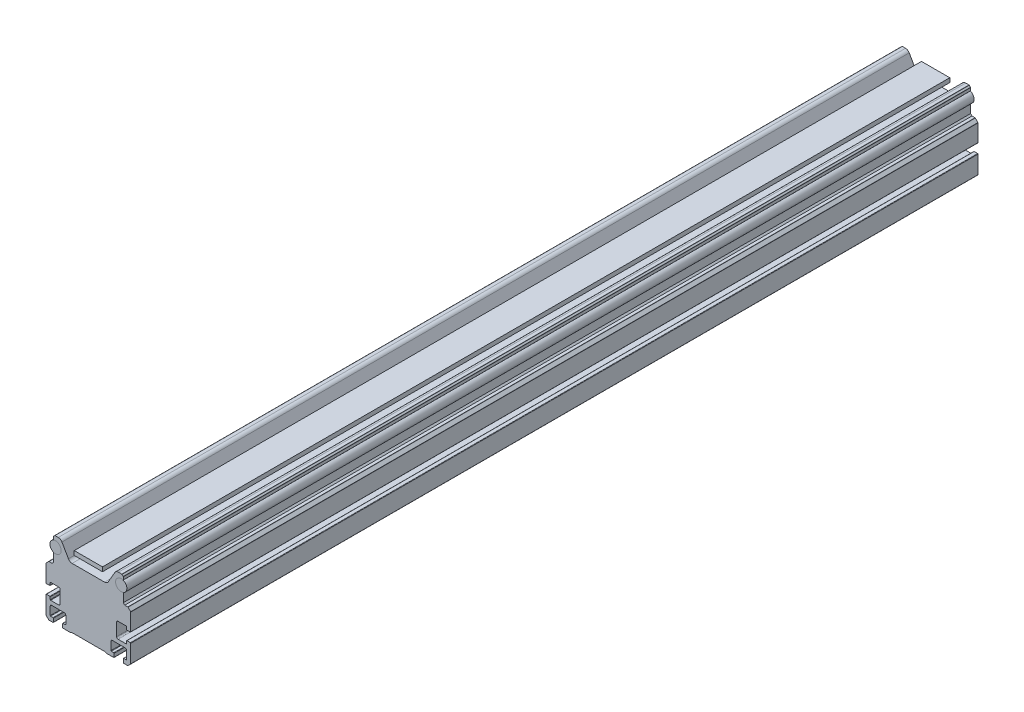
ISO-10303-21;
HEADER;
FILE_DESCRIPTION(('STEP AP214'),'2;1');
FILE_NAME('part.step','',(''),(''),'','','');
FILE_SCHEMA(('AUTOMOTIVE_DESIGN { 1 0 10303 214 1 1 1 1 }'));
ENDSEC;
DATA;
#1=APPLICATION_CONTEXT('core data for automotive mechanical design processes');
#2=APPLICATION_PROTOCOL_DEFINITION('international standard','automotive_design',2000,#1);
#3=PRODUCT_CONTEXT('',#1,'mechanical');
#4=PRODUCT('Part','Part','',(#3));
#5=PRODUCT_RELATED_PRODUCT_CATEGORY('part','',(#4));
#6=PRODUCT_DEFINITION_FORMATION('','',#4);
#7=PRODUCT_DEFINITION_CONTEXT('part definition',#1,'design');
#8=PRODUCT_DEFINITION('design','',#6,#7);
#9=PRODUCT_DEFINITION_SHAPE('','',#8);
#10=(LENGTH_UNIT() NAMED_UNIT(*) SI_UNIT(.MILLI.,.METRE.));
#11=(NAMED_UNIT(*) PLANE_ANGLE_UNIT() SI_UNIT($,.RADIAN.));
#12=(NAMED_UNIT(*) SI_UNIT($,.STERADIAN.) SOLID_ANGLE_UNIT());
#13=UNCERTAINTY_MEASURE_WITH_UNIT(LENGTH_MEASURE(1.E-05),#10,'distance_accuracy_value','');
#14=(GEOMETRIC_REPRESENTATION_CONTEXT(3) GLOBAL_UNCERTAINTY_ASSIGNED_CONTEXT((#13)) GLOBAL_UNIT_ASSIGNED_CONTEXT((#10,
#11,#12)) REPRESENTATION_CONTEXT('',''));
#15=CARTESIAN_POINT('',(0.,0.,0.));
#16=DIRECTION('',(0.,0.,1.));
#17=DIRECTION('',(1.,0.,0.));
#18=AXIS2_PLACEMENT_3D('',#15,#16,#17);
#19=CARTESIAN_POINT('',(168.9633642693,91.0814424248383,600.));
#20=DIRECTION('',(0.,0.,1.));
#21=DIRECTION('',(1.,0.,0.));
#22=AXIS2_PLACEMENT_3D('',#19,#20,#21);
#23=PLANE('',#22);
#24=CARTESIAN_POINT('',(133.837629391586,137.881443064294,600.));
#25=DIRECTION('',(0.,0.,1.));
#26=DIRECTION('',(1.,0.,0.));
#27=AXIS2_PLACEMENT_3D('',#24,#25,#26);
#28=CIRCLE('',#27,3.99999999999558);
#29=CARTESIAN_POINT('',(129.83762939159,137.881443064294,600.));
#30=VERTEX_POINT('',#29);
#31=EDGE_CURVE('E11',#30,#30,#28,.F.);
#32=ORIENTED_EDGE('',*,*,#31,.F.);
#33=EDGE_LOOP('',(#32));
#34=FACE_BOUND('',#33,.T.);
#35=ADVANCED_FACE('F41',(#34),#23,.T.);
#36=CARTESIAN_POINT('',(133.837629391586,137.881443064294,0.));
#37=DIRECTION('',(0.,0.,-1.));
#38=DIRECTION('',(-1.,0.,0.));
#39=AXIS2_PLACEMENT_3D('',#36,#37,#38);
#40=PLANE('',#39);
#41=CARTESIAN_POINT('',(133.837629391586,137.881443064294,0.));
#42=DIRECTION('',(0.,0.,-1.));
#43=DIRECTION('',(-1.,0.,0.));
#44=AXIS2_PLACEMENT_3D('',#41,#42,#43);
#45=CIRCLE('',#44,3.99999999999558);
#46=CARTESIAN_POINT('',(129.83762939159,137.881443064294,0.));
#47=VERTEX_POINT('',#46);
#48=EDGE_CURVE('E47',#47,#47,#45,.T.);
#49=ORIENTED_EDGE('',*,*,#48,.T.);
#50=EDGE_LOOP('',(#49));
#51=FACE_BOUND('',#50,.T.);
#52=ADVANCED_FACE('F53',(#51),#40,.T.);
#53=CARTESIAN_POINT('',(133.837629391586,137.881443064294,611.313708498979));
#54=DIRECTION('',(0.,0.,-1.));
#55=DIRECTION('',(-1.,0.,0.));
#56=AXIS2_PLACEMENT_3D('',#53,#54,#55);
#57=CYLINDRICAL_SURFACE('',#56,3.99999999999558);
#58=CARTESIAN_POINT('',(129.83762939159,137.881443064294,0.));
#59=CARTESIAN_POINT('',(129.83762939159,137.881443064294,6.25000000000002));
#60=CARTESIAN_POINT('',(129.83762939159,137.881443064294,12.5));
#61=CARTESIAN_POINT('',(129.83762939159,137.881443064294,25.));
#62=CARTESIAN_POINT('',(129.83762939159,137.881443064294,31.25));
#63=CARTESIAN_POINT('',(129.83762939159,137.881443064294,43.75));
#64=CARTESIAN_POINT('',(129.83762939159,137.881443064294,50.));
#65=CARTESIAN_POINT('',(129.83762939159,137.881443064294,62.5));
#66=CARTESIAN_POINT('',(129.83762939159,137.881443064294,68.75));
#67=CARTESIAN_POINT('',(129.83762939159,137.881443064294,81.25));
#68=CARTESIAN_POINT('',(129.83762939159,137.881443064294,87.5));
#69=CARTESIAN_POINT('',(129.83762939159,137.881443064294,100.));
#70=CARTESIAN_POINT('',(129.83762939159,137.881443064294,106.25));
#71=CARTESIAN_POINT('',(129.83762939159,137.881443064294,118.75));
#72=CARTESIAN_POINT('',(129.83762939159,137.881443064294,125.));
#73=CARTESIAN_POINT('',(129.83762939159,137.881443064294,137.5));
#74=CARTESIAN_POINT('',(129.83762939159,137.881443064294,143.75));
#75=CARTESIAN_POINT('',(129.83762939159,137.881443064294,156.25));
#76=CARTESIAN_POINT('',(129.83762939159,137.881443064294,162.5));
#77=CARTESIAN_POINT('',(129.83762939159,137.881443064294,175.));
#78=CARTESIAN_POINT('',(129.83762939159,137.881443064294,181.25));
#79=CARTESIAN_POINT('',(129.83762939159,137.881443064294,193.75));
#80=CARTESIAN_POINT('',(129.83762939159,137.881443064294,200.));
#81=CARTESIAN_POINT('',(129.83762939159,137.881443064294,212.5));
#82=CARTESIAN_POINT('',(129.83762939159,137.881443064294,218.75));
#83=CARTESIAN_POINT('',(129.83762939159,137.881443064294,231.25));
#84=CARTESIAN_POINT('',(129.83762939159,137.881443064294,237.5));
#85=CARTESIAN_POINT('',(129.83762939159,137.881443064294,250.));
#86=CARTESIAN_POINT('',(129.83762939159,137.881443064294,256.25));
#87=CARTESIAN_POINT('',(129.83762939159,137.881443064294,268.75));
#88=CARTESIAN_POINT('',(129.83762939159,137.881443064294,275.));
#89=CARTESIAN_POINT('',(129.83762939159,137.881443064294,287.5));
#90=CARTESIAN_POINT('',(129.83762939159,137.881443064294,293.75));
#91=CARTESIAN_POINT('',(129.83762939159,137.881443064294,306.25));
#92=CARTESIAN_POINT('',(129.83762939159,137.881443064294,312.5));
#93=CARTESIAN_POINT('',(129.83762939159,137.881443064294,325.));
#94=CARTESIAN_POINT('',(129.83762939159,137.881443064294,331.25));
#95=CARTESIAN_POINT('',(129.83762939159,137.881443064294,343.75));
#96=CARTESIAN_POINT('',(129.83762939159,137.881443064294,350.));
#97=CARTESIAN_POINT('',(129.83762939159,137.881443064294,362.5));
#98=CARTESIAN_POINT('',(129.83762939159,137.881443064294,368.75));
#99=CARTESIAN_POINT('',(129.83762939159,137.881443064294,381.25));
#100=CARTESIAN_POINT('',(129.83762939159,137.881443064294,387.5));
#101=CARTESIAN_POINT('',(129.83762939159,137.881443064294,400.));
#102=CARTESIAN_POINT('',(129.83762939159,137.881443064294,406.25));
#103=CARTESIAN_POINT('',(129.83762939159,137.881443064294,418.75));
#104=CARTESIAN_POINT('',(129.83762939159,137.881443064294,425.));
#105=CARTESIAN_POINT('',(129.83762939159,137.881443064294,437.5));
#106=CARTESIAN_POINT('',(129.83762939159,137.881443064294,443.75));
#107=CARTESIAN_POINT('',(129.83762939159,137.881443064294,456.25));
#108=CARTESIAN_POINT('',(129.83762939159,137.881443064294,462.5));
#109=CARTESIAN_POINT('',(129.83762939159,137.881443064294,475.));
#110=CARTESIAN_POINT('',(129.83762939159,137.881443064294,481.25));
#111=CARTESIAN_POINT('',(129.83762939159,137.881443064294,493.75));
#112=CARTESIAN_POINT('',(129.83762939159,137.881443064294,500.));
#113=CARTESIAN_POINT('',(129.83762939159,137.881443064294,512.5));
#114=CARTESIAN_POINT('',(129.83762939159,137.881443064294,518.75));
#115=CARTESIAN_POINT('',(129.83762939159,137.881443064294,531.25));
#116=CARTESIAN_POINT('',(129.83762939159,137.881443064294,537.5));
#117=CARTESIAN_POINT('',(129.83762939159,137.881443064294,550.));
#118=CARTESIAN_POINT('',(129.83762939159,137.881443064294,556.25));
#119=CARTESIAN_POINT('',(129.83762939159,137.881443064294,568.75));
#120=CARTESIAN_POINT('',(129.83762939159,137.881443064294,575.));
#121=CARTESIAN_POINT('',(129.83762939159,137.881443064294,587.5));
#122=CARTESIAN_POINT('',(129.83762939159,137.881443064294,593.75));
#123=CARTESIAN_POINT('',(129.83762939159,137.881443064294,600.));
#124=B_SPLINE_CURVE_WITH_KNOTS('',3,(#58,#59,#60,#61,#62,#63,#64,#65,#66,#67,#68,#69,#70,#71,
#72,#73,#74,#75,#76,#77,#78,#79,#80,#81,#82,#83,#84,#85,#86,#87,#88,#89,#90,#91,#92,#93,#94,#95,
#96,#97,#98,#99,#100,#101,#102,#103,#104,#105,#106,#107,#108,#109,#110,#111,#112,#113,#114,#115,
#116,#117,#118,#119,#120,#121,#122,#123),.UNSPECIFIED.,.F.,.F.,(4,2,2,2,2,2,2,2,2,2,2,2,2,2,2,2,
2,2,2,2,2,2,2,2,2,2,2,2,2,2,2,2,4),(0.,18.75,37.5,56.25,75.,93.75,112.5,131.25,150.,168.75,
187.5,206.25,225.,243.75,262.5,281.25,300.,318.75,337.5,356.25,375.,393.75,412.5,431.25,450.,
468.75,487.5,506.25,525.,543.75,562.5,581.25,600.),.UNSPECIFIED.);
#125=EDGE_CURVE('BSEAM55',#47,#30,#124,.T.);
#126=ORIENTED_EDGE('',*,*,#48,.F.);
#127=ORIENTED_EDGE('',*,*,#31,.T.);
#128=ORIENTED_EDGE('',*,*,#125,.T.);
#129=ORIENTED_EDGE('',*,*,#125,.F.);
#130=EDGE_LOOP('',(#126,#128,#127,#129));
#131=FACE_BOUND('',#130,.T.);
#132=ADVANCED_FACE('F55',(#131),#57,.T.);
#133=CLOSED_SHELL('',(#35,#52,#132));
#134=MANIFOLD_SOLID_BREP('B2',#133);
#135=CARTESIAN_POINT('',(168.9633642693,91.0814424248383,600.));
#136=DIRECTION('',(0.,0.,1.));
#137=DIRECTION('',(1.,0.,0.));
#138=AXIS2_PLACEMENT_3D('',#135,#136,#137);
#139=PLANE('',#138);
#140=CARTESIAN_POINT('',(180.337629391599,137.881443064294,600.));
#141=DIRECTION('',(0.,0.,1.));
#142=DIRECTION('',(1.,0.,0.));
#143=AXIS2_PLACEMENT_3D('',#140,#141,#142);
#144=CIRCLE('',#143,3.99999999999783);
#145=CARTESIAN_POINT('',(176.337629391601,137.881443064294,600.));
#146=VERTEX_POINT('',#145);
#147=EDGE_CURVE('E40',#146,#146,#144,.F.);
#148=ORIENTED_EDGE('',*,*,#147,.F.);
#149=EDGE_LOOP('',(#148));
#150=FACE_BOUND('',#149,.T.);
#151=ADVANCED_FACE('F91',(#150),#139,.T.);
#152=CARTESIAN_POINT('',(180.337629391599,137.881443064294,0.));
#153=DIRECTION('',(0.,0.,-1.));
#154=DIRECTION('',(-1.,0.,0.));
#155=AXIS2_PLACEMENT_3D('',#152,#153,#154);
#156=PLANE('',#155);
#157=CARTESIAN_POINT('',(180.337629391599,137.881443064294,0.));
#158=DIRECTION('',(0.,0.,-1.));
#159=DIRECTION('',(-1.,0.,0.));
#160=AXIS2_PLACEMENT_3D('',#157,#158,#159);
#161=CIRCLE('',#160,3.99999999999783);
#162=CARTESIAN_POINT('',(176.337629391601,137.881443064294,0.));
#163=VERTEX_POINT('',#162);
#164=EDGE_CURVE('E97',#163,#163,#161,.T.);
#165=ORIENTED_EDGE('',*,*,#164,.T.);
#166=EDGE_LOOP('',(#165));
#167=FACE_BOUND('',#166,.T.);
#168=ADVANCED_FACE('F103',(#167),#156,.T.);
#169=CARTESIAN_POINT('',(180.337629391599,137.881443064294,611.313708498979));
#170=DIRECTION('',(0.,0.,-1.));
#171=DIRECTION('',(-1.,0.,0.));
#172=AXIS2_PLACEMENT_3D('',#169,#170,#171);
#173=CYLINDRICAL_SURFACE('',#172,3.99999999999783);
#174=CARTESIAN_POINT('',(176.337629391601,137.881443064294,0.));
#175=CARTESIAN_POINT('',(176.337629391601,137.881443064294,6.25000000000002));
#176=CARTESIAN_POINT('',(176.337629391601,137.881443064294,12.5));
#177=CARTESIAN_POINT('',(176.337629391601,137.881443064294,25.));
#178=CARTESIAN_POINT('',(176.337629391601,137.881443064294,31.25));
#179=CARTESIAN_POINT('',(176.337629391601,137.881443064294,43.75));
#180=CARTESIAN_POINT('',(176.337629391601,137.881443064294,50.));
#181=CARTESIAN_POINT('',(176.337629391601,137.881443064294,62.5));
#182=CARTESIAN_POINT('',(176.337629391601,137.881443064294,68.75));
#183=CARTESIAN_POINT('',(176.337629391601,137.881443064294,81.25));
#184=CARTESIAN_POINT('',(176.337629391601,137.881443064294,87.5));
#185=CARTESIAN_POINT('',(176.337629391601,137.881443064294,100.));
#186=CARTESIAN_POINT('',(176.337629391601,137.881443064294,106.25));
#187=CARTESIAN_POINT('',(176.337629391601,137.881443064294,118.75));
#188=CARTESIAN_POINT('',(176.337629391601,137.881443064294,125.));
#189=CARTESIAN_POINT('',(176.337629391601,137.881443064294,137.5));
#190=CARTESIAN_POINT('',(176.337629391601,137.881443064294,143.75));
#191=CARTESIAN_POINT('',(176.337629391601,137.881443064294,156.25));
#192=CARTESIAN_POINT('',(176.337629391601,137.881443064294,162.5));
#193=CARTESIAN_POINT('',(176.337629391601,137.881443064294,175.));
#194=CARTESIAN_POINT('',(176.337629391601,137.881443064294,181.25));
#195=CARTESIAN_POINT('',(176.337629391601,137.881443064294,193.75));
#196=CARTESIAN_POINT('',(176.337629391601,137.881443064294,200.));
#197=CARTESIAN_POINT('',(176.337629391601,137.881443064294,212.5));
#198=CARTESIAN_POINT('',(176.337629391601,137.881443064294,218.75));
#199=CARTESIAN_POINT('',(176.337629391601,137.881443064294,231.25));
#200=CARTESIAN_POINT('',(176.337629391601,137.881443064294,237.5));
#201=CARTESIAN_POINT('',(176.337629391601,137.881443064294,250.));
#202=CARTESIAN_POINT('',(176.337629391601,137.881443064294,256.25));
#203=CARTESIAN_POINT('',(176.337629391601,137.881443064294,268.75));
#204=CARTESIAN_POINT('',(176.337629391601,137.881443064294,275.));
#205=CARTESIAN_POINT('',(176.337629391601,137.881443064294,287.5));
#206=CARTESIAN_POINT('',(176.337629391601,137.881443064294,293.75));
#207=CARTESIAN_POINT('',(176.337629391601,137.881443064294,306.25));
#208=CARTESIAN_POINT('',(176.337629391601,137.881443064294,312.5));
#209=CARTESIAN_POINT('',(176.337629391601,137.881443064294,325.));
#210=CARTESIAN_POINT('',(176.337629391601,137.881443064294,331.25));
#211=CARTESIAN_POINT('',(176.337629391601,137.881443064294,343.75));
#212=CARTESIAN_POINT('',(176.337629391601,137.881443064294,350.));
#213=CARTESIAN_POINT('',(176.337629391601,137.881443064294,362.5));
#214=CARTESIAN_POINT('',(176.337629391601,137.881443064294,368.75));
#215=CARTESIAN_POINT('',(176.337629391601,137.881443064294,381.25));
#216=CARTESIAN_POINT('',(176.337629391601,137.881443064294,387.5));
#217=CARTESIAN_POINT('',(176.337629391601,137.881443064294,400.));
#218=CARTESIAN_POINT('',(176.337629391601,137.881443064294,406.25));
#219=CARTESIAN_POINT('',(176.337629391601,137.881443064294,418.75));
#220=CARTESIAN_POINT('',(176.337629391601,137.881443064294,425.));
#221=CARTESIAN_POINT('',(176.337629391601,137.881443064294,437.5));
#222=CARTESIAN_POINT('',(176.337629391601,137.881443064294,443.75));
#223=CARTESIAN_POINT('',(176.337629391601,137.881443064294,456.25));
#224=CARTESIAN_POINT('',(176.337629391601,137.881443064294,462.5));
#225=CARTESIAN_POINT('',(176.337629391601,137.881443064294,475.));
#226=CARTESIAN_POINT('',(176.337629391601,137.881443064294,481.25));
#227=CARTESIAN_POINT('',(176.337629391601,137.881443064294,493.75));
#228=CARTESIAN_POINT('',(176.337629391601,137.881443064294,500.));
#229=CARTESIAN_POINT('',(176.337629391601,137.881443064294,512.5));
#230=CARTESIAN_POINT('',(176.337629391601,137.881443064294,518.75));
#231=CARTESIAN_POINT('',(176.337629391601,137.881443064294,531.25));
#232=CARTESIAN_POINT('',(176.337629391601,137.881443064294,537.5));
#233=CARTESIAN_POINT('',(176.337629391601,137.881443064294,550.));
#234=CARTESIAN_POINT('',(176.337629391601,137.881443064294,556.25));
#235=CARTESIAN_POINT('',(176.337629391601,137.881443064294,568.75));
#236=CARTESIAN_POINT('',(176.337629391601,137.881443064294,575.));
#237=CARTESIAN_POINT('',(176.337629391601,137.881443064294,587.5));
#238=CARTESIAN_POINT('',(176.337629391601,137.881443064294,593.75));
#239=CARTESIAN_POINT('',(176.337629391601,137.881443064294,600.));
#240=B_SPLINE_CURVE_WITH_KNOTS('',3,(#174,#175,#176,#177,#178,#179,#180,#181,#182,#183,#184,
#185,#186,#187,#188,#189,#190,#191,#192,#193,#194,#195,#196,#197,#198,#199,#200,#201,#202,#203,
#204,#205,#206,#207,#208,#209,#210,#211,#212,#213,#214,#215,#216,#217,#218,#219,#220,#221,#222,
#223,#224,#225,#226,#227,#228,#229,#230,#231,#232,#233,#234,#235,#236,#237,#238,#239),
.UNSPECIFIED.,.F.,.F.,(4,2,2,2,2,2,2,2,2,2,2,2,2,2,2,2,2,2,2,2,2,2,2,2,2,2,2,2,2,2,2,2,4),(0.,
18.75,37.5,56.25,75.,93.75,112.5,131.25,150.,168.75,187.5,206.25,225.,243.75,262.5,281.25,300.,
318.75,337.5,356.25,375.,393.75,412.5,431.25,450.,468.75,487.5,506.25,525.,543.75,562.5,581.25,
600.),.UNSPECIFIED.);
#241=EDGE_CURVE('BSEAM105',#163,#146,#240,.T.);
#242=ORIENTED_EDGE('',*,*,#164,.F.);
#243=ORIENTED_EDGE('',*,*,#147,.T.);
#244=ORIENTED_EDGE('',*,*,#241,.T.);
#245=ORIENTED_EDGE('',*,*,#241,.F.);
#246=EDGE_LOOP('',(#242,#244,#243,#245));
#247=FACE_BOUND('',#246,.T.);
#248=ADVANCED_FACE('F105',(#247),#173,.T.);
#249=CLOSED_SHELL('',(#151,#168,#248));
#250=MANIFOLD_SOLID_BREP('B6',#249);
#251=CARTESIAN_POINT('',(167.0876287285,139.4914445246,600.));
#252=DIRECTION('',(0.,1.,0.));
#253=DIRECTION('',(0.,0.,1.));
#254=AXIS2_PLACEMENT_3D('',#251,#252,#253);
#255=PLANE('',#254);
#256=DIRECTION('',(1.,0.,0.));
#257=VECTOR('',#256,1.);
#258=CARTESIAN_POINT('',(167.0876287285,139.4914445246,0.));
#259=LINE('',#258,#257);
#260=CARTESIAN_POINT('',(147.0876287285,139.4914445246,0.));
#261=VERTEX_POINT('',#260);
#262=CARTESIAN_POINT('',(167.0876287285,139.4914445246,0.));
#263=VERTEX_POINT('',#262);
#264=EDGE_CURVE('E203',#261,#263,#259,.T.);
#265=ORIENTED_EDGE('',*,*,#264,.T.);
#266=DIRECTION('',(0.,0.,-1.));
#267=VECTOR('',#266,1.);
#268=CARTESIAN_POINT('',(167.0876287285,139.4914445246,600.));
#269=LINE('',#268,#267);
#270=CARTESIAN_POINT('',(167.0876287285,139.4914445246,600.));
#271=VERTEX_POINT('',#270);
#272=EDGE_CURVE('E89',#271,#263,#269,.T.);
#273=ORIENTED_EDGE('',*,*,#272,.F.);
#274=DIRECTION('',(1.,0.,0.));
#275=VECTOR('',#274,1.);
#276=CARTESIAN_POINT('',(167.0876287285,139.4914445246,600.));
#277=LINE('',#276,#275);
#278=CARTESIAN_POINT('',(147.0876287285,139.4914445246,600.));
#279=VERTEX_POINT('',#278);
#280=EDGE_CURVE('E191',#279,#271,#277,.T.);
#281=ORIENTED_EDGE('',*,*,#280,.F.);
#282=DIRECTION('',(0.,0.,-1.));
#283=VECTOR('',#282,1.);
#284=CARTESIAN_POINT('',(147.0876287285,139.4914445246,600.));
#285=LINE('',#284,#283);
#286=EDGE_CURVE('E199',#279,#261,#285,.T.);
#287=ORIENTED_EDGE('',*,*,#286,.T.);
#288=EDGE_LOOP('',(#265,#273,#281,#287));
#289=FACE_BOUND('',#288,.T.);
#290=ADVANCED_FACE('F140',(#289),#255,.F.);
#291=CARTESIAN_POINT('',(167.0876287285,139.4914445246,600.));
#292=DIRECTION('',(-1.,0.,0.));
#293=DIRECTION('',(0.,0.,1.));
#294=AXIS2_PLACEMENT_3D('',#291,#292,#293);
#295=PLANE('',#294);
#296=DIRECTION('',(0.,1.,0.));
#297=VECTOR('',#296,1.);
#298=CARTESIAN_POINT('',(167.0876287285,139.4914445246,0.));
#299=LINE('',#298,#297);
#300=CARTESIAN_POINT('',(167.0876287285,142.4914445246,0.));
#301=VERTEX_POINT('',#300);
#302=EDGE_CURVE('E195',#263,#301,#299,.T.);
#303=ORIENTED_EDGE('',*,*,#302,.T.);
#304=DIRECTION('',(0.,0.,-1.));
#305=VECTOR('',#304,1.);
#306=CARTESIAN_POINT('',(167.0876287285,142.4914445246,600.));
#307=LINE('',#306,#305);
#308=CARTESIAN_POINT('',(167.0876287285,142.4914445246,600.));
#309=VERTEX_POINT('',#308);
#310=EDGE_CURVE('E148',#309,#301,#307,.T.);
#311=ORIENTED_EDGE('',*,*,#310,.F.);
#312=DIRECTION('',(0.,1.,0.));
#313=VECTOR('',#312,1.);
#314=CARTESIAN_POINT('',(167.0876287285,139.4914445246,600.));
#315=LINE('',#314,#313);
#316=EDGE_CURVE('E186',#271,#309,#315,.T.);
#317=ORIENTED_EDGE('',*,*,#316,.F.);
#318=ORIENTED_EDGE('',*,*,#272,.T.);
#319=EDGE_LOOP('',(#303,#311,#317,#318));
#320=FACE_BOUND('',#319,.T.);
#321=ADVANCED_FACE('F194',(#320),#295,.F.);
#322=CARTESIAN_POINT('',(167.0876287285,142.4914445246,600.));
#323=DIRECTION('',(0.,-1.,0.));
#324=DIRECTION('',(0.,0.,-1.));
#325=AXIS2_PLACEMENT_3D('',#322,#323,#324);
#326=PLANE('',#325);
#327=DIRECTION('',(-1.,0.,0.));
#328=VECTOR('',#327,1.);
#329=CARTESIAN_POINT('',(167.0876287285,142.4914445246,0.));
#330=LINE('',#329,#328);
#331=CARTESIAN_POINT('',(147.0876287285,142.4914445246,0.));
#332=VERTEX_POINT('',#331);
#333=EDGE_CURVE('E173',#301,#332,#330,.T.);
#334=ORIENTED_EDGE('',*,*,#333,.T.);
#335=DIRECTION('',(0.,0.,-1.));
#336=VECTOR('',#335,1.);
#337=CARTESIAN_POINT('',(147.0876287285,142.4914445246,600.));
#338=LINE('',#337,#336);
#339=CARTESIAN_POINT('',(147.0876287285,142.4914445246,600.));
#340=VERTEX_POINT('',#339);
#341=EDGE_CURVE('E196',#340,#332,#338,.T.);
#342=ORIENTED_EDGE('',*,*,#341,.F.);
#343=DIRECTION('',(-1.,0.,0.));
#344=VECTOR('',#343,1.);
#345=CARTESIAN_POINT('',(167.0876287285,142.4914445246,600.));
#346=LINE('',#345,#344);
#347=EDGE_CURVE('E189',#309,#340,#346,.T.);
#348=ORIENTED_EDGE('',*,*,#347,.F.);
#349=ORIENTED_EDGE('',*,*,#310,.T.);
#350=EDGE_LOOP('',(#334,#342,#348,#349));
#351=FACE_BOUND('',#350,.T.);
#352=ADVANCED_FACE('F197',(#351),#326,.F.);
#353=CARTESIAN_POINT('',(147.0876287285,139.4914445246,600.));
#354=DIRECTION('',(1.,0.,0.));
#355=DIRECTION('',(0.,0.,-1.));
#356=AXIS2_PLACEMENT_3D('',#353,#354,#355);
#357=PLANE('',#356);
#358=DIRECTION('',(0.,-1.,0.));
#359=VECTOR('',#358,1.);
#360=CARTESIAN_POINT('',(147.0876287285,139.4914445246,0.));
#361=LINE('',#360,#359);
#362=EDGE_CURVE('E179',#332,#261,#361,.T.);
#363=ORIENTED_EDGE('',*,*,#362,.T.);
#364=ORIENTED_EDGE('',*,*,#286,.F.);
#365=DIRECTION('',(0.,-1.,0.));
#366=VECTOR('',#365,1.);
#367=CARTESIAN_POINT('',(147.0876287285,139.4914445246,600.));
#368=LINE('',#367,#366);
#369=EDGE_CURVE('E156',#340,#279,#368,.T.);
#370=ORIENTED_EDGE('',*,*,#369,.F.);
#371=ORIENTED_EDGE('',*,*,#341,.T.);
#372=EDGE_LOOP('',(#363,#364,#370,#371));
#373=FACE_BOUND('',#372,.T.);
#374=ADVANCED_FACE('F210',(#373),#357,.F.);
#375=CARTESIAN_POINT('',(0.,0.,600.));
#376=DIRECTION('',(0.,0.,-1.));
#377=DIRECTION('',(-1.,0.,0.));
#378=AXIS2_PLACEMENT_3D('',#375,#376,#377);
#379=PLANE('',#378);
#380=ORIENTED_EDGE('',*,*,#280,.T.);
#381=ORIENTED_EDGE('',*,*,#316,.T.);
#382=ORIENTED_EDGE('',*,*,#347,.T.);
#383=ORIENTED_EDGE('',*,*,#369,.T.);
#384=EDGE_LOOP('',(#380,#381,#382,#383));
#385=FACE_BOUND('',#384,.T.);
#386=ADVANCED_FACE('F187',(#385),#379,.F.);
#387=CARTESIAN_POINT('',(0.,0.,0.));
#388=DIRECTION('',(0.,0.,-1.));
#389=DIRECTION('',(-1.,0.,0.));
#390=AXIS2_PLACEMENT_3D('',#387,#388,#389);
#391=PLANE('',#390);
#392=ORIENTED_EDGE('',*,*,#264,.F.);
#393=ORIENTED_EDGE('',*,*,#362,.F.);
#394=ORIENTED_EDGE('',*,*,#333,.F.);
#395=ORIENTED_EDGE('',*,*,#302,.F.);
#396=EDGE_LOOP('',(#392,#393,#394,#395));
#397=FACE_BOUND('',#396,.T.);
#398=ADVANCED_FACE('F213',(#397),#391,.T.);
#399=CLOSED_SHELL('',(#290,#321,#352,#374,#386,#398));
#400=MANIFOLD_SOLID_BREP('B35',#399);
#401=CARTESIAN_POINT('',(168.9633642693,91.0814424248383,600.));
#402=DIRECTION('',(0.,0.,-1.));
#403=DIRECTION('',(-1.,0.,0.));
#404=AXIS2_PLACEMENT_3D('',#401,#402,#403);
#405=CYLINDRICAL_SURFACE('',#404,0.300000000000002);
#406=CARTESIAN_POINT('',(168.9633642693,91.0814424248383,0.));
#407=DIRECTION('',(0.,0.,-1.));
#408=DIRECTION('',(1.,0.,0.));
#409=AXIS2_PLACEMENT_3D('',#406,#407,#408);
#410=CIRCLE('',#409,0.300000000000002);
#411=CARTESIAN_POINT('',(168.9633642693,91.3814424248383,0.));
#412=VERTEX_POINT('',#411);
#413=CARTESIAN_POINT('',(169.175496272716,91.2935744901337,0.));
#414=VERTEX_POINT('',#413);
#415=EDGE_CURVE('E994',#412,#414,#410,.T.);
#416=ORIENTED_EDGE('',*,*,#415,.T.);
#417=DIRECTION('',(0.,0.,-1.));
#418=VECTOR('',#417,1.);
#419=CARTESIAN_POINT('',(169.175496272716,91.2935744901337,600.));
#420=LINE('',#419,#418);
#421=CARTESIAN_POINT('',(169.175496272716,91.2935744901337,600.));
#422=VERTEX_POINT('',#421);
#423=EDGE_CURVE('E1558',#422,#414,#420,.T.);
#424=ORIENTED_EDGE('',*,*,#423,.F.);
#425=CARTESIAN_POINT('',(168.9633642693,91.0814424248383,600.));
#426=DIRECTION('',(0.,0.,-1.));
#427=DIRECTION('',(1.,0.,0.));
#428=AXIS2_PLACEMENT_3D('',#425,#426,#427);
#429=CIRCLE('',#428,0.300000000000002);
#430=CARTESIAN_POINT('',(168.9633642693,91.3814424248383,600.));
#431=VERTEX_POINT('',#430);
#432=EDGE_CURVE('E1223',#431,#422,#429,.T.);
#433=ORIENTED_EDGE('',*,*,#432,.F.);
#434=DIRECTION('',(0.,0.,-1.));
#435=VECTOR('',#434,1.);
#436=CARTESIAN_POINT('',(168.9633642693,91.3814424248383,600.));
#437=LINE('',#436,#435);
#438=EDGE_CURVE('E990',#431,#412,#437,.T.);
#439=ORIENTED_EDGE('',*,*,#438,.T.);
#440=EDGE_LOOP('',(#416,#424,#433,#439));
#441=FACE_BOUND('',#440,.T.);
#442=ADVANCED_FACE('F263',(#441),#405,.F.);
#443=CARTESIAN_POINT('',(169.175496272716,91.2935744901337,600.));
#444=DIRECTION('',(0.707106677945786,0.707106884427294,0.));
#445=DIRECTION('',(-0.707106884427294,0.707106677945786,0.));
#446=AXIS2_PLACEMENT_3D('',#443,#444,#445);
#447=PLANE('',#446);
#448=DIRECTION('',(0.707106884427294,-0.707106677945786,0.));
#449=VECTOR('',#448,1.);
#450=CARTESIAN_POINT('',(169.175496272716,91.2935744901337,0.));
#451=LINE('',#450,#449);
#452=CARTESIAN_POINT('',(169.4997605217,90.9693103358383,0.));
#453=VERTEX_POINT('',#452);
#454=EDGE_CURVE('E997',#414,#453,#451,.T.);
#455=ORIENTED_EDGE('',*,*,#454,.T.);
#456=DIRECTION('',(0.,0.,-1.));
#457=VECTOR('',#456,1.);
#458=CARTESIAN_POINT('',(169.4997605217,90.9693103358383,600.));
#459=LINE('',#458,#457);
#460=CARTESIAN_POINT('',(169.4997605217,90.9693103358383,600.));
#461=VERTEX_POINT('',#460);
#462=EDGE_CURVE('E1555',#461,#453,#459,.T.);
#463=ORIENTED_EDGE('',*,*,#462,.F.);
#464=DIRECTION('',(0.707106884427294,-0.707106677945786,0.));
#465=VECTOR('',#464,1.);
#466=CARTESIAN_POINT('',(169.175496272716,91.2935744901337,600.));
#467=LINE('',#466,#465);
#468=EDGE_CURVE('E642',#422,#461,#467,.T.);
#469=ORIENTED_EDGE('',*,*,#468,.F.);
#470=ORIENTED_EDGE('',*,*,#423,.T.);
#471=EDGE_LOOP('',(#455,#463,#469,#470));
#472=FACE_BOUND('',#471,.T.);
#473=ADVANCED_FACE('F1926',(#472),#447,.F.);
#474=CARTESIAN_POINT('',(169.711892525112,91.1814424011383,600.));
#475=DIRECTION('',(0.,0.,-1.));
#476=DIRECTION('',(-1.,0.,0.));
#477=AXIS2_PLACEMENT_3D('',#474,#475,#476);
#478=CYLINDRICAL_SURFACE('',#477,0.300000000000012);
#479=CARTESIAN_POINT('',(169.711892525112,91.1814424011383,0.));
#480=DIRECTION('',(0.,0.,1.));
#481=DIRECTION('',(1.,0.,0.));
#482=AXIS2_PLACEMENT_3D('',#479,#480,#481);
#483=CIRCLE('',#482,0.300000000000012);
#484=CARTESIAN_POINT('',(169.7118925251,90.8814424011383,0.));
#485=VERTEX_POINT('',#484);
#486=EDGE_CURVE('E1000',#453,#485,#483,.T.);
#487=ORIENTED_EDGE('',*,*,#486,.T.);
#488=DIRECTION('',(0.,0.,-1.));
#489=VECTOR('',#488,1.);
#490=CARTESIAN_POINT('',(169.7118925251,90.8814424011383,600.));
#491=LINE('',#490,#489);
#492=CARTESIAN_POINT('',(169.7118925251,90.8814424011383,600.));
#493=VERTEX_POINT('',#492);
#494=EDGE_CURVE('E1552',#493,#485,#491,.T.);
#495=ORIENTED_EDGE('',*,*,#494,.F.);
#496=CARTESIAN_POINT('',(169.711892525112,91.1814424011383,600.));
#497=DIRECTION('',(0.,0.,1.));
#498=DIRECTION('',(1.,0.,0.));
#499=AXIS2_PLACEMENT_3D('',#496,#497,#498);
#500=CIRCLE('',#499,0.300000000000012);
#501=EDGE_CURVE('E1705',#461,#493,#500,.T.);
#502=ORIENTED_EDGE('',*,*,#501,.F.);
#503=ORIENTED_EDGE('',*,*,#462,.T.);
#504=EDGE_LOOP('',(#487,#495,#502,#503));
#505=FACE_BOUND('',#504,.T.);
#506=ADVANCED_FACE('F1930',(#505),#478,.T.);
#507=CARTESIAN_POINT('',(169.7118925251,90.8814424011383,600.));
#508=DIRECTION('',(0.,1.,0.));
#509=DIRECTION('',(0.,0.,1.));
#510=AXIS2_PLACEMENT_3D('',#507,#508,#509);
#511=PLANE('',#510);
#512=DIRECTION('',(1.,0.,0.));
#513=VECTOR('',#512,1.);
#514=CARTESIAN_POINT('',(169.7118925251,90.8814424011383,0.));
#515=LINE('',#514,#513);
#516=CARTESIAN_POINT('',(175.0376284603,90.8814424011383,0.));
#517=VERTEX_POINT('',#516);
#518=EDGE_CURVE('E1002',#485,#517,#515,.T.);
#519=ORIENTED_EDGE('',*,*,#518,.T.);
#520=DIRECTION('',(0.,0.,-1.));
#521=VECTOR('',#520,1.);
#522=CARTESIAN_POINT('',(175.0376284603,90.8814424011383,600.));
#523=LINE('',#522,#521);
#524=CARTESIAN_POINT('',(175.0376284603,90.8814424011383,600.));
#525=VERTEX_POINT('',#524);
#526=EDGE_CURVE('E1549',#525,#517,#523,.T.);
#527=ORIENTED_EDGE('',*,*,#526,.F.);
#528=DIRECTION('',(1.,0.,0.));
#529=VECTOR('',#528,1.);
#530=CARTESIAN_POINT('',(169.7118925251,90.8814424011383,600.));
#531=LINE('',#530,#529);
#532=EDGE_CURVE('E1707',#493,#525,#531,.T.);
#533=ORIENTED_EDGE('',*,*,#532,.F.);
#534=ORIENTED_EDGE('',*,*,#494,.T.);
#535=EDGE_LOOP('',(#519,#527,#533,#534));
#536=FACE_BOUND('',#535,.T.);
#537=ADVANCED_FACE('F1934',(#536),#511,.F.);
#538=CARTESIAN_POINT('',(175.0376284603,91.1814424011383,600.));
#539=DIRECTION('',(0.,0.,-1.));
#540=DIRECTION('',(-1.,0.,0.));
#541=AXIS2_PLACEMENT_3D('',#538,#539,#540);
#542=CYLINDRICAL_SURFACE('',#541,0.299999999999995);
#543=CARTESIAN_POINT('',(175.0376284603,91.1814424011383,0.));
#544=DIRECTION('',(0.,0.,1.));
#545=DIRECTION('',(1.,0.,0.));
#546=AXIS2_PLACEMENT_3D('',#543,#544,#545);
#547=CIRCLE('',#546,0.299999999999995);
#548=CARTESIAN_POINT('',(175.3376284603,91.1814424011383,0.));
#549=VERTEX_POINT('',#548);
#550=EDGE_CURVE('E1004',#517,#549,#547,.T.);
#551=ORIENTED_EDGE('',*,*,#550,.T.);
#552=DIRECTION('',(0.,0.,-1.));
#553=VECTOR('',#552,1.);
#554=CARTESIAN_POINT('',(175.3376284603,91.1814424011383,600.));
#555=LINE('',#554,#553);
#556=CARTESIAN_POINT('',(175.3376284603,91.1814424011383,600.));
#557=VERTEX_POINT('',#556);
#558=EDGE_CURVE('E1546',#557,#549,#555,.T.);
#559=ORIENTED_EDGE('',*,*,#558,.F.);
#560=CARTESIAN_POINT('',(175.0376284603,91.1814424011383,600.));
#561=DIRECTION('',(0.,0.,1.));
#562=DIRECTION('',(1.,0.,0.));
#563=AXIS2_PLACEMENT_3D('',#560,#561,#562);
#564=CIRCLE('',#563,0.299999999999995);
#565=EDGE_CURVE('E1709',#525,#557,#564,.T.);
#566=ORIENTED_EDGE('',*,*,#565,.F.);
#567=ORIENTED_EDGE('',*,*,#526,.T.);
#568=EDGE_LOOP('',(#551,#559,#566,#567));
#569=FACE_BOUND('',#568,.T.);
#570=ADVANCED_FACE('F1940',(#569),#542,.T.);
#571=CARTESIAN_POINT('',(175.3376284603,91.1814424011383,600.));
#572=DIRECTION('',(-1.,0.,0.));
#573=DIRECTION('',(0.,0.,1.));
#574=AXIS2_PLACEMENT_3D('',#571,#572,#573);
#575=PLANE('',#574);
#576=DIRECTION('',(0.,1.,0.));
#577=VECTOR('',#576,1.);
#578=CARTESIAN_POINT('',(175.3376284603,91.1814424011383,0.));
#579=LINE('',#578,#577);
#580=CARTESIAN_POINT('',(175.3376284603,93.5814427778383,0.));
#581=VERTEX_POINT('',#580);
#582=EDGE_CURVE('E1006',#549,#581,#579,.T.);
#583=ORIENTED_EDGE('',*,*,#582,.T.);
#584=DIRECTION('',(0.,0.,-1.));
#585=VECTOR('',#584,1.);
#586=CARTESIAN_POINT('',(175.3376284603,93.5814427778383,600.));
#587=LINE('',#586,#585);
#588=CARTESIAN_POINT('',(175.3376284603,93.5814427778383,600.));
#589=VERTEX_POINT('',#588);
#590=EDGE_CURVE('E1543',#589,#581,#587,.T.);
#591=ORIENTED_EDGE('',*,*,#590,.F.);
#592=DIRECTION('',(0.,1.,0.));
#593=VECTOR('',#592,1.);
#594=CARTESIAN_POINT('',(175.3376284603,91.1814424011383,600.));
#595=LINE('',#594,#593);
#596=EDGE_CURVE('E1711',#557,#589,#595,.T.);
#597=ORIENTED_EDGE('',*,*,#596,.F.);
#598=ORIENTED_EDGE('',*,*,#558,.T.);
#599=EDGE_LOOP('',(#583,#591,#597,#598));
#600=FACE_BOUND('',#599,.T.);
#601=ADVANCED_FACE('F1944',(#600),#575,.F.);
#602=CARTESIAN_POINT('',(175.0376284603,93.5814431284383,600.));
#603=DIRECTION('',(0.,0.,-1.));
#604=DIRECTION('',(-1.,0.,0.));
#605=AXIS2_PLACEMENT_3D('',#602,#603,#604);
#606=CYLINDRICAL_SURFACE('',#605,0.29999999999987);
#607=CARTESIAN_POINT('',(175.0376284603,93.5814431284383,0.));
#608=DIRECTION('',(0.,0.,1.));
#609=DIRECTION('',(1.,0.,0.));
#610=AXIS2_PLACEMENT_3D('',#607,#608,#609);
#611=CIRCLE('',#610,0.29999999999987);
#612=CARTESIAN_POINT('',(175.037628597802,93.8814431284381,0.));
#613=VERTEX_POINT('',#612);
#614=EDGE_CURVE('E1008',#581,#613,#611,.T.);
#615=ORIENTED_EDGE('',*,*,#614,.T.);
#616=DIRECTION('',(0.,0.,-1.));
#617=VECTOR('',#616,1.);
#618=CARTESIAN_POINT('',(175.037628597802,93.8814431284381,600.));
#619=LINE('',#618,#617);
#620=CARTESIAN_POINT('',(175.037628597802,93.8814431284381,600.));
#621=VERTEX_POINT('',#620);
#622=EDGE_CURVE('E1540',#621,#613,#619,.T.);
#623=ORIENTED_EDGE('',*,*,#622,.F.);
#624=CARTESIAN_POINT('',(175.0376284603,93.5814431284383,600.));
#625=DIRECTION('',(0.,0.,1.));
#626=DIRECTION('',(1.,0.,0.));
#627=AXIS2_PLACEMENT_3D('',#624,#625,#626);
#628=CIRCLE('',#627,0.29999999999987);
#629=EDGE_CURVE('E1713',#589,#621,#628,.T.);
#630=ORIENTED_EDGE('',*,*,#629,.F.);
#631=ORIENTED_EDGE('',*,*,#590,.T.);
#632=EDGE_LOOP('',(#615,#623,#630,#631));
#633=FACE_BOUND('',#632,.T.);
#634=ADVANCED_FACE('F1948',(#633),#606,.T.);
#635=CARTESIAN_POINT('',(175.037628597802,93.8814431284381,600.));
#636=DIRECTION('',(0.,-1.,0.));
#637=DIRECTION('',(0.,0.,-1.));
#638=AXIS2_PLACEMENT_3D('',#635,#636,#637);
#639=PLANE('',#638);
#640=DIRECTION('',(-1.,0.,0.));
#641=VECTOR('',#640,1.);
#642=CARTESIAN_POINT('',(175.037628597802,93.8814431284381,0.));
#643=LINE('',#642,#641);
#644=CARTESIAN_POINT('',(173.3876297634,93.8814431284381,0.));
#645=VERTEX_POINT('',#644);
#646=EDGE_CURVE('E1010',#613,#645,#643,.T.);
#647=ORIENTED_EDGE('',*,*,#646,.T.);
#648=DIRECTION('',(0.,0.,-1.));
#649=VECTOR('',#648,1.);
#650=CARTESIAN_POINT('',(173.3876297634,93.8814431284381,600.));
#651=LINE('',#650,#649);
#652=CARTESIAN_POINT('',(173.3876297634,93.8814431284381,600.));
#653=VERTEX_POINT('',#652);
#654=EDGE_CURVE('E1537',#653,#645,#651,.T.);
#655=ORIENTED_EDGE('',*,*,#654,.F.);
#656=DIRECTION('',(-1.,0.,0.));
#657=VECTOR('',#656,1.);
#658=CARTESIAN_POINT('',(175.037628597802,93.8814431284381,600.));
#659=LINE('',#658,#657);
#660=EDGE_CURVE('E1715',#621,#653,#659,.T.);
#661=ORIENTED_EDGE('',*,*,#660,.F.);
#662=ORIENTED_EDGE('',*,*,#622,.T.);
#663=EDGE_LOOP('',(#647,#655,#661,#662));
#664=FACE_BOUND('',#663,.T.);
#665=ADVANCED_FACE('F1952',(#664),#639,.F.);
#666=CARTESIAN_POINT('',(173.3876297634,94.1814431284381,600.));
#667=DIRECTION('',(0.,0.,-1.));
#668=DIRECTION('',(-1.,0.,0.));
#669=AXIS2_PLACEMENT_3D('',#666,#667,#668);
#670=CYLINDRICAL_SURFACE('',#669,0.300000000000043);
#671=CARTESIAN_POINT('',(173.3876297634,94.1814431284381,0.));
#672=DIRECTION('',(0.,0.,-1.));
#673=DIRECTION('',(1.,0.,0.));
#674=AXIS2_PLACEMENT_3D('',#671,#672,#673);
#675=CIRCLE('',#674,0.300000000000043);
#676=CARTESIAN_POINT('',(173.0876297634,94.1814431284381,0.));
#677=VERTEX_POINT('',#676);
#678=EDGE_CURVE('E1012',#645,#677,#675,.T.);
#679=ORIENTED_EDGE('',*,*,#678,.T.);
#680=DIRECTION('',(0.,0.,-1.));
#681=VECTOR('',#680,1.);
#682=CARTESIAN_POINT('',(173.0876297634,94.1814431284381,600.));
#683=LINE('',#682,#681);
#684=CARTESIAN_POINT('',(173.0876297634,94.1814431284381,600.));
#685=VERTEX_POINT('',#684);
#686=EDGE_CURVE('E1534',#685,#677,#683,.T.);
#687=ORIENTED_EDGE('',*,*,#686,.F.);
#688=CARTESIAN_POINT('',(173.3876297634,94.1814431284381,600.));
#689=DIRECTION('',(0.,0.,-1.));
#690=DIRECTION('',(1.,0.,0.));
#691=AXIS2_PLACEMENT_3D('',#688,#689,#690);
#692=CIRCLE('',#691,0.300000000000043);
#693=EDGE_CURVE('E1717',#653,#685,#692,.T.);
#694=ORIENTED_EDGE('',*,*,#693,.F.);
#695=ORIENTED_EDGE('',*,*,#654,.T.);
#696=EDGE_LOOP('',(#679,#687,#694,#695));
#697=FACE_BOUND('',#696,.T.);
#698=ADVANCED_FACE('F1956',(#697),#670,.F.);
#699=CARTESIAN_POINT('',(173.0876297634,94.1814431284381,600.));
#700=DIRECTION('',(-1.,0.,0.));
#701=DIRECTION('',(0.,0.,1.));
#702=AXIS2_PLACEMENT_3D('',#699,#700,#701);
#703=PLANE('',#702);
#704=DIRECTION('',(0.,1.,0.));
#705=VECTOR('',#704,1.);
#706=CARTESIAN_POINT('',(173.0876297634,94.1814431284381,0.));
#707=LINE('',#706,#705);
#708=CARTESIAN_POINT('',(173.0876297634,99.8814429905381,0.));
#709=VERTEX_POINT('',#708);
#710=EDGE_CURVE('E1014',#677,#709,#707,.T.);
#711=ORIENTED_EDGE('',*,*,#710,.T.);
#712=DIRECTION('',(0.,0.,-1.));
#713=VECTOR('',#712,1.);
#714=CARTESIAN_POINT('',(173.0876297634,99.8814429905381,600.));
#715=LINE('',#714,#713);
#716=CARTESIAN_POINT('',(173.0876297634,99.8814429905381,600.));
#717=VERTEX_POINT('',#716);
#718=EDGE_CURVE('E1531',#717,#709,#715,.T.);
#719=ORIENTED_EDGE('',*,*,#718,.F.);
#720=DIRECTION('',(0.,1.,0.));
#721=VECTOR('',#720,1.);
#722=CARTESIAN_POINT('',(173.0876297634,94.1814431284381,600.));
#723=LINE('',#722,#721);
#724=EDGE_CURVE('E1719',#685,#717,#723,.T.);
#725=ORIENTED_EDGE('',*,*,#724,.F.);
#726=ORIENTED_EDGE('',*,*,#686,.T.);
#727=EDGE_LOOP('',(#711,#719,#725,#726));
#728=FACE_BOUND('',#727,.T.);
#729=ADVANCED_FACE('F1960',(#728),#703,.F.);
#730=CARTESIAN_POINT('',(174.087629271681,99.8814431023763,600.));
#731=DIRECTION('',(0.,0.,-1.));
#732=DIRECTION('',(-1.,0.,0.));
#733=AXIS2_PLACEMENT_3D('',#730,#731,#732);
#734=CYLINDRICAL_SURFACE('',#733,0.999999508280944);
#735=CARTESIAN_POINT('',(174.087629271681,99.8814431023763,0.));
#736=DIRECTION('',(0.,0.,-1.));
#737=DIRECTION('',(1.,0.,0.));
#738=AXIS2_PLACEMENT_3D('',#735,#736,#737);
#739=CIRCLE('',#738,0.999999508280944);
#740=CARTESIAN_POINT('',(174.087629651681,100.881442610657,0.));
#741=VERTEX_POINT('',#740);
#742=EDGE_CURVE('E1016',#709,#741,#739,.T.);
#743=ORIENTED_EDGE('',*,*,#742,.T.);
#744=DIRECTION('',(0.,0.,-1.));
#745=VECTOR('',#744,1.);
#746=CARTESIAN_POINT('',(174.087629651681,100.881442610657,600.));
#747=LINE('',#746,#745);
#748=CARTESIAN_POINT('',(174.087629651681,100.881442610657,600.));
#749=VERTEX_POINT('',#748);
#750=EDGE_CURVE('E1528',#749,#741,#747,.T.);
#751=ORIENTED_EDGE('',*,*,#750,.F.);
#752=CARTESIAN_POINT('',(174.087629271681,99.8814431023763,600.));
#753=DIRECTION('',(0.,0.,-1.));
#754=DIRECTION('',(1.,0.,0.));
#755=AXIS2_PLACEMENT_3D('',#752,#753,#754);
#756=CIRCLE('',#755,0.999999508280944);
#757=EDGE_CURVE('E1721',#717,#749,#756,.T.);
#758=ORIENTED_EDGE('',*,*,#757,.F.);
#759=ORIENTED_EDGE('',*,*,#718,.T.);
#760=EDGE_LOOP('',(#743,#751,#758,#759));
#761=FACE_BOUND('',#760,.T.);
#762=ADVANCED_FACE('F1964',(#761),#734,.F.);
#763=CARTESIAN_POINT('',(174.087629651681,100.881442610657,600.));
#764=DIRECTION('',(0.,1.,0.));
#765=DIRECTION('',(0.,0.,1.));
#766=AXIS2_PLACEMENT_3D('',#763,#764,#765);
#767=PLANE('',#766);
#768=DIRECTION('',(1.,0.,0.));
#769=VECTOR('',#768,1.);
#770=CARTESIAN_POINT('',(174.087629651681,100.881442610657,0.));
#771=LINE('',#770,#769);
#772=CARTESIAN_POINT('',(183.087629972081,100.881442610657,0.));
#773=VERTEX_POINT('',#772);
#774=EDGE_CURVE('E1018',#741,#773,#771,.T.);
#775=ORIENTED_EDGE('',*,*,#774,.T.);
#776=DIRECTION('',(0.,0.,-1.));
#777=VECTOR('',#776,1.);
#778=CARTESIAN_POINT('',(183.087629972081,100.881442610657,600.));
#779=LINE('',#778,#777);
#780=CARTESIAN_POINT('',(183.087629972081,100.881442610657,600.));
#781=VERTEX_POINT('',#780);
#782=EDGE_CURVE('E1525',#781,#773,#779,.T.);
#783=ORIENTED_EDGE('',*,*,#782,.F.);
#784=DIRECTION('',(1.,0.,0.));
#785=VECTOR('',#784,1.);
#786=CARTESIAN_POINT('',(174.087629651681,100.881442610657,600.));
#787=LINE('',#786,#785);
#788=EDGE_CURVE('E1723',#749,#781,#787,.T.);
#789=ORIENTED_EDGE('',*,*,#788,.F.);
#790=ORIENTED_EDGE('',*,*,#750,.T.);
#791=EDGE_LOOP('',(#775,#783,#789,#790));
#792=FACE_BOUND('',#791,.T.);
#793=ADVANCED_FACE('F1968',(#792),#767,.F.);
#794=CARTESIAN_POINT('',(183.087629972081,99.8814426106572,600.));
#795=DIRECTION('',(0.,0.,-1.));
#796=DIRECTION('',(-1.,0.,0.));
#797=AXIS2_PLACEMENT_3D('',#794,#795,#796);
#798=CYLINDRICAL_SURFACE('',#797,1.);
#799=CARTESIAN_POINT('',(183.087629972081,99.8814426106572,0.));
#800=DIRECTION('',(0.,0.,-1.));
#801=DIRECTION('',(1.,0.,0.));
#802=AXIS2_PLACEMENT_3D('',#799,#800,#801);
#803=CIRCLE('',#802,1.);
#804=CARTESIAN_POINT('',(184.087629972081,99.8814426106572,0.));
#805=VERTEX_POINT('',#804);
#806=EDGE_CURVE('E1020',#773,#805,#803,.T.);
#807=ORIENTED_EDGE('',*,*,#806,.T.);
#808=DIRECTION('',(0.,0.,-1.));
#809=VECTOR('',#808,1.);
#810=CARTESIAN_POINT('',(184.087629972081,99.8814426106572,600.));
#811=LINE('',#810,#809);
#812=CARTESIAN_POINT('',(184.087629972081,99.8814426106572,600.));
#813=VERTEX_POINT('',#812);
#814=EDGE_CURVE('E1522',#813,#805,#811,.T.);
#815=ORIENTED_EDGE('',*,*,#814,.F.);
#816=CARTESIAN_POINT('',(183.087629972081,99.8814426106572,600.));
#817=DIRECTION('',(0.,0.,-1.));
#818=DIRECTION('',(1.,0.,0.));
#819=AXIS2_PLACEMENT_3D('',#816,#817,#818);
#820=CIRCLE('',#819,1.);
#821=EDGE_CURVE('E1725',#781,#813,#820,.T.);
#822=ORIENTED_EDGE('',*,*,#821,.F.);
#823=ORIENTED_EDGE('',*,*,#782,.T.);
#824=EDGE_LOOP('',(#807,#815,#822,#823));
#825=FACE_BOUND('',#824,.T.);
#826=ADVANCED_FACE('F1972',(#825),#798,.F.);
#827=CARTESIAN_POINT('',(184.087629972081,99.8814426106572,600.));
#828=DIRECTION('',(1.,0.,0.));
#829=DIRECTION('',(0.,0.,-1.));
#830=AXIS2_PLACEMENT_3D('',#827,#828,#829);
#831=PLANE('',#830);
#832=DIRECTION('',(0.,-1.,0.));
#833=VECTOR('',#832,1.);
#834=CARTESIAN_POINT('',(184.087629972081,99.8814426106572,0.));
#835=LINE('',#834,#833);
#836=CARTESIAN_POINT('',(184.087629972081,94.1814428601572,0.));
#837=VERTEX_POINT('',#836);
#838=EDGE_CURVE('E1022',#805,#837,#835,.T.);
#839=ORIENTED_EDGE('',*,*,#838,.T.);
#840=DIRECTION('',(0.,0.,-1.));
#841=VECTOR('',#840,1.);
#842=CARTESIAN_POINT('',(184.087629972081,94.1814428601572,600.));
#843=LINE('',#842,#841);
#844=CARTESIAN_POINT('',(184.087629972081,94.1814428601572,600.));
#845=VERTEX_POINT('',#844);
#846=EDGE_CURVE('E1519',#845,#837,#843,.T.);
#847=ORIENTED_EDGE('',*,*,#846,.F.);
#848=DIRECTION('',(0.,-1.,0.));
#849=VECTOR('',#848,1.);
#850=CARTESIAN_POINT('',(184.087629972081,99.8814426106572,600.));
#851=LINE('',#850,#849);
#852=EDGE_CURVE('E1727',#813,#845,#851,.T.);
#853=ORIENTED_EDGE('',*,*,#852,.F.);
#854=ORIENTED_EDGE('',*,*,#814,.T.);
#855=EDGE_LOOP('',(#839,#847,#853,#854));
#856=FACE_BOUND('',#855,.T.);
#857=ADVANCED_FACE('F1976',(#856),#831,.F.);
#858=CARTESIAN_POINT('',(183.787629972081,94.1814428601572,600.));
#859=DIRECTION('',(0.,0.,-1.));
#860=DIRECTION('',(-1.,0.,0.));
#861=AXIS2_PLACEMENT_3D('',#858,#859,#860);
#862=CYLINDRICAL_SURFACE('',#861,0.300000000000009);
#863=CARTESIAN_POINT('',(183.787629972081,94.1814428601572,0.));
#864=DIRECTION('',(0.,0.,-1.));
#865=DIRECTION('',(1.,0.,0.));
#866=AXIS2_PLACEMENT_3D('',#863,#864,#865);
#867=CIRCLE('',#866,0.300000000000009);
#868=CARTESIAN_POINT('',(183.787629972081,93.8814428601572,0.));
#869=VERTEX_POINT('',#868);
#870=EDGE_CURVE('E1024',#837,#869,#867,.T.);
#871=ORIENTED_EDGE('',*,*,#870,.T.);
#872=DIRECTION('',(0.,0.,-1.));
#873=VECTOR('',#872,1.);
#874=CARTESIAN_POINT('',(183.787629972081,93.8814428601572,600.));
#875=LINE('',#874,#873);
#876=CARTESIAN_POINT('',(183.787629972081,93.8814428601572,600.));
#877=VERTEX_POINT('',#876);
#878=EDGE_CURVE('E1516',#877,#869,#875,.T.);
#879=ORIENTED_EDGE('',*,*,#878,.F.);
#880=CARTESIAN_POINT('',(183.787629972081,94.1814428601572,600.));
#881=DIRECTION('',(0.,0.,-1.));
#882=DIRECTION('',(1.,0.,0.));
#883=AXIS2_PLACEMENT_3D('',#880,#881,#882);
#884=CIRCLE('',#883,0.300000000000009);
#885=EDGE_CURVE('E1729',#845,#877,#884,.T.);
#886=ORIENTED_EDGE('',*,*,#885,.F.);
#887=ORIENTED_EDGE('',*,*,#846,.T.);
#888=EDGE_LOOP('',(#871,#879,#886,#887));
#889=FACE_BOUND('',#888,.T.);
#890=ADVANCED_FACE('F1980',(#889),#862,.F.);
#891=CARTESIAN_POINT('',(183.787629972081,93.8814428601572,600.));
#892=DIRECTION('',(0.,-1.,0.));
#893=DIRECTION('',(0.,0.,-1.));
#894=AXIS2_PLACEMENT_3D('',#891,#892,#893);
#895=PLANE('',#894);
#896=DIRECTION('',(-1.,0.,0.));
#897=VECTOR('',#896,1.);
#898=CARTESIAN_POINT('',(183.787629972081,93.8814428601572,0.));
#899=LINE('',#898,#897);
#900=CARTESIAN_POINT('',(182.137629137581,93.8814428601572,0.));
#901=VERTEX_POINT('',#900);
#902=EDGE_CURVE('E1026',#869,#901,#899,.T.);
#903=ORIENTED_EDGE('',*,*,#902,.T.);
#904=DIRECTION('',(0.,0.,-1.));
#905=VECTOR('',#904,1.);
#906=CARTESIAN_POINT('',(182.137629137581,93.8814428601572,600.));
#907=LINE('',#906,#905);
#908=CARTESIAN_POINT('',(182.137629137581,93.8814428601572,600.));
#909=VERTEX_POINT('',#908);
#910=EDGE_CURVE('E1513',#909,#901,#907,.T.);
#911=ORIENTED_EDGE('',*,*,#910,.F.);
#912=DIRECTION('',(-1.,0.,0.));
#913=VECTOR('',#912,1.);
#914=CARTESIAN_POINT('',(183.787629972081,93.8814428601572,600.));
#915=LINE('',#914,#913);
#916=EDGE_CURVE('E1731',#877,#909,#915,.T.);
#917=ORIENTED_EDGE('',*,*,#916,.F.);
#918=ORIENTED_EDGE('',*,*,#878,.T.);
#919=EDGE_LOOP('',(#903,#911,#917,#918));
#920=FACE_BOUND('',#919,.T.);
#921=ADVANCED_FACE('F1984',(#920),#895,.F.);
#922=CARTESIAN_POINT('',(182.137629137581,93.5814428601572,600.));
#923=DIRECTION('',(0.,0.,-1.));
#924=DIRECTION('',(-1.,0.,0.));
#925=AXIS2_PLACEMENT_3D('',#922,#923,#924);
#926=CYLINDRICAL_SURFACE('',#925,0.30000000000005);
#927=CARTESIAN_POINT('',(182.137629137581,93.5814428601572,0.));
#928=DIRECTION('',(0.,0.,1.));
#929=DIRECTION('',(1.,0.,0.));
#930=AXIS2_PLACEMENT_3D('',#927,#928,#929);
#931=CIRCLE('',#930,0.30000000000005);
#932=CARTESIAN_POINT('',(181.837629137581,93.5814428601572,0.));
#933=VERTEX_POINT('',#932);
#934=EDGE_CURVE('E1028',#901,#933,#931,.T.);
#935=ORIENTED_EDGE('',*,*,#934,.T.);
#936=DIRECTION('',(0.,0.,-1.));
#937=VECTOR('',#936,1.);
#938=CARTESIAN_POINT('',(181.837629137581,93.5814428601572,600.));
#939=LINE('',#938,#937);
#940=CARTESIAN_POINT('',(181.837629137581,93.5814428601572,600.));
#941=VERTEX_POINT('',#940);
#942=EDGE_CURVE('E1510',#941,#933,#939,.T.);
#943=ORIENTED_EDGE('',*,*,#942,.F.);
#944=CARTESIAN_POINT('',(182.137629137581,93.5814428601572,600.));
#945=DIRECTION('',(0.,0.,1.));
#946=DIRECTION('',(1.,0.,0.));
#947=AXIS2_PLACEMENT_3D('',#944,#945,#946);
#948=CIRCLE('',#947,0.30000000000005);
#949=EDGE_CURVE('E1733',#909,#941,#948,.T.);
#950=ORIENTED_EDGE('',*,*,#949,.F.);
#951=ORIENTED_EDGE('',*,*,#910,.T.);
#952=EDGE_LOOP('',(#935,#943,#950,#951));
#953=FACE_BOUND('',#952,.T.);
#954=ADVANCED_FACE('F1988',(#953),#926,.T.);
#955=CARTESIAN_POINT('',(181.837629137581,93.5814428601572,600.));
#956=DIRECTION('',(1.,0.,0.));
#957=DIRECTION('',(0.,0.,-1.));
#958=AXIS2_PLACEMENT_3D('',#955,#956,#957);
#959=PLANE('',#958);
#960=DIRECTION('',(0.,-1.,0.));
#961=VECTOR('',#960,1.);
#962=CARTESIAN_POINT('',(181.837629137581,93.5814428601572,0.));
#963=LINE('',#962,#961);
#964=CARTESIAN_POINT('',(181.837629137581,91.1814428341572,0.));
#965=VERTEX_POINT('',#964);
#966=EDGE_CURVE('E1030',#933,#965,#963,.T.);
#967=ORIENTED_EDGE('',*,*,#966,.T.);
#968=DIRECTION('',(0.,0.,-1.));
#969=VECTOR('',#968,1.);
#970=CARTESIAN_POINT('',(181.837629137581,91.1814428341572,600.));
#971=LINE('',#970,#969);
#972=CARTESIAN_POINT('',(181.837629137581,91.1814428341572,600.));
#973=VERTEX_POINT('',#972);
#974=EDGE_CURVE('E1507',#973,#965,#971,.T.);
#975=ORIENTED_EDGE('',*,*,#974,.F.);
#976=DIRECTION('',(0.,-1.,0.));
#977=VECTOR('',#976,1.);
#978=CARTESIAN_POINT('',(181.837629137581,93.5814428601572,600.));
#979=LINE('',#978,#977);
#980=EDGE_CURVE('E1735',#941,#973,#979,.T.);
#981=ORIENTED_EDGE('',*,*,#980,.F.);
#982=ORIENTED_EDGE('',*,*,#942,.T.);
#983=EDGE_LOOP('',(#967,#975,#981,#982));
#984=FACE_BOUND('',#983,.T.);
#985=ADVANCED_FACE('F1992',(#984),#959,.F.);
#986=CARTESIAN_POINT('',(182.137629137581,91.1814428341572,600.));
#987=DIRECTION('',(0.,0.,-1.));
#988=DIRECTION('',(-1.,0.,0.));
#989=AXIS2_PLACEMENT_3D('',#986,#987,#988);
#990=CYLINDRICAL_SURFACE('',#989,0.300000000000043);
#991=CARTESIAN_POINT('',(182.137629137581,91.1814428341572,0.));
#992=DIRECTION('',(0.,0.,1.));
#993=DIRECTION('',(1.,0.,0.));
#994=AXIS2_PLACEMENT_3D('',#991,#992,#993);
#995=CIRCLE('',#994,0.300000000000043);
#996=CARTESIAN_POINT('',(182.137629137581,90.8814428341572,0.));
#997=VERTEX_POINT('',#996);
#998=EDGE_CURVE('E1032',#965,#997,#995,.T.);
#999=ORIENTED_EDGE('',*,*,#998,.T.);
#1000=DIRECTION('',(0.,0.,-1.));
#1001=VECTOR('',#1000,1.);
#1002=CARTESIAN_POINT('',(182.137629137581,90.8814428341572,600.));
#1003=LINE('',#1002,#1001);
#1004=CARTESIAN_POINT('',(182.137629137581,90.8814428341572,600.));
#1005=VERTEX_POINT('',#1004);
#1006=EDGE_CURVE('E1504',#1005,#997,#1003,.T.);
#1007=ORIENTED_EDGE('',*,*,#1006,.F.);
#1008=CARTESIAN_POINT('',(182.137629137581,91.1814428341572,600.));
#1009=DIRECTION('',(0.,0.,1.));
#1010=DIRECTION('',(1.,0.,0.));
#1011=AXIS2_PLACEMENT_3D('',#1008,#1009,#1010);
#1012=CIRCLE('',#1011,0.300000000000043);
#1013=EDGE_CURVE('E1737',#973,#1005,#1012,.T.);
#1014=ORIENTED_EDGE('',*,*,#1013,.F.);
#1015=ORIENTED_EDGE('',*,*,#974,.T.);
#1016=EDGE_LOOP('',(#999,#1007,#1014,#1015));
#1017=FACE_BOUND('',#1016,.T.);
#1018=ADVANCED_FACE('F1996',(#1017),#990,.T.);
#1019=CARTESIAN_POINT('',(182.137629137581,90.8814428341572,600.));
#1020=DIRECTION('',(0.,1.,0.));
#1021=DIRECTION('',(0.,0.,1.));
#1022=AXIS2_PLACEMENT_3D('',#1019,#1020,#1021);
#1023=PLANE('',#1022);
#1024=DIRECTION('',(1.,0.,0.));
#1025=VECTOR('',#1024,1.);
#1026=CARTESIAN_POINT('',(182.137629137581,90.8814428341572,0.));
#1027=LINE('',#1026,#1025);
#1028=CARTESIAN_POINT('',(184.963364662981,90.8814428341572,0.));
#1029=VERTEX_POINT('',#1028);
#1030=EDGE_CURVE('E1034',#997,#1029,#1027,.T.);
#1031=ORIENTED_EDGE('',*,*,#1030,.T.);
#1032=DIRECTION('',(0.,0.,-1.));
#1033=VECTOR('',#1032,1.);
#1034=CARTESIAN_POINT('',(184.963364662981,90.8814428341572,600.));
#1035=LINE('',#1034,#1033);
#1036=CARTESIAN_POINT('',(184.963364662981,90.8814428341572,600.));
#1037=VERTEX_POINT('',#1036);
#1038=EDGE_CURVE('E1501',#1037,#1029,#1035,.T.);
#1039=ORIENTED_EDGE('',*,*,#1038,.F.);
#1040=DIRECTION('',(1.,0.,0.));
#1041=VECTOR('',#1040,1.);
#1042=CARTESIAN_POINT('',(182.137629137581,90.8814428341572,600.));
#1043=LINE('',#1042,#1041);
#1044=EDGE_CURVE('E1739',#1005,#1037,#1043,.T.);
#1045=ORIENTED_EDGE('',*,*,#1044,.F.);
#1046=ORIENTED_EDGE('',*,*,#1006,.T.);
#1047=EDGE_LOOP('',(#1031,#1039,#1045,#1046));
#1048=FACE_BOUND('',#1047,.T.);
#1049=ADVANCED_FACE('F2000',(#1048),#1023,.F.);
#1050=CARTESIAN_POINT('',(184.963364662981,91.1814428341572,600.));
#1051=DIRECTION('',(0.,0.,-1.));
#1052=DIRECTION('',(-1.,0.,0.));
#1053=AXIS2_PLACEMENT_3D('',#1050,#1051,#1052);
#1054=CYLINDRICAL_SURFACE('',#1053,0.300000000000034);
#1055=CARTESIAN_POINT('',(184.963364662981,91.1814428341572,0.));
#1056=DIRECTION('',(0.,0.,1.));
#1057=DIRECTION('',(1.,0.,0.));
#1058=AXIS2_PLACEMENT_3D('',#1055,#1056,#1057);
#1059=CIRCLE('',#1058,0.300000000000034);
#1060=CARTESIAN_POINT('',(185.175496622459,90.9693107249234,0.));
#1061=VERTEX_POINT('',#1060);
#1062=EDGE_CURVE('E1036',#1029,#1061,#1059,.T.);
#1063=ORIENTED_EDGE('',*,*,#1062,.T.);
#1064=DIRECTION('',(0.,0.,-1.));
#1065=VECTOR('',#1064,1.);
#1066=CARTESIAN_POINT('',(185.175496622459,90.9693107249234,600.));
#1067=LINE('',#1066,#1065);
#1068=CARTESIAN_POINT('',(185.175496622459,90.9693107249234,600.));
#1069=VERTEX_POINT('',#1068);
#1070=EDGE_CURVE('E1498',#1069,#1061,#1067,.T.);
#1071=ORIENTED_EDGE('',*,*,#1070,.F.);
#1072=CARTESIAN_POINT('',(184.963364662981,91.1814428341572,600.));
#1073=DIRECTION('',(0.,0.,1.));
#1074=DIRECTION('',(1.,0.,0.));
#1075=AXIS2_PLACEMENT_3D('',#1072,#1073,#1074);
#1076=CIRCLE('',#1075,0.300000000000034);
#1077=EDGE_CURVE('E1741',#1037,#1069,#1076,.T.);
#1078=ORIENTED_EDGE('',*,*,#1077,.F.);
#1079=ORIENTED_EDGE('',*,*,#1038,.T.);
#1080=EDGE_LOOP('',(#1063,#1071,#1078,#1079));
#1081=FACE_BOUND('',#1080,.T.);
#1082=ADVANCED_FACE('F2004',(#1081),#1054,.T.);
#1083=CARTESIAN_POINT('',(185.175496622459,90.9693107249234,600.));
#1084=DIRECTION('',(-0.707106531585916,0.707107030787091,0.));
#1085=DIRECTION('',(-0.707107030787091,-0.707106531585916,0.));
#1086=AXIS2_PLACEMENT_3D('',#1083,#1084,#1085);
#1087=PLANE('',#1086);
#1088=DIRECTION('',(0.707107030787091,0.707106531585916,0.));
#1089=VECTOR('',#1088,1.);
#1090=CARTESIAN_POINT('',(185.175496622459,90.9693107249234,0.));
#1091=LINE('',#1090,#1089);
#1092=CARTESIAN_POINT('',(186.999760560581,92.7935733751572,0.));
#1093=VERTEX_POINT('',#1092);
#1094=EDGE_CURVE('E1038',#1061,#1093,#1091,.T.);
#1095=ORIENTED_EDGE('',*,*,#1094,.T.);
#1096=DIRECTION('',(0.,0.,-1.));
#1097=VECTOR('',#1096,1.);
#1098=CARTESIAN_POINT('',(186.999760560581,92.7935733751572,600.));
#1099=LINE('',#1098,#1097);
#1100=CARTESIAN_POINT('',(186.999760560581,92.7935733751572,600.));
#1101=VERTEX_POINT('',#1100);
#1102=EDGE_CURVE('E1495',#1101,#1093,#1099,.T.);
#1103=ORIENTED_EDGE('',*,*,#1102,.F.);
#1104=DIRECTION('',(0.707107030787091,0.707106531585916,0.));
#1105=VECTOR('',#1104,1.);
#1106=CARTESIAN_POINT('',(185.175496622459,90.9693107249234,600.));
#1107=LINE('',#1106,#1105);
#1108=EDGE_CURVE('E1743',#1069,#1101,#1107,.T.);
#1109=ORIENTED_EDGE('',*,*,#1108,.F.);
#1110=ORIENTED_EDGE('',*,*,#1070,.T.);
#1111=EDGE_LOOP('',(#1095,#1103,#1109,#1110));
#1112=FACE_BOUND('',#1111,.T.);
#1113=ADVANCED_FACE('F2008',(#1112),#1087,.F.);
#1114=CARTESIAN_POINT('',(186.787628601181,93.005705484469,600.));
#1115=DIRECTION('',(0.,0.,-1.));
#1116=DIRECTION('',(-1.,0.,0.));
#1117=AXIS2_PLACEMENT_3D('',#1114,#1115,#1116);
#1118=CYLINDRICAL_SURFACE('',#1117,0.299999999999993);
#1119=CARTESIAN_POINT('',(186.787628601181,93.005705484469,0.));
#1120=DIRECTION('',(0.,0.,1.));
#1121=DIRECTION('',(1.,0.,0.));
#1122=AXIS2_PLACEMENT_3D('',#1119,#1120,#1121);
#1123=CIRCLE('',#1122,0.299999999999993);
#1124=CARTESIAN_POINT('',(187.087628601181,93.0057054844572,0.));
#1125=VERTEX_POINT('',#1124);
#1126=EDGE_CURVE('E1040',#1093,#1125,#1123,.T.);
#1127=ORIENTED_EDGE('',*,*,#1126,.T.);
#1128=DIRECTION('',(0.,0.,-1.));
#1129=VECTOR('',#1128,1.);
#1130=CARTESIAN_POINT('',(187.087628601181,93.0057054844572,600.));
#1131=LINE('',#1130,#1129);
#1132=CARTESIAN_POINT('',(187.087628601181,93.0057054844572,600.));
#1133=VERTEX_POINT('',#1132);
#1134=EDGE_CURVE('E1492',#1133,#1125,#1131,.T.);
#1135=ORIENTED_EDGE('',*,*,#1134,.F.);
#1136=CARTESIAN_POINT('',(186.787628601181,93.005705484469,600.));
#1137=DIRECTION('',(0.,0.,1.));
#1138=DIRECTION('',(1.,0.,0.));
#1139=AXIS2_PLACEMENT_3D('',#1136,#1137,#1138);
#1140=CIRCLE('',#1139,0.299999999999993);
#1141=EDGE_CURVE('E1745',#1101,#1133,#1140,.T.);
#1142=ORIENTED_EDGE('',*,*,#1141,.F.);
#1143=ORIENTED_EDGE('',*,*,#1102,.T.);
#1144=EDGE_LOOP('',(#1127,#1135,#1142,#1143));
#1145=FACE_BOUND('',#1144,.T.);
#1146=ADVANCED_FACE('F2012',(#1145),#1118,.T.);
#1147=CARTESIAN_POINT('',(187.087628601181,93.0057054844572,600.));
#1148=DIRECTION('',(-1.,0.,0.));
#1149=DIRECTION('',(0.,0.,1.));
#1150=AXIS2_PLACEMENT_3D('',#1147,#1148,#1149);
#1151=PLANE('',#1150);
#1152=DIRECTION('',(0.,1.,0.));
#1153=VECTOR('',#1152,1.);
#1154=CARTESIAN_POINT('',(187.087628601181,93.0057054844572,0.));
#1155=LINE('',#1154,#1153);
#1156=CARTESIAN_POINT('',(187.087628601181,105.581442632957,0.));
#1157=VERTEX_POINT('',#1156);
#1158=EDGE_CURVE('E1042',#1125,#1157,#1155,.T.);
#1159=ORIENTED_EDGE('',*,*,#1158,.T.);
#1160=DIRECTION('',(0.,0.,-1.));
#1161=VECTOR('',#1160,1.);
#1162=CARTESIAN_POINT('',(187.087628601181,105.581442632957,600.));
#1163=LINE('',#1162,#1161);
#1164=CARTESIAN_POINT('',(187.087628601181,105.581442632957,600.));
#1165=VERTEX_POINT('',#1164);
#1166=EDGE_CURVE('E1489',#1165,#1157,#1163,.T.);
#1167=ORIENTED_EDGE('',*,*,#1166,.F.);
#1168=DIRECTION('',(0.,1.,0.));
#1169=VECTOR('',#1168,1.);
#1170=CARTESIAN_POINT('',(187.087628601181,93.0057054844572,600.));
#1171=LINE('',#1170,#1169);
#1172=EDGE_CURVE('E1747',#1133,#1165,#1171,.T.);
#1173=ORIENTED_EDGE('',*,*,#1172,.F.);
#1174=ORIENTED_EDGE('',*,*,#1134,.T.);
#1175=EDGE_LOOP('',(#1159,#1167,#1173,#1174));
#1176=FACE_BOUND('',#1175,.T.);
#1177=ADVANCED_FACE('F2016',(#1176),#1151,.F.);
#1178=CARTESIAN_POINT('',(186.787628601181,105.581442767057,600.));
#1179=DIRECTION('',(0.,0.,-1.));
#1180=DIRECTION('',(-1.,0.,0.));
#1181=AXIS2_PLACEMENT_3D('',#1178,#1179,#1180);
#1182=CYLINDRICAL_SURFACE('',#1181,0.299999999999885);
#1183=CARTESIAN_POINT('',(186.787628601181,105.581442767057,0.));
#1184=DIRECTION('',(0.,0.,1.));
#1185=DIRECTION('',(1.,0.,0.));
#1186=AXIS2_PLACEMENT_3D('',#1183,#1184,#1185);
#1187=CIRCLE('',#1186,0.299999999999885);
#1188=CARTESIAN_POINT('',(186.787629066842,105.881442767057,0.));
#1189=VERTEX_POINT('',#1188);
#1190=EDGE_CURVE('E1044',#1157,#1189,#1187,.T.);
#1191=ORIENTED_EDGE('',*,*,#1190,.T.);
#1192=DIRECTION('',(0.,0.,-1.));
#1193=VECTOR('',#1192,1.);
#1194=CARTESIAN_POINT('',(186.787629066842,105.881442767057,600.));
#1195=LINE('',#1194,#1193);
#1196=CARTESIAN_POINT('',(186.787629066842,105.881442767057,600.));
#1197=VERTEX_POINT('',#1196);
#1198=EDGE_CURVE('E1486',#1197,#1189,#1195,.T.);
#1199=ORIENTED_EDGE('',*,*,#1198,.F.);
#1200=CARTESIAN_POINT('',(186.787628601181,105.581442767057,600.));
#1201=DIRECTION('',(0.,0.,1.));
#1202=DIRECTION('',(1.,0.,0.));
#1203=AXIS2_PLACEMENT_3D('',#1200,#1201,#1202);
#1204=CIRCLE('',#1203,0.299999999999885);
#1205=EDGE_CURVE('E1749',#1165,#1197,#1204,.T.);
#1206=ORIENTED_EDGE('',*,*,#1205,.F.);
#1207=ORIENTED_EDGE('',*,*,#1166,.T.);
#1208=EDGE_LOOP('',(#1191,#1199,#1206,#1207));
#1209=FACE_BOUND('',#1208,.T.);
#1210=ADVANCED_FACE('F2020',(#1209),#1182,.T.);
#1211=CARTESIAN_POINT('',(186.787629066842,105.881442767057,600.));
#1212=DIRECTION('',(0.,-1.,0.));
#1213=DIRECTION('',(0.,0.,-1.));
#1214=AXIS2_PLACEMENT_3D('',#1211,#1212,#1213);
#1215=PLANE('',#1214);
#1216=DIRECTION('',(-1.,0.,0.));
#1217=VECTOR('',#1216,1.);
#1218=CARTESIAN_POINT('',(186.787629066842,105.881442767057,0.));
#1219=LINE('',#1218,#1217);
#1220=CARTESIAN_POINT('',(184.387630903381,105.881442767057,0.));
#1221=VERTEX_POINT('',#1220);
#1222=EDGE_CURVE('E1046',#1189,#1221,#1219,.T.);
#1223=ORIENTED_EDGE('',*,*,#1222,.T.);
#1224=DIRECTION('',(0.,0.,-1.));
#1225=VECTOR('',#1224,1.);
#1226=CARTESIAN_POINT('',(184.387630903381,105.881442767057,600.));
#1227=LINE('',#1226,#1225);
#1228=CARTESIAN_POINT('',(184.387630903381,105.881442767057,600.));
#1229=VERTEX_POINT('',#1228);
#1230=EDGE_CURVE('E1483',#1229,#1221,#1227,.T.);
#1231=ORIENTED_EDGE('',*,*,#1230,.F.);
#1232=DIRECTION('',(-1.,0.,0.));
#1233=VECTOR('',#1232,1.);
#1234=CARTESIAN_POINT('',(186.787629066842,105.881442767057,600.));
#1235=LINE('',#1234,#1233);
#1236=EDGE_CURVE('E1751',#1197,#1229,#1235,.T.);
#1237=ORIENTED_EDGE('',*,*,#1236,.F.);
#1238=ORIENTED_EDGE('',*,*,#1198,.T.);
#1239=EDGE_LOOP('',(#1223,#1231,#1237,#1238));
#1240=FACE_BOUND('',#1239,.T.);
#1241=ADVANCED_FACE('F2024',(#1240),#1215,.F.);
#1242=CARTESIAN_POINT('',(184.387630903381,105.581442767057,600.));
#1243=DIRECTION('',(0.,0.,-1.));
#1244=DIRECTION('',(-1.,0.,0.));
#1245=AXIS2_PLACEMENT_3D('',#1242,#1243,#1244);
#1246=CYLINDRICAL_SURFACE('',#1245,0.300000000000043);
#1247=CARTESIAN_POINT('',(184.387630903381,105.581442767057,0.));
#1248=DIRECTION('',(0.,0.,1.));
#1249=DIRECTION('',(1.,0.,0.));
#1250=AXIS2_PLACEMENT_3D('',#1247,#1248,#1249);
#1251=CIRCLE('',#1250,0.300000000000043);
#1252=CARTESIAN_POINT('',(184.087630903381,105.581442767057,0.));
#1253=VERTEX_POINT('',#1252);
#1254=EDGE_CURVE('E1048',#1221,#1253,#1251,.T.);
#1255=ORIENTED_EDGE('',*,*,#1254,.T.);
#1256=DIRECTION('',(0.,0.,-1.));
#1257=VECTOR('',#1256,1.);
#1258=CARTESIAN_POINT('',(184.087630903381,105.581442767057,600.));
#1259=LINE('',#1258,#1257);
#1260=CARTESIAN_POINT('',(184.087630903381,105.581442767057,600.));
#1261=VERTEX_POINT('',#1260);
#1262=EDGE_CURVE('E1480',#1261,#1253,#1259,.T.);
#1263=ORIENTED_EDGE('',*,*,#1262,.F.);
#1264=CARTESIAN_POINT('',(184.387630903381,105.581442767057,600.));
#1265=DIRECTION('',(0.,0.,1.));
#1266=DIRECTION('',(1.,0.,0.));
#1267=AXIS2_PLACEMENT_3D('',#1264,#1265,#1266);
#1268=CIRCLE('',#1267,0.300000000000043);
#1269=EDGE_CURVE('E1753',#1229,#1261,#1268,.T.);
#1270=ORIENTED_EDGE('',*,*,#1269,.F.);
#1271=ORIENTED_EDGE('',*,*,#1230,.T.);
#1272=EDGE_LOOP('',(#1255,#1263,#1270,#1271));
#1273=FACE_BOUND('',#1272,.T.);
#1274=ADVANCED_FACE('F2028',(#1273),#1246,.T.);
#1275=CARTESIAN_POINT('',(184.087630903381,105.581442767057,600.));
#1276=DIRECTION('',(1.,0.,0.));
#1277=DIRECTION('',(0.,0.,-1.));
#1278=AXIS2_PLACEMENT_3D('',#1275,#1276,#1277);
#1279=PLANE('',#1278);
#1280=DIRECTION('',(0.,-1.,0.));
#1281=VECTOR('',#1280,1.);
#1282=CARTESIAN_POINT('',(184.087630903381,105.581442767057,0.));
#1283=LINE('',#1282,#1281);
#1284=CARTESIAN_POINT('',(184.087630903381,103.931442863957,0.));
#1285=VERTEX_POINT('',#1284);
#1286=EDGE_CURVE('E1050',#1253,#1285,#1283,.T.);
#1287=ORIENTED_EDGE('',*,*,#1286,.T.);
#1288=DIRECTION('',(0.,0.,-1.));
#1289=VECTOR('',#1288,1.);
#1290=CARTESIAN_POINT('',(184.087630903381,103.931442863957,600.));
#1291=LINE('',#1290,#1289);
#1292=CARTESIAN_POINT('',(184.087630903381,103.931442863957,600.));
#1293=VERTEX_POINT('',#1292);
#1294=EDGE_CURVE('E1477',#1293,#1285,#1291,.T.);
#1295=ORIENTED_EDGE('',*,*,#1294,.F.);
#1296=DIRECTION('',(0.,-1.,0.));
#1297=VECTOR('',#1296,1.);
#1298=CARTESIAN_POINT('',(184.087630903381,105.581442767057,600.));
#1299=LINE('',#1298,#1297);
#1300=EDGE_CURVE('E1755',#1261,#1293,#1299,.T.);
#1301=ORIENTED_EDGE('',*,*,#1300,.F.);
#1302=ORIENTED_EDGE('',*,*,#1262,.T.);
#1303=EDGE_LOOP('',(#1287,#1295,#1301,#1302));
#1304=FACE_BOUND('',#1303,.T.);
#1305=ADVANCED_FACE('F2032',(#1304),#1279,.F.);
#1306=CARTESIAN_POINT('',(183.787630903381,103.931442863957,600.));
#1307=DIRECTION('',(0.,0.,-1.));
#1308=DIRECTION('',(-1.,0.,0.));
#1309=AXIS2_PLACEMENT_3D('',#1306,#1307,#1308);
#1310=CYLINDRICAL_SURFACE('',#1309,0.29999999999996);
#1311=CARTESIAN_POINT('',(183.787630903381,103.931442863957,0.));
#1312=DIRECTION('',(0.,0.,-1.));
#1313=DIRECTION('',(1.,0.,0.));
#1314=AXIS2_PLACEMENT_3D('',#1311,#1312,#1313);
#1315=CIRCLE('',#1314,0.29999999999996);
#1316=CARTESIAN_POINT('',(183.787630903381,103.631442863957,0.));
#1317=VERTEX_POINT('',#1316);
#1318=EDGE_CURVE('E1052',#1285,#1317,#1315,.T.);
#1319=ORIENTED_EDGE('',*,*,#1318,.T.);
#1320=DIRECTION('',(0.,0.,-1.));
#1321=VECTOR('',#1320,1.);
#1322=CARTESIAN_POINT('',(183.787630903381,103.631442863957,600.));
#1323=LINE('',#1322,#1321);
#1324=CARTESIAN_POINT('',(183.787630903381,103.631442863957,600.));
#1325=VERTEX_POINT('',#1324);
#1326=EDGE_CURVE('E1474',#1325,#1317,#1323,.T.);
#1327=ORIENTED_EDGE('',*,*,#1326,.F.);
#1328=CARTESIAN_POINT('',(183.787630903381,103.931442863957,600.));
#1329=DIRECTION('',(0.,0.,-1.));
#1330=DIRECTION('',(1.,0.,0.));
#1331=AXIS2_PLACEMENT_3D('',#1328,#1329,#1330);
#1332=CIRCLE('',#1331,0.29999999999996);
#1333=EDGE_CURVE('E1757',#1293,#1325,#1332,.T.);
#1334=ORIENTED_EDGE('',*,*,#1333,.F.);
#1335=ORIENTED_EDGE('',*,*,#1294,.T.);
#1336=EDGE_LOOP('',(#1319,#1327,#1334,#1335));
#1337=FACE_BOUND('',#1336,.T.);
#1338=ADVANCED_FACE('F2036',(#1337),#1310,.F.);
#1339=CARTESIAN_POINT('',(183.787630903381,103.631442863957,600.));
#1340=DIRECTION('',(0.,-1.,0.));
#1341=DIRECTION('',(0.,0.,-1.));
#1342=AXIS2_PLACEMENT_3D('',#1339,#1340,#1341);
#1343=PLANE('',#1342);
#1344=DIRECTION('',(-1.,0.,0.));
#1345=VECTOR('',#1344,1.);
#1346=CARTESIAN_POINT('',(183.787630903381,103.631442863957,0.));
#1347=LINE('',#1346,#1345);
#1348=CARTESIAN_POINT('',(178.087629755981,103.631442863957,0.));
#1349=VERTEX_POINT('',#1348);
#1350=EDGE_CURVE('E1054',#1317,#1349,#1347,.T.);
#1351=ORIENTED_EDGE('',*,*,#1350,.T.);
#1352=DIRECTION('',(0.,0.,-1.));
#1353=VECTOR('',#1352,1.);
#1354=CARTESIAN_POINT('',(178.087629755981,103.631442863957,600.));
#1355=LINE('',#1354,#1353);
#1356=CARTESIAN_POINT('',(178.087629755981,103.631442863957,600.));
#1357=VERTEX_POINT('',#1356);
#1358=EDGE_CURVE('E1471',#1357,#1349,#1355,.T.);
#1359=ORIENTED_EDGE('',*,*,#1358,.F.);
#1360=DIRECTION('',(-1.,0.,0.));
#1361=VECTOR('',#1360,1.);
#1362=CARTESIAN_POINT('',(183.787630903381,103.631442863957,600.));
#1363=LINE('',#1362,#1361);
#1364=EDGE_CURVE('E1759',#1325,#1357,#1363,.T.);
#1365=ORIENTED_EDGE('',*,*,#1364,.F.);
#1366=ORIENTED_EDGE('',*,*,#1326,.T.);
#1367=EDGE_LOOP('',(#1351,#1359,#1365,#1366));
#1368=FACE_BOUND('',#1367,.T.);
#1369=ADVANCED_FACE('F2040',(#1368),#1343,.F.);
#1370=CARTESIAN_POINT('',(178.087629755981,104.631442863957,600.));
#1371=DIRECTION('',(0.,0.,-1.));
#1372=DIRECTION('',(-1.,0.,0.));
#1373=AXIS2_PLACEMENT_3D('',#1370,#1371,#1372);
#1374=CYLINDRICAL_SURFACE('',#1373,1.);
#1375=CARTESIAN_POINT('',(178.087629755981,104.631442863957,0.));
#1376=DIRECTION('',(0.,0.,-1.));
#1377=DIRECTION('',(1.,0.,0.));
#1378=AXIS2_PLACEMENT_3D('',#1375,#1376,#1377);
#1379=CIRCLE('',#1378,1.);
#1380=CARTESIAN_POINT('',(177.087629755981,104.631442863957,0.));
#1381=VERTEX_POINT('',#1380);
#1382=EDGE_CURVE('E1056',#1349,#1381,#1379,.T.);
#1383=ORIENTED_EDGE('',*,*,#1382,.T.);
#1384=DIRECTION('',(0.,0.,-1.));
#1385=VECTOR('',#1384,1.);
#1386=CARTESIAN_POINT('',(177.087629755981,104.631442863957,600.));
#1387=LINE('',#1386,#1385);
#1388=CARTESIAN_POINT('',(177.087629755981,104.631442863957,600.));
#1389=VERTEX_POINT('',#1388);
#1390=EDGE_CURVE('E1468',#1389,#1381,#1387,.T.);
#1391=ORIENTED_EDGE('',*,*,#1390,.F.);
#1392=CARTESIAN_POINT('',(178.087629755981,104.631442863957,600.));
#1393=DIRECTION('',(0.,0.,-1.));
#1394=DIRECTION('',(1.,0.,0.));
#1395=AXIS2_PLACEMENT_3D('',#1392,#1393,#1394);
#1396=CIRCLE('',#1395,1.);
#1397=EDGE_CURVE('E1761',#1357,#1389,#1396,.T.);
#1398=ORIENTED_EDGE('',*,*,#1397,.F.);
#1399=ORIENTED_EDGE('',*,*,#1358,.T.);
#1400=EDGE_LOOP('',(#1383,#1391,#1398,#1399));
#1401=FACE_BOUND('',#1400,.T.);
#1402=ADVANCED_FACE('F2044',(#1401),#1374,.F.);
#1403=CARTESIAN_POINT('',(177.087629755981,104.631442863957,600.));
#1404=DIRECTION('',(-1.,0.,0.));
#1405=DIRECTION('',(0.,0.,1.));
#1406=AXIS2_PLACEMENT_3D('',#1403,#1404,#1405);
#1407=PLANE('',#1406);
#1408=DIRECTION('',(0.,1.,0.));
#1409=VECTOR('',#1408,1.);
#1410=CARTESIAN_POINT('',(177.087629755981,104.631442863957,0.));
#1411=LINE('',#1410,#1409);
#1412=CARTESIAN_POINT('',(177.087629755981,113.631443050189,0.));
#1413=VERTEX_POINT('',#1412);
#1414=EDGE_CURVE('E1058',#1381,#1413,#1411,.T.);
#1415=ORIENTED_EDGE('',*,*,#1414,.T.);
#1416=DIRECTION('',(0.,0.,-1.));
#1417=VECTOR('',#1416,1.);
#1418=CARTESIAN_POINT('',(177.087629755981,113.631443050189,600.));
#1419=LINE('',#1418,#1417);
#1420=CARTESIAN_POINT('',(177.087629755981,113.631443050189,600.));
#1421=VERTEX_POINT('',#1420);
#1422=EDGE_CURVE('E1465',#1421,#1413,#1419,.T.);
#1423=ORIENTED_EDGE('',*,*,#1422,.F.);
#1424=DIRECTION('',(0.,1.,0.));
#1425=VECTOR('',#1424,1.);
#1426=CARTESIAN_POINT('',(177.087629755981,104.631442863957,600.));
#1427=LINE('',#1426,#1425);
#1428=EDGE_CURVE('E1763',#1389,#1421,#1427,.T.);
#1429=ORIENTED_EDGE('',*,*,#1428,.F.);
#1430=ORIENTED_EDGE('',*,*,#1390,.T.);
#1431=EDGE_LOOP('',(#1415,#1423,#1429,#1430));
#1432=FACE_BOUND('',#1431,.T.);
#1433=ADVANCED_FACE('F2048',(#1432),#1407,.F.);
#1434=CARTESIAN_POINT('',(178.087630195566,113.631443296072,600.));
#1435=DIRECTION('',(0.,0.,-1.));
#1436=DIRECTION('',(-1.,0.,0.));
#1437=AXIS2_PLACEMENT_3D('',#1434,#1435,#1436);
#1438=CYLINDRICAL_SURFACE('',#1437,1.00000043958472);
#1439=CARTESIAN_POINT('',(178.087630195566,113.631443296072,0.));
#1440=DIRECTION('',(0.,0.,-1.));
#1441=DIRECTION('',(1.,0.,0.));
#1442=AXIS2_PLACEMENT_3D('',#1439,#1440,#1441);
#1443=CIRCLE('',#1442,1.00000043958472);
#1444=CARTESIAN_POINT('',(178.087629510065,114.631443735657,0.));
#1445=VERTEX_POINT('',#1444);
#1446=EDGE_CURVE('E1060',#1413,#1445,#1443,.T.);
#1447=ORIENTED_EDGE('',*,*,#1446,.T.);
#1448=DIRECTION('',(0.,0.,-1.));
#1449=VECTOR('',#1448,1.);
#1450=CARTESIAN_POINT('',(178.087629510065,114.631443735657,600.));
#1451=LINE('',#1450,#1449);
#1452=CARTESIAN_POINT('',(178.087629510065,114.631443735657,600.));
#1453=VERTEX_POINT('',#1452);
#1454=EDGE_CURVE('E1462',#1453,#1445,#1451,.T.);
#1455=ORIENTED_EDGE('',*,*,#1454,.F.);
#1456=CARTESIAN_POINT('',(178.087630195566,113.631443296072,600.));
#1457=DIRECTION('',(0.,0.,-1.));
#1458=DIRECTION('',(1.,0.,0.));
#1459=AXIS2_PLACEMENT_3D('',#1456,#1457,#1458);
#1460=CIRCLE('',#1459,1.00000043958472);
#1461=EDGE_CURVE('E1765',#1421,#1453,#1460,.T.);
#1462=ORIENTED_EDGE('',*,*,#1461,.F.);
#1463=ORIENTED_EDGE('',*,*,#1422,.T.);
#1464=EDGE_LOOP('',(#1447,#1455,#1462,#1463));
#1465=FACE_BOUND('',#1464,.T.);
#1466=ADVANCED_FACE('F2052',(#1465),#1438,.F.);
#1467=CARTESIAN_POINT('',(178.087629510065,114.631443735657,600.));
#1468=DIRECTION('',(0.,1.,0.));
#1469=DIRECTION('',(0.,0.,1.));
#1470=AXIS2_PLACEMENT_3D('',#1467,#1468,#1469);
#1471=PLANE('',#1470);
#1472=DIRECTION('',(1.,0.,0.));
#1473=VECTOR('',#1472,1.);
#1474=CARTESIAN_POINT('',(178.087629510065,114.631443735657,0.));
#1475=LINE('',#1474,#1473);
#1476=CARTESIAN_POINT('',(183.787629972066,114.631443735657,0.));
#1477=VERTEX_POINT('',#1476);
#1478=EDGE_CURVE('E1062',#1445,#1477,#1475,.T.);
#1479=ORIENTED_EDGE('',*,*,#1478,.T.);
#1480=DIRECTION('',(0.,0.,-1.));
#1481=VECTOR('',#1480,1.);
#1482=CARTESIAN_POINT('',(183.787629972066,114.631443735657,600.));
#1483=LINE('',#1482,#1481);
#1484=CARTESIAN_POINT('',(183.787629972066,114.631443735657,600.));
#1485=VERTEX_POINT('',#1484);
#1486=EDGE_CURVE('E1459',#1485,#1477,#1483,.T.);
#1487=ORIENTED_EDGE('',*,*,#1486,.F.);
#1488=DIRECTION('',(1.,0.,0.));
#1489=VECTOR('',#1488,1.);
#1490=CARTESIAN_POINT('',(178.087629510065,114.631443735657,600.));
#1491=LINE('',#1490,#1489);
#1492=EDGE_CURVE('E1767',#1453,#1485,#1491,.T.);
#1493=ORIENTED_EDGE('',*,*,#1492,.F.);
#1494=ORIENTED_EDGE('',*,*,#1454,.T.);
#1495=EDGE_LOOP('',(#1479,#1487,#1493,#1494));
#1496=FACE_BOUND('',#1495,.T.);
#1497=ADVANCED_FACE('F2056',(#1496),#1471,.F.);
#1498=CARTESIAN_POINT('',(183.787629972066,114.331443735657,600.));
#1499=DIRECTION('',(0.,0.,-1.));
#1500=DIRECTION('',(-1.,0.,0.));
#1501=AXIS2_PLACEMENT_3D('',#1498,#1499,#1500);
#1502=CYLINDRICAL_SURFACE('',#1501,0.299999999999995);
#1503=CARTESIAN_POINT('',(183.787629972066,114.331443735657,0.));
#1504=DIRECTION('',(0.,0.,-1.));
#1505=DIRECTION('',(1.,0.,0.));
#1506=AXIS2_PLACEMENT_3D('',#1503,#1504,#1505);
#1507=CIRCLE('',#1506,0.299999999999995);
#1508=CARTESIAN_POINT('',(184.087629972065,114.331443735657,0.));
#1509=VERTEX_POINT('',#1508);
#1510=EDGE_CURVE('E1064',#1477,#1509,#1507,.T.);
#1511=ORIENTED_EDGE('',*,*,#1510,.T.);
#1512=DIRECTION('',(0.,0.,-1.));
#1513=VECTOR('',#1512,1.);
#1514=CARTESIAN_POINT('',(184.087629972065,114.331443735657,600.));
#1515=LINE('',#1514,#1513);
#1516=CARTESIAN_POINT('',(184.087629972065,114.331443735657,600.));
#1517=VERTEX_POINT('',#1516);
#1518=EDGE_CURVE('E1456',#1517,#1509,#1515,.T.);
#1519=ORIENTED_EDGE('',*,*,#1518,.F.);
#1520=CARTESIAN_POINT('',(183.787629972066,114.331443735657,600.));
#1521=DIRECTION('',(0.,0.,-1.));
#1522=DIRECTION('',(1.,0.,0.));
#1523=AXIS2_PLACEMENT_3D('',#1520,#1521,#1522);
#1524=CIRCLE('',#1523,0.299999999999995);
#1525=EDGE_CURVE('E1769',#1485,#1517,#1524,.T.);
#1526=ORIENTED_EDGE('',*,*,#1525,.F.);
#1527=ORIENTED_EDGE('',*,*,#1486,.T.);
#1528=EDGE_LOOP('',(#1511,#1519,#1526,#1527));
#1529=FACE_BOUND('',#1528,.T.);
#1530=ADVANCED_FACE('F2060',(#1529),#1502,.F.);
#1531=CARTESIAN_POINT('',(184.087629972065,114.331443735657,600.));
#1532=DIRECTION('',(1.,0.,0.));
#1533=DIRECTION('',(0.,0.,-1.));
#1534=AXIS2_PLACEMENT_3D('',#1531,#1532,#1533);
#1535=PLANE('',#1534);
#1536=DIRECTION('',(0.,-1.,0.));
#1537=VECTOR('',#1536,1.);
#1538=CARTESIAN_POINT('',(184.087629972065,114.331443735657,0.));
#1539=LINE('',#1538,#1537);
#1540=CARTESIAN_POINT('',(184.087629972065,112.681444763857,0.));
#1541=VERTEX_POINT('',#1540);
#1542=EDGE_CURVE('E1066',#1509,#1541,#1539,.T.);
#1543=ORIENTED_EDGE('',*,*,#1542,.T.);
#1544=DIRECTION('',(0.,0.,-1.));
#1545=VECTOR('',#1544,1.);
#1546=CARTESIAN_POINT('',(184.087629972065,112.681444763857,600.));
#1547=LINE('',#1546,#1545);
#1548=CARTESIAN_POINT('',(184.087629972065,112.681444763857,600.));
#1549=VERTEX_POINT('',#1548);
#1550=EDGE_CURVE('E1453',#1549,#1541,#1547,.T.);
#1551=ORIENTED_EDGE('',*,*,#1550,.F.);
#1552=DIRECTION('',(0.,-1.,0.));
#1553=VECTOR('',#1552,1.);
#1554=CARTESIAN_POINT('',(184.087629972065,114.331443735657,600.));
#1555=LINE('',#1554,#1553);
#1556=EDGE_CURVE('E1771',#1517,#1549,#1555,.T.);
#1557=ORIENTED_EDGE('',*,*,#1556,.F.);
#1558=ORIENTED_EDGE('',*,*,#1518,.T.);
#1559=EDGE_LOOP('',(#1543,#1551,#1557,#1558));
#1560=FACE_BOUND('',#1559,.T.);
#1561=ADVANCED_FACE('F2064',(#1560),#1535,.F.);
#1562=CARTESIAN_POINT('',(184.387629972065,112.681444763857,600.));
#1563=DIRECTION('',(0.,0.,-1.));
#1564=DIRECTION('',(-1.,0.,0.));
#1565=AXIS2_PLACEMENT_3D('',#1562,#1563,#1564);
#1566=CYLINDRICAL_SURFACE('',#1565,0.300000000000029);
#1567=CARTESIAN_POINT('',(184.387629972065,112.681444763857,0.));
#1568=DIRECTION('',(0.,0.,1.));
#1569=DIRECTION('',(1.,0.,0.));
#1570=AXIS2_PLACEMENT_3D('',#1567,#1568,#1569);
#1571=CIRCLE('',#1570,0.300000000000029);
#1572=CARTESIAN_POINT('',(184.387629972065,112.381444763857,0.));
#1573=VERTEX_POINT('',#1572);
#1574=EDGE_CURVE('E1068',#1541,#1573,#1571,.T.);
#1575=ORIENTED_EDGE('',*,*,#1574,.T.);
#1576=DIRECTION('',(0.,0.,-1.));
#1577=VECTOR('',#1576,1.);
#1578=CARTESIAN_POINT('',(184.387629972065,112.381444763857,600.));
#1579=LINE('',#1578,#1577);
#1580=CARTESIAN_POINT('',(184.387629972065,112.381444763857,600.));
#1581=VERTEX_POINT('',#1580);
#1582=EDGE_CURVE('E1450',#1581,#1573,#1579,.T.);
#1583=ORIENTED_EDGE('',*,*,#1582,.F.);
#1584=CARTESIAN_POINT('',(184.387629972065,112.681444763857,600.));
#1585=DIRECTION('',(0.,0.,1.));
#1586=DIRECTION('',(1.,0.,0.));
#1587=AXIS2_PLACEMENT_3D('',#1584,#1585,#1586);
#1588=CIRCLE('',#1587,0.300000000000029);
#1589=EDGE_CURVE('E1773',#1549,#1581,#1588,.T.);
#1590=ORIENTED_EDGE('',*,*,#1589,.F.);
#1591=ORIENTED_EDGE('',*,*,#1550,.T.);
#1592=EDGE_LOOP('',(#1575,#1583,#1590,#1591));
#1593=FACE_BOUND('',#1592,.T.);
#1594=ADVANCED_FACE('F2068',(#1593),#1566,.T.);
#1595=CARTESIAN_POINT('',(184.387629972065,112.381444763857,600.));
#1596=DIRECTION('',(0.,1.,0.));
#1597=DIRECTION('',(0.,0.,1.));
#1598=AXIS2_PLACEMENT_3D('',#1595,#1596,#1597);
#1599=PLANE('',#1598);
#1600=DIRECTION('',(1.,0.,0.));
#1601=VECTOR('',#1600,1.);
#1602=CARTESIAN_POINT('',(184.387629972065,112.381444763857,0.));
#1603=LINE('',#1602,#1601);
#1604=CARTESIAN_POINT('',(186.787628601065,112.381444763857,0.));
#1605=VERTEX_POINT('',#1604);
#1606=EDGE_CURVE('E1070',#1573,#1605,#1603,.T.);
#1607=ORIENTED_EDGE('',*,*,#1606,.T.);
#1608=DIRECTION('',(0.,0.,-1.));
#1609=VECTOR('',#1608,1.);
#1610=CARTESIAN_POINT('',(186.787628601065,112.381444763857,600.));
#1611=LINE('',#1610,#1609);
#1612=CARTESIAN_POINT('',(186.787628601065,112.381444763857,600.));
#1613=VERTEX_POINT('',#1612);
#1614=EDGE_CURVE('E1447',#1613,#1605,#1611,.T.);
#1615=ORIENTED_EDGE('',*,*,#1614,.F.);
#1616=DIRECTION('',(1.,0.,0.));
#1617=VECTOR('',#1616,1.);
#1618=CARTESIAN_POINT('',(184.387629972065,112.381444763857,600.));
#1619=LINE('',#1618,#1617);
#1620=EDGE_CURVE('E1775',#1581,#1613,#1619,.T.);
#1621=ORIENTED_EDGE('',*,*,#1620,.F.);
#1622=ORIENTED_EDGE('',*,*,#1582,.T.);
#1623=EDGE_LOOP('',(#1607,#1615,#1621,#1622));
#1624=FACE_BOUND('',#1623,.T.);
#1625=ADVANCED_FACE('F2072',(#1624),#1599,.F.);
#1626=CARTESIAN_POINT('',(186.787628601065,112.681444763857,600.));
#1627=DIRECTION('',(0.,0.,-1.));
#1628=DIRECTION('',(-1.,0.,0.));
#1629=AXIS2_PLACEMENT_3D('',#1626,#1627,#1628);
#1630=CYLINDRICAL_SURFACE('',#1629,0.300000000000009);
#1631=CARTESIAN_POINT('',(186.787628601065,112.681444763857,0.));
#1632=DIRECTION('',(0.,0.,1.));
#1633=DIRECTION('',(1.,0.,0.));
#1634=AXIS2_PLACEMENT_3D('',#1631,#1632,#1633);
#1635=CIRCLE('',#1634,0.300000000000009);
#1636=CARTESIAN_POINT('',(187.087628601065,112.681444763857,0.));
#1637=VERTEX_POINT('',#1636);
#1638=EDGE_CURVE('E1072',#1605,#1637,#1635,.T.);
#1639=ORIENTED_EDGE('',*,*,#1638,.T.);
#1640=DIRECTION('',(0.,0.,-1.));
#1641=VECTOR('',#1640,1.);
#1642=CARTESIAN_POINT('',(187.087628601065,112.681444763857,600.));
#1643=LINE('',#1642,#1641);
#1644=CARTESIAN_POINT('',(187.087628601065,112.681444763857,600.));
#1645=VERTEX_POINT('',#1644);
#1646=EDGE_CURVE('E1444',#1645,#1637,#1643,.T.);
#1647=ORIENTED_EDGE('',*,*,#1646,.F.);
#1648=CARTESIAN_POINT('',(186.787628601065,112.681444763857,600.));
#1649=DIRECTION('',(0.,0.,1.));
#1650=DIRECTION('',(1.,0.,0.));
#1651=AXIS2_PLACEMENT_3D('',#1648,#1649,#1650);
#1652=CIRCLE('',#1651,0.300000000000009);
#1653=EDGE_CURVE('E1777',#1613,#1645,#1652,.T.);
#1654=ORIENTED_EDGE('',*,*,#1653,.F.);
#1655=ORIENTED_EDGE('',*,*,#1614,.T.);
#1656=EDGE_LOOP('',(#1639,#1647,#1654,#1655));
#1657=FACE_BOUND('',#1656,.T.);
#1658=ADVANCED_FACE('F2076',(#1657),#1630,.T.);
#1659=CARTESIAN_POINT('',(187.087628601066,112.681444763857,600.));
#1660=DIRECTION('',(-1.,0.,0.));
#1661=DIRECTION('',(0.,0.,1.));
#1662=AXIS2_PLACEMENT_3D('',#1659,#1660,#1661);
#1663=PLANE('',#1662);
#1664=DIRECTION('',(0.,1.,0.));
#1665=VECTOR('',#1664,1.);
#1666=CARTESIAN_POINT('',(187.087628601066,112.681444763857,0.));
#1667=LINE('',#1666,#1665);
#1668=CARTESIAN_POINT('',(187.087628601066,124.757179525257,0.));
#1669=VERTEX_POINT('',#1668);
#1670=EDGE_CURVE('E1074',#1637,#1669,#1667,.T.);
#1671=ORIENTED_EDGE('',*,*,#1670,.T.);
#1672=DIRECTION('',(0.,0.,-1.));
#1673=VECTOR('',#1672,1.);
#1674=CARTESIAN_POINT('',(187.087628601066,124.757179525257,600.));
#1675=LINE('',#1674,#1673);
#1676=CARTESIAN_POINT('',(187.087628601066,124.757179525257,600.));
#1677=VERTEX_POINT('',#1676);
#1678=EDGE_CURVE('E1441',#1677,#1669,#1675,.T.);
#1679=ORIENTED_EDGE('',*,*,#1678,.F.);
#1680=DIRECTION('',(0.,1.,0.));
#1681=VECTOR('',#1680,1.);
#1682=CARTESIAN_POINT('',(187.087628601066,112.681444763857,600.));
#1683=LINE('',#1682,#1681);
#1684=EDGE_CURVE('E1779',#1645,#1677,#1683,.T.);
#1685=ORIENTED_EDGE('',*,*,#1684,.F.);
#1686=ORIENTED_EDGE('',*,*,#1646,.T.);
#1687=EDGE_LOOP('',(#1671,#1679,#1685,#1686));
#1688=FACE_BOUND('',#1687,.T.);
#1689=ADVANCED_FACE('F2080',(#1688),#1663,.F.);
#1690=CARTESIAN_POINT('',(186.787628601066,124.757179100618,600.));
#1691=DIRECTION('',(0.,0.,-1.));
#1692=DIRECTION('',(-1.,0.,0.));
#1693=AXIS2_PLACEMENT_3D('',#1690,#1691,#1692);
#1694=CYLINDRICAL_SURFACE('',#1693,0.299999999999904);
#1695=CARTESIAN_POINT('',(186.787628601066,124.757179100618,0.));
#1696=DIRECTION('',(0.,0.,1.));
#1697=DIRECTION('',(1.,0.,0.));
#1698=AXIS2_PLACEMENT_3D('',#1695,#1696,#1697);
#1699=CIRCLE('',#1698,0.299999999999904);
#1700=CARTESIAN_POINT('',(186.999760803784,124.969310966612,0.));
#1701=VERTEX_POINT('',#1700);
#1702=EDGE_CURVE('E1076',#1669,#1701,#1699,.T.);
#1703=ORIENTED_EDGE('',*,*,#1702,.T.);
#1704=DIRECTION('',(0.,0.,-1.));
#1705=VECTOR('',#1704,1.);
#1706=CARTESIAN_POINT('',(186.999760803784,124.969310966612,600.));
#1707=LINE('',#1706,#1705);
#1708=CARTESIAN_POINT('',(186.999760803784,124.969310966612,600.));
#1709=VERTEX_POINT('',#1708);
#1710=EDGE_CURVE('E1438',#1709,#1701,#1707,.T.);
#1711=ORIENTED_EDGE('',*,*,#1710,.F.);
#1712=CARTESIAN_POINT('',(186.787628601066,124.757179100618,600.));
#1713=DIRECTION('',(0.,0.,1.));
#1714=DIRECTION('',(1.,0.,0.));
#1715=AXIS2_PLACEMENT_3D('',#1712,#1713,#1714);
#1716=CIRCLE('',#1715,0.299999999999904);
#1717=EDGE_CURVE('E1781',#1677,#1709,#1716,.T.);
#1718=ORIENTED_EDGE('',*,*,#1717,.F.);
#1719=ORIENTED_EDGE('',*,*,#1678,.T.);
#1720=EDGE_LOOP('',(#1703,#1711,#1718,#1719));
#1721=FACE_BOUND('',#1720,.T.);
#1722=ADVANCED_FACE('F2084',(#1721),#1694,.T.);
#1723=CARTESIAN_POINT('',(186.999760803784,124.969310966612,600.));
#1724=DIRECTION('',(-0.707107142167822,-0.707106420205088,0.));
#1725=DIRECTION('',(0.707106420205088,-0.707107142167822,0.));
#1726=AXIS2_PLACEMENT_3D('',#1723,#1724,#1725);
#1727=PLANE('',#1726);
#1728=DIRECTION('',(-0.707106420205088,0.707107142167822,0.));
#1729=VECTOR('',#1728,1.);
#1730=CARTESIAN_POINT('',(186.999760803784,124.969310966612,0.));
#1731=LINE('',#1730,#1729);
#1732=CARTESIAN_POINT('',(185.175500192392,126.793573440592,0.));
#1733=VERTEX_POINT('',#1732);
#1734=EDGE_CURVE('E1078',#1701,#1733,#1731,.T.);
#1735=ORIENTED_EDGE('',*,*,#1734,.T.);
#1736=DIRECTION('',(0.,0.,-1.));
#1737=VECTOR('',#1736,1.);
#1738=CARTESIAN_POINT('',(185.175500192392,126.793573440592,600.));
#1739=LINE('',#1738,#1737);
#1740=CARTESIAN_POINT('',(185.175500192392,126.793573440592,600.));
#1741=VERTEX_POINT('',#1740);
#1742=EDGE_CURVE('E1435',#1741,#1733,#1739,.T.);
#1743=ORIENTED_EDGE('',*,*,#1742,.F.);
#1744=DIRECTION('',(-0.707106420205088,0.707107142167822,0.));
#1745=VECTOR('',#1744,1.);
#1746=CARTESIAN_POINT('',(186.999760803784,124.969310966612,600.));
#1747=LINE('',#1746,#1745);
#1748=EDGE_CURVE('E1783',#1709,#1741,#1747,.T.);
#1749=ORIENTED_EDGE('',*,*,#1748,.F.);
#1750=ORIENTED_EDGE('',*,*,#1710,.T.);
#1751=EDGE_LOOP('',(#1735,#1743,#1749,#1750));
#1752=FACE_BOUND('',#1751,.T.);
#1753=ADVANCED_FACE('F2088',(#1752),#1727,.F.);
#1754=CARTESIAN_POINT('',(184.96336804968,126.581441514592,600.));
#1755=DIRECTION('',(0.,0.,-1.));
#1756=DIRECTION('',(-1.,0.,0.));
#1757=AXIS2_PLACEMENT_3D('',#1754,#1755,#1756);
#1758=CYLINDRICAL_SURFACE('',#1757,0.299999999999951);
#1759=CARTESIAN_POINT('',(184.96336804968,126.581441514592,0.));
#1760=DIRECTION('',(0.,0.,1.));
#1761=DIRECTION('',(1.,0.,0.));
#1762=AXIS2_PLACEMENT_3D('',#1759,#1760,#1761);
#1763=CIRCLE('',#1762,0.299999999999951);
#1764=CARTESIAN_POINT('',(184.963368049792,126.881441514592,0.));
#1765=VERTEX_POINT('',#1764);
#1766=EDGE_CURVE('E1080',#1733,#1765,#1763,.T.);
#1767=ORIENTED_EDGE('',*,*,#1766,.T.);
#1768=DIRECTION('',(0.,0.,-1.));
#1769=VECTOR('',#1768,1.);
#1770=CARTESIAN_POINT('',(184.963368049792,126.881441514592,600.));
#1771=LINE('',#1770,#1769);
#1772=CARTESIAN_POINT('',(184.963368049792,126.881441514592,600.));
#1773=VERTEX_POINT('',#1772);
#1774=EDGE_CURVE('E1432',#1773,#1765,#1771,.T.);
#1775=ORIENTED_EDGE('',*,*,#1774,.F.);
#1776=CARTESIAN_POINT('',(184.96336804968,126.581441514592,600.));
#1777=DIRECTION('',(0.,0.,1.));
#1778=DIRECTION('',(1.,0.,0.));
#1779=AXIS2_PLACEMENT_3D('',#1776,#1777,#1778);
#1780=CIRCLE('',#1779,0.299999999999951);
#1781=EDGE_CURVE('E1785',#1741,#1773,#1780,.T.);
#1782=ORIENTED_EDGE('',*,*,#1781,.F.);
#1783=ORIENTED_EDGE('',*,*,#1742,.T.);
#1784=EDGE_LOOP('',(#1767,#1775,#1782,#1783));
#1785=FACE_BOUND('',#1784,.T.);
#1786=ADVANCED_FACE('F2092',(#1785),#1758,.T.);
#1787=CARTESIAN_POINT('',(184.963368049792,126.881441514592,600.));
#1788=DIRECTION('',(0.,-1.,0.));
#1789=DIRECTION('',(0.,0.,-1.));
#1790=AXIS2_PLACEMENT_3D('',#1787,#1788,#1789);
#1791=PLANE('',#1790);
#1792=DIRECTION('',(-1.,0.,0.));
#1793=VECTOR('',#1792,1.);
#1794=CARTESIAN_POINT('',(184.963368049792,126.881441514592,0.));
#1795=LINE('',#1794,#1793);
#1796=CARTESIAN_POINT('',(182.837631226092,126.881441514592,0.));
#1797=VERTEX_POINT('',#1796);
#1798=EDGE_CURVE('E1082',#1765,#1797,#1795,.T.);
#1799=ORIENTED_EDGE('',*,*,#1798,.T.);
#1800=DIRECTION('',(0.,0.,-1.));
#1801=VECTOR('',#1800,1.);
#1802=CARTESIAN_POINT('',(182.837631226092,126.881441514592,600.));
#1803=LINE('',#1802,#1801);
#1804=CARTESIAN_POINT('',(182.837631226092,126.881441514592,600.));
#1805=VERTEX_POINT('',#1804);
#1806=EDGE_CURVE('E1429',#1805,#1797,#1803,.T.);
#1807=ORIENTED_EDGE('',*,*,#1806,.F.);
#1808=DIRECTION('',(-1.,0.,0.));
#1809=VECTOR('',#1808,1.);
#1810=CARTESIAN_POINT('',(184.963368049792,126.881441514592,600.));
#1811=LINE('',#1810,#1809);
#1812=EDGE_CURVE('E1787',#1773,#1805,#1811,.T.);
#1813=ORIENTED_EDGE('',*,*,#1812,.F.);
#1814=ORIENTED_EDGE('',*,*,#1774,.T.);
#1815=EDGE_LOOP('',(#1799,#1807,#1813,#1814));
#1816=FACE_BOUND('',#1815,.T.);
#1817=ADVANCED_FACE('F2096',(#1816),#1791,.F.);
#1818=CARTESIAN_POINT('',(182.837631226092,126.881441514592,600.));
#1819=DIRECTION('',(-0.707107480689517,-0.707106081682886,0.));
#1820=DIRECTION('',(0.707106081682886,-0.707107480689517,0.));
#1821=AXIS2_PLACEMENT_3D('',#1818,#1819,#1820);
#1822=PLANE('',#1821);
#1823=DIRECTION('',(-0.707106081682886,0.707107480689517,0.));
#1824=VECTOR('',#1823,1.);
#1825=CARTESIAN_POINT('',(182.837631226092,126.881441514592,0.));
#1826=LINE('',#1825,#1824);
#1827=CARTESIAN_POINT('',(181.837629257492,127.881445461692,0.));
#1828=VERTEX_POINT('',#1827);
#1829=EDGE_CURVE('E1084',#1797,#1828,#1826,.T.);
#1830=ORIENTED_EDGE('',*,*,#1829,.T.);
#1831=DIRECTION('',(0.,0.,-1.));
#1832=VECTOR('',#1831,1.);
#1833=CARTESIAN_POINT('',(181.837629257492,127.881445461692,600.));
#1834=LINE('',#1833,#1832);
#1835=CARTESIAN_POINT('',(181.837629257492,127.881445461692,600.));
#1836=VERTEX_POINT('',#1835);
#1837=EDGE_CURVE('E1426',#1836,#1828,#1834,.T.);
#1838=ORIENTED_EDGE('',*,*,#1837,.F.);
#1839=DIRECTION('',(-0.707106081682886,0.707107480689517,0.));
#1840=VECTOR('',#1839,1.);
#1841=CARTESIAN_POINT('',(182.837631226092,126.881441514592,600.));
#1842=LINE('',#1841,#1840);
#1843=EDGE_CURVE('E1789',#1805,#1836,#1842,.T.);
#1844=ORIENTED_EDGE('',*,*,#1843,.F.);
#1845=ORIENTED_EDGE('',*,*,#1806,.T.);
#1846=EDGE_LOOP('',(#1830,#1838,#1844,#1845));
#1847=FACE_BOUND('',#1846,.T.);
#1848=ADVANCED_FACE('F2100',(#1847),#1822,.F.);
#1849=CARTESIAN_POINT('',(181.837629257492,127.881445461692,600.));
#1850=DIRECTION('',(-1.,0.,0.));
#1851=DIRECTION('',(0.,0.,1.));
#1852=AXIS2_PLACEMENT_3D('',#1849,#1850,#1851);
#1853=PLANE('',#1852);
#1854=DIRECTION('',(0.,1.,0.));
#1855=VECTOR('',#1854,1.);
#1856=CARTESIAN_POINT('',(181.837629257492,127.881445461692,0.));
#1857=LINE('',#1856,#1855);
#1858=CARTESIAN_POINT('',(181.837629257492,133.887697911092,0.));
#1859=VERTEX_POINT('',#1858);
#1860=EDGE_CURVE('E1086',#1828,#1859,#1857,.T.);
#1861=ORIENTED_EDGE('',*,*,#1860,.T.);
#1862=DIRECTION('',(0.,0.,-1.));
#1863=VECTOR('',#1862,1.);
#1864=CARTESIAN_POINT('',(181.837629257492,133.887697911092,600.));
#1865=LINE('',#1864,#1863);
#1866=CARTESIAN_POINT('',(181.837629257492,133.887697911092,600.));
#1867=VERTEX_POINT('',#1866);
#1868=EDGE_CURVE('E1423',#1867,#1859,#1865,.T.);
#1869=ORIENTED_EDGE('',*,*,#1868,.F.);
#1870=DIRECTION('',(0.,1.,0.));
#1871=VECTOR('',#1870,1.);
#1872=CARTESIAN_POINT('',(181.837629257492,127.881445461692,600.));
#1873=LINE('',#1872,#1871);
#1874=EDGE_CURVE('E1791',#1836,#1867,#1873,.T.);
#1875=ORIENTED_EDGE('',*,*,#1874,.F.);
#1876=ORIENTED_EDGE('',*,*,#1837,.T.);
#1877=EDGE_LOOP('',(#1861,#1869,#1875,#1876));
#1878=FACE_BOUND('',#1877,.T.);
#1879=ADVANCED_FACE('F2104',(#1878),#1853,.F.);
#1880=CARTESIAN_POINT('',(181.637629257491,133.887697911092,600.));
#1881=DIRECTION('',(0.,0.,-1.));
#1882=DIRECTION('',(-1.,0.,0.));
#1883=AXIS2_PLACEMENT_3D('',#1880,#1881,#1882);
#1884=CYLINDRICAL_SURFACE('',#1883,0.200000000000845);
#1885=CARTESIAN_POINT('',(181.637629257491,133.887697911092,0.));
#1886=DIRECTION('',(0.,0.,1.));
#1887=DIRECTION('',(1.,0.,0.));
#1888=AXIS2_PLACEMENT_3D('',#1885,#1886,#1887);
#1889=CIRCLE('',#1888,0.200000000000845);
#1890=CARTESIAN_POINT('',(181.575724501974,134.077876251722,0.));
#1891=VERTEX_POINT('',#1890);
#1892=EDGE_CURVE('E1088',#1859,#1891,#1889,.T.);
#1893=ORIENTED_EDGE('',*,*,#1892,.T.);
#1894=DIRECTION('',(0.,0.,-1.));
#1895=VECTOR('',#1894,1.);
#1896=CARTESIAN_POINT('',(181.575724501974,134.077876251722,600.));
#1897=LINE('',#1896,#1895);
#1898=CARTESIAN_POINT('',(181.57572450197,134.07787625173,600.));
#1899=VERTEX_POINT('',#1898);
#1900=EDGE_CURVE('E1421',#1899,#1891,#1897,.T.);
#1901=ORIENTED_EDGE('',*,*,#1900,.F.);
#1902=CARTESIAN_POINT('',(181.637629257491,133.887697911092,600.));
#1903=DIRECTION('',(0.,0.,1.));
#1904=DIRECTION('',(1.,0.,0.));
#1905=AXIS2_PLACEMENT_3D('',#1902,#1903,#1904);
#1906=CIRCLE('',#1905,0.200000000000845);
#1907=EDGE_CURVE('E1697',#1867,#1899,#1906,.T.);
#1908=ORIENTED_EDGE('',*,*,#1907,.F.);
#1909=ORIENTED_EDGE('',*,*,#1868,.T.);
#1910=EDGE_LOOP('',(#1893,#1901,#1908,#1909));
#1911=FACE_BOUND('',#1910,.T.);
#1912=ADVANCED_FACE('F2108',(#1911),#1884,.T.);
#1913=CARTESIAN_POINT('',(181.637629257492,141.875188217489,600.));
#1914=DIRECTION('',(0.,0.,-1.));
#1915=DIRECTION('',(-1.,0.,0.));
#1916=AXIS2_PLACEMENT_3D('',#1913,#1914,#1915);
#1917=CYLINDRICAL_SURFACE('',#1916,0.200000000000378);
#1918=CARTESIAN_POINT('',(181.637629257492,141.875188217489,0.));
#1919=DIRECTION('',(0.,0.,1.));
#1920=DIRECTION('',(1.,0.,0.));
#1921=AXIS2_PLACEMENT_3D('',#1918,#1919,#1920);
#1922=CIRCLE('',#1921,0.200000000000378);
#1923=CARTESIAN_POINT('',(181.575724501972,141.685009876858,0.));
#1924=VERTEX_POINT('',#1923);
#1925=CARTESIAN_POINT('',(181.837629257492,141.875188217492,0.));
#1926=VERTEX_POINT('',#1925);
#1927=EDGE_CURVE('E1091',#1924,#1926,#1922,.T.);
#1928=ORIENTED_EDGE('',*,*,#1927,.T.);
#1929=DIRECTION('',(0.,0.,-1.));
#1930=VECTOR('',#1929,1.);
#1931=CARTESIAN_POINT('',(181.837629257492,141.875188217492,600.));
#1932=LINE('',#1931,#1930);
#1933=CARTESIAN_POINT('',(181.837629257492,141.875188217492,600.));
#1934=VERTEX_POINT('',#1933);
#1935=EDGE_CURVE('E1415',#1934,#1926,#1932,.T.);
#1936=ORIENTED_EDGE('',*,*,#1935,.F.);
#1937=CARTESIAN_POINT('',(181.637629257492,141.875188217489,600.));
#1938=DIRECTION('',(0.,0.,1.));
#1939=DIRECTION('',(1.,0.,0.));
#1940=AXIS2_PLACEMENT_3D('',#1937,#1938,#1939);
#1941=CIRCLE('',#1940,0.200000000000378);
#1942=CARTESIAN_POINT('',(181.57572450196,141.685009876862,600.));
#1943=VERTEX_POINT('',#1942);
#1944=EDGE_CURVE('E1685',#1943,#1934,#1941,.T.);
#1945=ORIENTED_EDGE('',*,*,#1944,.F.);
#1946=DIRECTION('',(0.,0.,-1.));
#1947=VECTOR('',#1946,1.);
#1948=CARTESIAN_POINT('',(181.575724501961,141.685009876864,600.));
#1949=LINE('',#1948,#1947);
#1950=EDGE_CURVE('E1418',#1943,#1924,#1949,.T.);
#1951=ORIENTED_EDGE('',*,*,#1950,.T.);
#1952=EDGE_LOOP('',(#1928,#1936,#1945,#1951));
#1953=FACE_BOUND('',#1952,.T.);
#1954=ADVANCED_FACE('F1683',(#1953),#1917,.T.);
#1955=CARTESIAN_POINT('',(181.837629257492,141.875188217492,600.));
#1956=DIRECTION('',(-1.,0.,0.));
#1957=DIRECTION('',(0.,0.,1.));
#1958=AXIS2_PLACEMENT_3D('',#1955,#1956,#1957);
#1959=PLANE('',#1958);
#1960=DIRECTION('',(0.,1.,0.));
#1961=VECTOR('',#1960,1.);
#1962=CARTESIAN_POINT('',(181.837629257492,141.875188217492,0.));
#1963=LINE('',#1962,#1961);
#1964=CARTESIAN_POINT('',(181.837629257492,143.757178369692,0.));
#1965=VERTEX_POINT('',#1964);
#1966=EDGE_CURVE('E1093',#1926,#1965,#1963,.T.);
#1967=ORIENTED_EDGE('',*,*,#1966,.T.);
#1968=DIRECTION('',(0.,0.,-1.));
#1969=VECTOR('',#1968,1.);
#1970=CARTESIAN_POINT('',(181.837629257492,143.757178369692,600.));
#1971=LINE('',#1970,#1969);
#1972=CARTESIAN_POINT('',(181.837629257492,143.757178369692,600.));
#1973=VERTEX_POINT('',#1972);
#1974=EDGE_CURVE('E1412',#1973,#1965,#1971,.T.);
#1975=ORIENTED_EDGE('',*,*,#1974,.F.);
#1976=DIRECTION('',(0.,1.,0.));
#1977=VECTOR('',#1976,1.);
#1978=CARTESIAN_POINT('',(181.837629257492,141.875188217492,600.));
#1979=LINE('',#1978,#1977);
#1980=EDGE_CURVE('E1680',#1934,#1973,#1979,.T.);
#1981=ORIENTED_EDGE('',*,*,#1980,.F.);
#1982=ORIENTED_EDGE('',*,*,#1935,.T.);
#1983=EDGE_LOOP('',(#1967,#1975,#1981,#1982));
#1984=FACE_BOUND('',#1983,.T.);
#1985=ADVANCED_FACE('F1677',(#1984),#1959,.F.);
#1986=CARTESIAN_POINT('',(181.537629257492,143.757178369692,600.));
#1987=DIRECTION('',(0.,0.,-1.));
#1988=DIRECTION('',(-1.,0.,0.));
#1989=AXIS2_PLACEMENT_3D('',#1986,#1987,#1988);
#1990=CYLINDRICAL_SURFACE('',#1989,0.299999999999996);
#1991=CARTESIAN_POINT('',(181.537629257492,143.757178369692,0.));
#1992=DIRECTION('',(0.,0.,1.));
#1993=DIRECTION('',(1.,0.,0.));
#1994=AXIS2_PLACEMENT_3D('',#1991,#1992,#1993);
#1995=CIRCLE('',#1994,0.299999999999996);
#1996=CARTESIAN_POINT('',(181.749761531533,143.969310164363,0.));
#1997=VERTEX_POINT('',#1996);
#1998=EDGE_CURVE('E1095',#1965,#1997,#1995,.T.);
#1999=ORIENTED_EDGE('',*,*,#1998,.T.);
#2000=DIRECTION('',(0.,0.,-1.));
#2001=VECTOR('',#2000,1.);
#2002=CARTESIAN_POINT('',(181.749761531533,143.969310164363,600.));
#2003=LINE('',#2002,#2001);
#2004=CARTESIAN_POINT('',(181.749761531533,143.969310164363,600.));
#2005=VERTEX_POINT('',#2004);
#2006=EDGE_CURVE('E1409',#2005,#1997,#2003,.T.);
#2007=ORIENTED_EDGE('',*,*,#2006,.F.);
#2008=CARTESIAN_POINT('',(181.537629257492,143.757178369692,600.));
#2009=DIRECTION('',(0.,0.,1.));
#2010=DIRECTION('',(1.,0.,0.));
#2011=AXIS2_PLACEMENT_3D('',#2008,#2009,#2010);
#2012=CIRCLE('',#2011,0.299999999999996);
#2013=EDGE_CURVE('E1672',#1973,#2005,#2012,.T.);
#2014=ORIENTED_EDGE('',*,*,#2013,.F.);
#2015=ORIENTED_EDGE('',*,*,#1974,.T.);
#2016=EDGE_LOOP('',(#1999,#2007,#2014,#2015));
#2017=FACE_BOUND('',#2016,.T.);
#2018=ADVANCED_FACE('F1671',(#2017),#1990,.T.);
#2019=CARTESIAN_POINT('',(181.749761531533,143.969310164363,600.));
#2020=DIRECTION('',(-0.707107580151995,-0.707105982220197,0.));
#2021=DIRECTION('',(0.707105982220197,-0.707107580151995,0.));
#2022=AXIS2_PLACEMENT_3D('',#2019,#2020,#2021);
#2023=PLANE('',#2022);
#2024=DIRECTION('',(-0.707105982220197,0.707107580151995,0.));
#2025=VECTOR('',#2024,1.);
#2026=CARTESIAN_POINT('',(181.749761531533,143.969310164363,0.));
#2027=LINE('',#2026,#2025);
#2028=CARTESIAN_POINT('',(180.925497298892,144.793576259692,0.));
#2029=VERTEX_POINT('',#2028);
#2030=EDGE_CURVE('E1097',#1997,#2029,#2027,.T.);
#2031=ORIENTED_EDGE('',*,*,#2030,.T.);
#2032=DIRECTION('',(0.,0.,-1.));
#2033=VECTOR('',#2032,1.);
#2034=CARTESIAN_POINT('',(180.925497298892,144.793576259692,600.));
#2035=LINE('',#2034,#2033);
#2036=CARTESIAN_POINT('',(180.925497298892,144.793576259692,600.));
#2037=VERTEX_POINT('',#2036);
#2038=EDGE_CURVE('E1406',#2037,#2029,#2035,.T.);
#2039=ORIENTED_EDGE('',*,*,#2038,.F.);
#2040=DIRECTION('',(-0.707105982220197,0.707107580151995,0.));
#2041=VECTOR('',#2040,1.);
#2042=CARTESIAN_POINT('',(181.749761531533,143.969310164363,600.));
#2043=LINE('',#2042,#2041);
#2044=EDGE_CURVE('E1667',#2005,#2037,#2043,.T.);
#2045=ORIENTED_EDGE('',*,*,#2044,.F.);
#2046=ORIENTED_EDGE('',*,*,#2006,.T.);
#2047=EDGE_LOOP('',(#2031,#2039,#2045,#2046));
#2048=FACE_BOUND('',#2047,.T.);
#2049=ADVANCED_FACE('F1666',(#2048),#2023,.F.);
#2050=CARTESIAN_POINT('',(180.713365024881,144.581444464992,600.));
#2051=DIRECTION('',(0.,0.,-1.));
#2052=DIRECTION('',(-1.,0.,0.));
#2053=AXIS2_PLACEMENT_3D('',#2050,#2051,#2052);
#2054=CYLINDRICAL_SURFACE('',#2053,0.299999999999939);
#2055=CARTESIAN_POINT('',(180.713365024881,144.581444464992,0.));
#2056=DIRECTION('',(0.,0.,1.));
#2057=DIRECTION('',(1.,0.,0.));
#2058=AXIS2_PLACEMENT_3D('',#2055,#2056,#2057);
#2059=CIRCLE('',#2058,0.299999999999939);
#2060=CARTESIAN_POINT('',(180.713365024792,144.881444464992,0.));
#2061=VERTEX_POINT('',#2060);
#2062=EDGE_CURVE('E1099',#2029,#2061,#2059,.T.);
#2063=ORIENTED_EDGE('',*,*,#2062,.T.);
#2064=DIRECTION('',(0.,0.,-1.));
#2065=VECTOR('',#2064,1.);
#2066=CARTESIAN_POINT('',(180.713365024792,144.881444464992,600.));
#2067=LINE('',#2066,#2065);
#2068=CARTESIAN_POINT('',(180.713365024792,144.881444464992,600.));
#2069=VERTEX_POINT('',#2068);
#2070=EDGE_CURVE('E1403',#2069,#2061,#2067,.T.);
#2071=ORIENTED_EDGE('',*,*,#2070,.F.);
#2072=CARTESIAN_POINT('',(180.713365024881,144.581444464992,600.));
#2073=DIRECTION('',(0.,0.,1.));
#2074=DIRECTION('',(1.,0.,0.));
#2075=AXIS2_PLACEMENT_3D('',#2072,#2073,#2074);
#2076=CIRCLE('',#2075,0.299999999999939);
#2077=EDGE_CURVE('E1663',#2037,#2069,#2076,.T.);
#2078=ORIENTED_EDGE('',*,*,#2077,.F.);
#2079=ORIENTED_EDGE('',*,*,#2038,.T.);
#2080=EDGE_LOOP('',(#2063,#2071,#2078,#2079));
#2081=FACE_BOUND('',#2080,.T.);
#2082=ADVANCED_FACE('F1660',(#2081),#2054,.T.);
#2083=CARTESIAN_POINT('',(180.713365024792,144.881444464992,600.));
#2084=DIRECTION('',(0.,-1.,0.));
#2085=DIRECTION('',(0.,0.,-1.));
#2086=AXIS2_PLACEMENT_3D('',#2083,#2084,#2085);
#2087=PLANE('',#2086);
#2088=DIRECTION('',(-1.,0.,0.));
#2089=VECTOR('',#2088,1.);
#2090=CARTESIAN_POINT('',(180.713365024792,144.881444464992,0.));
#2091=LINE('',#2090,#2089);
#2092=CARTESIAN_POINT('',(178.402586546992,144.881444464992,0.));
#2093=VERTEX_POINT('',#2092);
#2094=EDGE_CURVE('E1101',#2061,#2093,#2091,.T.);
#2095=ORIENTED_EDGE('',*,*,#2094,.T.);
#2096=DIRECTION('',(0.,0.,-1.));
#2097=VECTOR('',#2096,1.);
#2098=CARTESIAN_POINT('',(178.402586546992,144.881444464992,600.));
#2099=LINE('',#2098,#2097);
#2100=CARTESIAN_POINT('',(178.402586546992,144.881444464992,600.));
#2101=VERTEX_POINT('',#2100);
#2102=EDGE_CURVE('E1400',#2101,#2093,#2099,.T.);
#2103=ORIENTED_EDGE('',*,*,#2102,.F.);
#2104=DIRECTION('',(-1.,0.,0.));
#2105=VECTOR('',#2104,1.);
#2106=CARTESIAN_POINT('',(180.713365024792,144.881444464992,600.));
#2107=LINE('',#2106,#2105);
#2108=EDGE_CURVE('E1654',#2069,#2101,#2107,.T.);
#2109=ORIENTED_EDGE('',*,*,#2108,.F.);
#2110=ORIENTED_EDGE('',*,*,#2070,.T.);
#2111=EDGE_LOOP('',(#2095,#2103,#2109,#2110));
#2112=FACE_BOUND('',#2111,.T.);
#2113=ADVANCED_FACE('F1653',(#2112),#2087,.F.);
#2114=CARTESIAN_POINT('',(178.402586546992,141.881444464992,600.));
#2115=DIRECTION('',(0.,0.,-1.));
#2116=DIRECTION('',(-1.,0.,0.));
#2117=AXIS2_PLACEMENT_3D('',#2114,#2115,#2116);
#2118=CYLINDRICAL_SURFACE('',#2117,2.99999999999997);
#2119=CARTESIAN_POINT('',(178.402586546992,141.881444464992,0.));
#2120=DIRECTION('',(0.,0.,1.));
#2121=DIRECTION('',(1.,0.,0.));
#2122=AXIS2_PLACEMENT_3D('',#2119,#2120,#2121);
#2123=CIRCLE('',#2122,2.99999999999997);
#2124=CARTESIAN_POINT('',(175.804510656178,143.381445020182,0.));
#2125=VERTEX_POINT('',#2124);
#2126=EDGE_CURVE('E1103',#2093,#2125,#2123,.T.);
#2127=ORIENTED_EDGE('',*,*,#2126,.T.);
#2128=DIRECTION('',(0.,0.,-1.));
#2129=VECTOR('',#2128,1.);
#2130=CARTESIAN_POINT('',(175.804510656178,143.381445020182,600.));
#2131=LINE('',#2130,#2129);
#2132=CARTESIAN_POINT('',(175.804510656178,143.381445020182,600.));
#2133=VERTEX_POINT('',#2132);
#2134=EDGE_CURVE('E1397',#2133,#2125,#2131,.T.);
#2135=ORIENTED_EDGE('',*,*,#2134,.F.);
#2136=CARTESIAN_POINT('',(178.402586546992,141.881444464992,600.));
#2137=DIRECTION('',(0.,0.,1.));
#2138=DIRECTION('',(1.,0.,0.));
#2139=AXIS2_PLACEMENT_3D('',#2136,#2137,#2138);
#2140=CIRCLE('',#2139,2.99999999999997);
#2141=EDGE_CURVE('E1649',#2101,#2133,#2140,.T.);
#2142=ORIENTED_EDGE('',*,*,#2141,.F.);
#2143=ORIENTED_EDGE('',*,*,#2102,.T.);
#2144=EDGE_LOOP('',(#2127,#2135,#2142,#2143));
#2145=FACE_BOUND('',#2144,.T.);
#2146=ADVANCED_FACE('F1648',(#2145),#2118,.T.);
#2147=CARTESIAN_POINT('',(175.804510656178,143.381445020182,600.));
#2148=DIRECTION('',(0.866025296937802,-0.500000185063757,0.));
#2149=DIRECTION('',(0.500000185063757,0.866025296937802,0.));
#2150=AXIS2_PLACEMENT_3D('',#2147,#2148,#2149);
#2151=PLANE('',#2150);
#2152=DIRECTION('',(-0.500000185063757,-0.866025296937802,0.));
#2153=VECTOR('',#2152,1.);
#2154=CARTESIAN_POINT('',(175.804510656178,143.381445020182,0.));
#2155=LINE('',#2154,#2153);
#2156=CARTESIAN_POINT('',(171.185705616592,135.381443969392,0.));
#2157=VERTEX_POINT('',#2156);
#2158=EDGE_CURVE('E1105',#2125,#2157,#2155,.T.);
#2159=ORIENTED_EDGE('',*,*,#2158,.T.);
#2160=DIRECTION('',(0.,0.,-1.));
#2161=VECTOR('',#2160,1.);
#2162=CARTESIAN_POINT('',(171.185705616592,135.381443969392,600.));
#2163=LINE('',#2162,#2161);
#2164=CARTESIAN_POINT('',(171.185705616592,135.381443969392,600.));
#2165=VERTEX_POINT('',#2164);
#2166=EDGE_CURVE('E1394',#2165,#2157,#2163,.T.);
#2167=ORIENTED_EDGE('',*,*,#2166,.F.);
#2168=DIRECTION('',(-0.500000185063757,-0.866025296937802,0.));
#2169=VECTOR('',#2168,1.);
#2170=CARTESIAN_POINT('',(175.804510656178,143.381445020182,600.));
#2171=LINE('',#2170,#2169);
#2172=EDGE_CURVE('E1645',#2133,#2165,#2171,.T.);
#2173=ORIENTED_EDGE('',*,*,#2172,.F.);
#2174=ORIENTED_EDGE('',*,*,#2134,.T.);
#2175=EDGE_LOOP('',(#2159,#2167,#2173,#2174));
#2176=FACE_BOUND('',#2175,.T.);
#2177=ADVANCED_FACE('F1642',(#2176),#2151,.F.);
#2178=CARTESIAN_POINT('',(168.587629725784,136.881444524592,600.));
#2179=DIRECTION('',(0.,0.,-1.));
#2180=DIRECTION('',(-1.,0.,0.));
#2181=AXIS2_PLACEMENT_3D('',#2178,#2179,#2180);
#2182=CYLINDRICAL_SURFACE('',#2181,2.99999999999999);
#2183=CARTESIAN_POINT('',(168.587629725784,136.881444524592,0.));
#2184=DIRECTION('',(0.,0.,-1.));
#2185=DIRECTION('',(1.,0.,0.));
#2186=AXIS2_PLACEMENT_3D('',#2183,#2184,#2185);
#2187=CIRCLE('',#2186,2.99999999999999);
#2188=CARTESIAN_POINT('',(168.587629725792,133.881444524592,0.));
#2189=VERTEX_POINT('',#2188);
#2190=EDGE_CURVE('E1107',#2157,#2189,#2187,.T.);
#2191=ORIENTED_EDGE('',*,*,#2190,.T.);
#2192=DIRECTION('',(0.,0.,-1.));
#2193=VECTOR('',#2192,1.);
#2194=CARTESIAN_POINT('',(168.587629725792,133.881444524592,600.));
#2195=LINE('',#2194,#2193);
#2196=CARTESIAN_POINT('',(168.587629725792,133.881444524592,600.));
#2197=VERTEX_POINT('',#2196);
#2198=EDGE_CURVE('E1391',#2197,#2189,#2195,.T.);
#2199=ORIENTED_EDGE('',*,*,#2198,.F.);
#2200=CARTESIAN_POINT('',(168.587629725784,136.881444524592,600.));
#2201=DIRECTION('',(0.,0.,-1.));
#2202=DIRECTION('',(1.,0.,0.));
#2203=AXIS2_PLACEMENT_3D('',#2200,#2201,#2202);
#2204=CIRCLE('',#2203,2.99999999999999);
#2205=EDGE_CURVE('E1636',#2165,#2197,#2204,.T.);
#2206=ORIENTED_EDGE('',*,*,#2205,.F.);
#2207=ORIENTED_EDGE('',*,*,#2166,.T.);
#2208=EDGE_LOOP('',(#2191,#2199,#2206,#2207));
#2209=FACE_BOUND('',#2208,.T.);
#2210=ADVANCED_FACE('F1635',(#2209),#2182,.F.);
#2211=CARTESIAN_POINT('',(168.587629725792,133.881444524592,600.));
#2212=DIRECTION('',(0.,-1.,0.));
#2213=DIRECTION('',(0.,0.,-1.));
#2214=AXIS2_PLACEMENT_3D('',#2211,#2212,#2213);
#2215=PLANE('',#2214);
#2216=DIRECTION('',(-1.,0.,0.));
#2217=VECTOR('',#2216,1.);
#2218=CARTESIAN_POINT('',(168.587629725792,133.881444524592,0.));
#2219=LINE('',#2218,#2217);
#2220=CARTESIAN_POINT('',(145.587629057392,133.881444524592,0.));
#2221=VERTEX_POINT('',#2220);
#2222=EDGE_CURVE('E1109',#2189,#2221,#2219,.T.);
#2223=ORIENTED_EDGE('',*,*,#2222,.T.);
#2224=DIRECTION('',(0.,0.,-1.));
#2225=VECTOR('',#2224,1.);
#2226=CARTESIAN_POINT('',(145.587629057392,133.881444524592,600.));
#2227=LINE('',#2226,#2225);
#2228=CARTESIAN_POINT('',(145.587629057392,133.881444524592,600.));
#2229=VERTEX_POINT('',#2228);
#2230=EDGE_CURVE('E1388',#2229,#2221,#2227,.T.);
#2231=ORIENTED_EDGE('',*,*,#2230,.F.);
#2232=DIRECTION('',(-1.,0.,0.));
#2233=VECTOR('',#2232,1.);
#2234=CARTESIAN_POINT('',(168.587629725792,133.881444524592,600.));
#2235=LINE('',#2234,#2233);
#2236=EDGE_CURVE('E1631',#2197,#2229,#2235,.T.);
#2237=ORIENTED_EDGE('',*,*,#2236,.F.);
#2238=ORIENTED_EDGE('',*,*,#2198,.T.);
#2239=EDGE_LOOP('',(#2223,#2231,#2237,#2238));
#2240=FACE_BOUND('',#2239,.T.);
#2241=ADVANCED_FACE('F1630',(#2240),#2215,.F.);
#2242=CARTESIAN_POINT('',(145.587629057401,136.881444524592,600.));
#2243=DIRECTION('',(0.,0.,-1.));
#2244=DIRECTION('',(-1.,0.,0.));
#2245=AXIS2_PLACEMENT_3D('',#2242,#2243,#2244);
#2246=CYLINDRICAL_SURFACE('',#2245,2.99999999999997);
#2247=CARTESIAN_POINT('',(145.587629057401,136.881444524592,0.));
#2248=DIRECTION('',(0.,0.,-1.));
#2249=DIRECTION('',(1.,0.,0.));
#2250=AXIS2_PLACEMENT_3D('',#2247,#2248,#2249);
#2251=CIRCLE('',#2250,2.99999999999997);
#2252=CARTESIAN_POINT('',(142.989553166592,135.381443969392,0.));
#2253=VERTEX_POINT('',#2252);
#2254=EDGE_CURVE('E1111',#2221,#2253,#2251,.T.);
#2255=ORIENTED_EDGE('',*,*,#2254,.T.);
#2256=DIRECTION('',(0.,0.,-1.));
#2257=VECTOR('',#2256,1.);
#2258=CARTESIAN_POINT('',(142.989553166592,135.381443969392,600.));
#2259=LINE('',#2258,#2257);
#2260=CARTESIAN_POINT('',(142.989553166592,135.381443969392,600.));
#2261=VERTEX_POINT('',#2260);
#2262=EDGE_CURVE('E1385',#2261,#2253,#2259,.T.);
#2263=ORIENTED_EDGE('',*,*,#2262,.F.);
#2264=CARTESIAN_POINT('',(145.587629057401,136.881444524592,600.));
#2265=DIRECTION('',(0.,0.,-1.));
#2266=DIRECTION('',(1.,0.,0.));
#2267=AXIS2_PLACEMENT_3D('',#2264,#2265,#2266);
#2268=CIRCLE('',#2267,2.99999999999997);
#2269=EDGE_CURVE('E1627',#2229,#2261,#2268,.T.);
#2270=ORIENTED_EDGE('',*,*,#2269,.F.);
#2271=ORIENTED_EDGE('',*,*,#2230,.T.);
#2272=EDGE_LOOP('',(#2255,#2263,#2270,#2271));
#2273=FACE_BOUND('',#2272,.T.);
#2274=ADVANCED_FACE('F1624',(#2273),#2246,.F.);
#2275=CARTESIAN_POINT('',(142.989553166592,135.381443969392,600.));
#2276=DIRECTION('',(-0.866025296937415,-0.500000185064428,0.));
#2277=DIRECTION('',(0.500000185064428,-0.866025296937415,0.));
#2278=AXIS2_PLACEMENT_3D('',#2275,#2276,#2277);
#2279=PLANE('',#2278);
#2280=DIRECTION('',(-0.500000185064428,0.866025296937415,0.));
#2281=VECTOR('',#2280,1.);
#2282=CARTESIAN_POINT('',(142.989553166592,135.381443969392,0.));
#2283=LINE('',#2282,#2281);
#2284=CARTESIAN_POINT('',(138.370748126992,143.381445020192,0.));
#2285=VERTEX_POINT('',#2284);
#2286=EDGE_CURVE('E1113',#2253,#2285,#2283,.T.);
#2287=ORIENTED_EDGE('',*,*,#2286,.T.);
#2288=DIRECTION('',(0.,0.,-1.));
#2289=VECTOR('',#2288,1.);
#2290=CARTESIAN_POINT('',(138.370748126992,143.381445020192,600.));
#2291=LINE('',#2290,#2289);
#2292=CARTESIAN_POINT('',(138.370748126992,143.381445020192,600.));
#2293=VERTEX_POINT('',#2292);
#2294=EDGE_CURVE('E1382',#2293,#2285,#2291,.T.);
#2295=ORIENTED_EDGE('',*,*,#2294,.F.);
#2296=DIRECTION('',(-0.500000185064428,0.866025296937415,0.));
#2297=VECTOR('',#2296,1.);
#2298=CARTESIAN_POINT('',(142.989553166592,135.381443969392,600.));
#2299=LINE('',#2298,#2297);
#2300=EDGE_CURVE('E1618',#2261,#2293,#2299,.T.);
#2301=ORIENTED_EDGE('',*,*,#2300,.F.);
#2302=ORIENTED_EDGE('',*,*,#2262,.T.);
#2303=EDGE_LOOP('',(#2287,#2295,#2301,#2302));
#2304=FACE_BOUND('',#2303,.T.);
#2305=ADVANCED_FACE('F1617',(#2304),#2279,.F.);
#2306=CARTESIAN_POINT('',(135.772672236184,141.881444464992,600.));
#2307=DIRECTION('',(0.,0.,-1.));
#2308=DIRECTION('',(-1.,0.,0.));
#2309=AXIS2_PLACEMENT_3D('',#2306,#2307,#2308);
#2310=CYLINDRICAL_SURFACE('',#2309,3.);
#2311=CARTESIAN_POINT('',(135.772672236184,141.881444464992,0.));
#2312=DIRECTION('',(0.,0.,1.));
#2313=DIRECTION('',(1.,0.,0.));
#2314=AXIS2_PLACEMENT_3D('',#2311,#2312,#2313);
#2315=CIRCLE('',#2314,3.);
#2316=CARTESIAN_POINT('',(135.772672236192,144.881444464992,0.));
#2317=VERTEX_POINT('',#2316);
#2318=EDGE_CURVE('E1115',#2285,#2317,#2315,.T.);
#2319=ORIENTED_EDGE('',*,*,#2318,.T.);
#2320=DIRECTION('',(0.,0.,-1.));
#2321=VECTOR('',#2320,1.);
#2322=CARTESIAN_POINT('',(135.772672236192,144.881444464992,600.));
#2323=LINE('',#2322,#2321);
#2324=CARTESIAN_POINT('',(135.772672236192,144.881444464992,600.));
#2325=VERTEX_POINT('',#2324);
#2326=EDGE_CURVE('E1379',#2325,#2317,#2323,.T.);
#2327=ORIENTED_EDGE('',*,*,#2326,.F.);
#2328=CARTESIAN_POINT('',(135.772672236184,141.881444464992,600.));
#2329=DIRECTION('',(0.,0.,1.));
#2330=DIRECTION('',(1.,0.,0.));
#2331=AXIS2_PLACEMENT_3D('',#2328,#2329,#2330);
#2332=CIRCLE('',#2331,3.);
#2333=EDGE_CURVE('E1613',#2293,#2325,#2332,.T.);
#2334=ORIENTED_EDGE('',*,*,#2333,.F.);
#2335=ORIENTED_EDGE('',*,*,#2294,.T.);
#2336=EDGE_LOOP('',(#2319,#2327,#2334,#2335));
#2337=FACE_BOUND('',#2336,.T.);
#2338=ADVANCED_FACE('F1612',(#2337),#2310,.T.);
#2339=CARTESIAN_POINT('',(135.772672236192,144.881444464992,600.));
#2340=DIRECTION('',(0.,-1.,0.));
#2341=DIRECTION('',(0.,0.,-1.));
#2342=AXIS2_PLACEMENT_3D('',#2339,#2340,#2341);
#2343=PLANE('',#2342);
#2344=DIRECTION('',(-1.,0.,0.));
#2345=VECTOR('',#2344,1.);
#2346=CARTESIAN_POINT('',(135.772672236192,144.881444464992,0.));
#2347=LINE('',#2346,#2345);
#2348=CARTESIAN_POINT('',(133.461893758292,144.881444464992,0.));
#2349=VERTEX_POINT('',#2348);
#2350=EDGE_CURVE('E1117',#2317,#2349,#2347,.T.);
#2351=ORIENTED_EDGE('',*,*,#2350,.T.);
#2352=DIRECTION('',(0.,0.,-1.));
#2353=VECTOR('',#2352,1.);
#2354=CARTESIAN_POINT('',(133.461893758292,144.881444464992,600.));
#2355=LINE('',#2354,#2353);
#2356=CARTESIAN_POINT('',(133.461893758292,144.881444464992,600.));
#2357=VERTEX_POINT('',#2356);
#2358=EDGE_CURVE('E1376',#2357,#2349,#2355,.T.);
#2359=ORIENTED_EDGE('',*,*,#2358,.F.);
#2360=DIRECTION('',(-1.,0.,0.));
#2361=VECTOR('',#2360,1.);
#2362=CARTESIAN_POINT('',(135.772672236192,144.881444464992,600.));
#2363=LINE('',#2362,#2361);
#2364=EDGE_CURVE('E1609',#2325,#2357,#2363,.T.);
#2365=ORIENTED_EDGE('',*,*,#2364,.F.);
#2366=ORIENTED_EDGE('',*,*,#2326,.T.);
#2367=EDGE_LOOP('',(#2351,#2359,#2365,#2366));
#2368=FACE_BOUND('',#2367,.T.);
#2369=ADVANCED_FACE('F1606',(#2368),#2343,.F.);
#2370=CARTESIAN_POINT('',(133.461893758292,144.581444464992,600.));
#2371=DIRECTION('',(0.,0.,-1.));
#2372=DIRECTION('',(-1.,0.,0.));
#2373=AXIS2_PLACEMENT_3D('',#2370,#2371,#2372);
#2374=CYLINDRICAL_SURFACE('',#2373,0.300000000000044);
#2375=CARTESIAN_POINT('',(133.461893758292,144.581444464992,0.));
#2376=DIRECTION('',(0.,0.,1.));
#2377=DIRECTION('',(1.,0.,0.));
#2378=AXIS2_PLACEMENT_3D('',#2375,#2376,#2377);
#2379=CIRCLE('',#2378,0.300000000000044);
#2380=CARTESIAN_POINT('',(133.249761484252,144.793576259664,0.));
#2381=VERTEX_POINT('',#2380);
#2382=EDGE_CURVE('E1119',#2349,#2381,#2379,.T.);
#2383=ORIENTED_EDGE('',*,*,#2382,.T.);
#2384=DIRECTION('',(0.,0.,-1.));
#2385=VECTOR('',#2384,1.);
#2386=CARTESIAN_POINT('',(133.249761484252,144.793576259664,600.));
#2387=LINE('',#2386,#2385);
#2388=CARTESIAN_POINT('',(133.249761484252,144.793576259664,600.));
#2389=VERTEX_POINT('',#2388);
#2390=EDGE_CURVE('E1373',#2389,#2381,#2387,.T.);
#2391=ORIENTED_EDGE('',*,*,#2390,.F.);
#2392=CARTESIAN_POINT('',(133.461893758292,144.581444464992,600.));
#2393=DIRECTION('',(0.,0.,1.));
#2394=DIRECTION('',(1.,0.,0.));
#2395=AXIS2_PLACEMENT_3D('',#2392,#2393,#2394);
#2396=CIRCLE('',#2395,0.300000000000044);
#2397=EDGE_CURVE('E1600',#2357,#2389,#2396,.T.);
#2398=ORIENTED_EDGE('',*,*,#2397,.F.);
#2399=ORIENTED_EDGE('',*,*,#2358,.T.);
#2400=EDGE_LOOP('',(#2383,#2391,#2398,#2399));
#2401=FACE_BOUND('',#2400,.T.);
#2402=ADVANCED_FACE('F1599',(#2401),#2374,.T.);
#2403=CARTESIAN_POINT('',(133.249761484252,144.793576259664,600.));
#2404=DIRECTION('',(0.707107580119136,-0.707105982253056,0.));
#2405=DIRECTION('',(0.707105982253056,0.707107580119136,0.));
#2406=AXIS2_PLACEMENT_3D('',#2403,#2404,#2405);
#2407=PLANE('',#2406);
#2408=DIRECTION('',(-0.707105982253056,-0.707107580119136,0.));
#2409=VECTOR('',#2408,1.);
#2410=CARTESIAN_POINT('',(133.249761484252,144.793576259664,0.));
#2411=LINE('',#2410,#2409);
#2412=CARTESIAN_POINT('',(132.425497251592,143.969310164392,0.));
#2413=VERTEX_POINT('',#2412);
#2414=EDGE_CURVE('E1121',#2381,#2413,#2411,.T.);
#2415=ORIENTED_EDGE('',*,*,#2414,.T.);
#2416=DIRECTION('',(0.,0.,-1.));
#2417=VECTOR('',#2416,1.);
#2418=CARTESIAN_POINT('',(132.425497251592,143.969310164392,600.));
#2419=LINE('',#2418,#2417);
#2420=CARTESIAN_POINT('',(132.425497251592,143.969310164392,600.));
#2421=VERTEX_POINT('',#2420);
#2422=EDGE_CURVE('E1370',#2421,#2413,#2419,.T.);
#2423=ORIENTED_EDGE('',*,*,#2422,.F.);
#2424=DIRECTION('',(-0.707105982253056,-0.707107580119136,0.));
#2425=VECTOR('',#2424,1.);
#2426=CARTESIAN_POINT('',(133.249761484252,144.793576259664,600.));
#2427=LINE('',#2426,#2425);
#2428=EDGE_CURVE('E1595',#2389,#2421,#2427,.T.);
#2429=ORIENTED_EDGE('',*,*,#2428,.F.);
#2430=ORIENTED_EDGE('',*,*,#2390,.T.);
#2431=EDGE_LOOP('',(#2415,#2423,#2429,#2430));
#2432=FACE_BOUND('',#2431,.T.);
#2433=ADVANCED_FACE('F1594',(#2432),#2407,.F.);
#2434=CARTESIAN_POINT('',(132.637629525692,143.75717836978,600.));
#2435=DIRECTION('',(0.,0.,-1.));
#2436=DIRECTION('',(-1.,0.,0.));
#2437=AXIS2_PLACEMENT_3D('',#2434,#2435,#2436);
#2438=CYLINDRICAL_SURFACE('',#2437,0.300000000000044);
#2439=CARTESIAN_POINT('',(132.637629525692,143.75717836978,0.));
#2440=DIRECTION('',(0.,0.,1.));
#2441=DIRECTION('',(1.,0.,0.));
#2442=AXIS2_PLACEMENT_3D('',#2439,#2440,#2441);
#2443=CIRCLE('',#2442,0.300000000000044);
#2444=CARTESIAN_POINT('',(132.337629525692,143.757178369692,0.));
#2445=VERTEX_POINT('',#2444);
#2446=EDGE_CURVE('E1123',#2413,#2445,#2443,.T.);
#2447=ORIENTED_EDGE('',*,*,#2446,.T.);
#2448=DIRECTION('',(0.,0.,-1.));
#2449=VECTOR('',#2448,1.);
#2450=CARTESIAN_POINT('',(132.337629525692,143.757178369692,600.));
#2451=LINE('',#2450,#2449);
#2452=CARTESIAN_POINT('',(132.337629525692,143.757178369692,600.));
#2453=VERTEX_POINT('',#2452);
#2454=EDGE_CURVE('E1367',#2453,#2445,#2451,.T.);
#2455=ORIENTED_EDGE('',*,*,#2454,.F.);
#2456=CARTESIAN_POINT('',(132.637629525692,143.75717836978,600.));
#2457=DIRECTION('',(0.,0.,1.));
#2458=DIRECTION('',(1.,0.,0.));
#2459=AXIS2_PLACEMENT_3D('',#2456,#2457,#2458);
#2460=CIRCLE('',#2459,0.300000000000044);
#2461=EDGE_CURVE('E1591',#2421,#2453,#2460,.T.);
#2462=ORIENTED_EDGE('',*,*,#2461,.F.);
#2463=ORIENTED_EDGE('',*,*,#2422,.T.);
#2464=EDGE_LOOP('',(#2447,#2455,#2462,#2463));
#2465=FACE_BOUND('',#2464,.T.);
#2466=ADVANCED_FACE('F1588',(#2465),#2438,.T.);
#2467=CARTESIAN_POINT('',(132.337629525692,143.757178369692,600.));
#2468=DIRECTION('',(1.,0.,0.));
#2469=DIRECTION('',(0.,0.,-1.));
#2470=AXIS2_PLACEMENT_3D('',#2467,#2468,#2469);
#2471=PLANE('',#2470);
#2472=DIRECTION('',(0.,-1.,0.));
#2473=VECTOR('',#2472,1.);
#2474=CARTESIAN_POINT('',(132.337629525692,143.757178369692,0.));
#2475=LINE('',#2474,#2473);
#2476=CARTESIAN_POINT('',(132.337629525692,141.875188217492,0.));
#2477=VERTEX_POINT('',#2476);
#2478=EDGE_CURVE('E1125',#2445,#2477,#2475,.T.);
#2479=ORIENTED_EDGE('',*,*,#2478,.T.);
#2480=DIRECTION('',(0.,0.,-1.));
#2481=VECTOR('',#2480,1.);
#2482=CARTESIAN_POINT('',(132.337629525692,141.875188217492,600.));
#2483=LINE('',#2482,#2481);
#2484=CARTESIAN_POINT('',(132.337629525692,141.875188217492,600.));
#2485=VERTEX_POINT('',#2484);
#2486=EDGE_CURVE('E1364',#2485,#2477,#2483,.T.);
#2487=ORIENTED_EDGE('',*,*,#2486,.F.);
#2488=DIRECTION('',(0.,-1.,0.));
#2489=VECTOR('',#2488,1.);
#2490=CARTESIAN_POINT('',(132.337629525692,143.757178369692,600.));
#2491=LINE('',#2490,#2489);
#2492=EDGE_CURVE('E1582',#2453,#2485,#2491,.T.);
#2493=ORIENTED_EDGE('',*,*,#2492,.F.);
#2494=ORIENTED_EDGE('',*,*,#2454,.T.);
#2495=EDGE_LOOP('',(#2479,#2487,#2493,#2494));
#2496=FACE_BOUND('',#2495,.T.);
#2497=ADVANCED_FACE('F1581',(#2496),#2471,.F.);
#2498=CARTESIAN_POINT('',(132.537629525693,141.875188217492,600.));
#2499=DIRECTION('',(0.,0.,-1.));
#2500=DIRECTION('',(-1.,0.,0.));
#2501=AXIS2_PLACEMENT_3D('',#2498,#2499,#2500);
#2502=CYLINDRICAL_SURFACE('',#2501,0.200000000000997);
#2503=CARTESIAN_POINT('',(132.537629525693,141.875188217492,0.));
#2504=DIRECTION('',(0.,0.,1.));
#2505=DIRECTION('',(1.,0.,0.));
#2506=AXIS2_PLACEMENT_3D('',#2503,#2504,#2505);
#2507=CIRCLE('',#2506,0.200000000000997);
#2508=CARTESIAN_POINT('',(132.599534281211,141.685009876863,0.));
#2509=VERTEX_POINT('',#2508);
#2510=EDGE_CURVE('E1127',#2477,#2509,#2507,.T.);
#2511=ORIENTED_EDGE('',*,*,#2510,.T.);
#2512=DIRECTION('',(0.,0.,-1.));
#2513=VECTOR('',#2512,1.);
#2514=CARTESIAN_POINT('',(132.599534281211,141.685009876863,600.));
#2515=LINE('',#2514,#2513);
#2516=CARTESIAN_POINT('',(132.599534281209,141.685009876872,600.));
#2517=VERTEX_POINT('',#2516);
#2518=EDGE_CURVE('E1362',#2517,#2509,#2515,.T.);
#2519=ORIENTED_EDGE('',*,*,#2518,.F.);
#2520=CARTESIAN_POINT('',(132.537629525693,141.875188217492,600.));
#2521=DIRECTION('',(0.,0.,1.));
#2522=DIRECTION('',(1.,0.,0.));
#2523=AXIS2_PLACEMENT_3D('',#2520,#2521,#2522);
#2524=CIRCLE('',#2523,0.200000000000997);
#2525=EDGE_CURVE('E1578',#2485,#2517,#2524,.T.);
#2526=ORIENTED_EDGE('',*,*,#2525,.F.);
#2527=ORIENTED_EDGE('',*,*,#2486,.T.);
#2528=EDGE_LOOP('',(#2511,#2519,#2526,#2527));
#2529=FACE_BOUND('',#2528,.T.);
#2530=ADVANCED_FACE('F1573',(#2529),#2502,.T.);
#2531=CARTESIAN_POINT('',(132.537629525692,133.887697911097,600.));
#2532=DIRECTION('',(0.,0.,-1.));
#2533=DIRECTION('',(-1.,0.,0.));
#2534=AXIS2_PLACEMENT_3D('',#2531,#2532,#2533);
#2535=CYLINDRICAL_SURFACE('',#2534,0.20000000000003);
#2536=CARTESIAN_POINT('',(132.537629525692,133.887697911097,0.));
#2537=DIRECTION('',(0.,0.,1.));
#2538=DIRECTION('',(1.,0.,0.));
#2539=AXIS2_PLACEMENT_3D('',#2536,#2537,#2538);
#2540=CIRCLE('',#2539,0.20000000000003);
#2541=CARTESIAN_POINT('',(132.599534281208,134.077876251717,0.));
#2542=VERTEX_POINT('',#2541);
#2543=CARTESIAN_POINT('',(132.337629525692,133.887697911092,0.));
#2544=VERTEX_POINT('',#2543);
#2545=EDGE_CURVE('E1130',#2542,#2544,#2540,.T.);
#2546=ORIENTED_EDGE('',*,*,#2545,.T.);
#2547=DIRECTION('',(0.,0.,-1.));
#2548=VECTOR('',#2547,1.);
#2549=CARTESIAN_POINT('',(132.337629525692,133.887697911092,600.));
#2550=LINE('',#2549,#2548);
#2551=CARTESIAN_POINT('',(132.337629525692,133.887697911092,600.));
#2552=VERTEX_POINT('',#2551);
#2553=EDGE_CURVE('E1356',#2552,#2544,#2550,.T.);
#2554=ORIENTED_EDGE('',*,*,#2553,.F.);
#2555=CARTESIAN_POINT('',(132.537629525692,133.887697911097,600.));
#2556=DIRECTION('',(0.,0.,1.));
#2557=DIRECTION('',(1.,0.,0.));
#2558=AXIS2_PLACEMENT_3D('',#2555,#2556,#2557);
#2559=CIRCLE('',#2558,0.20000000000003);
#2560=CARTESIAN_POINT('',(132.599534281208,134.077876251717,600.));
#2561=VERTEX_POINT('',#2560);
#2562=EDGE_CURVE('E1813',#2561,#2552,#2559,.T.);
#2563=ORIENTED_EDGE('',*,*,#2562,.F.);
#2564=DIRECTION('',(0.,0.,-1.));
#2565=VECTOR('',#2564,1.);
#2566=CARTESIAN_POINT('',(132.599534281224,134.077876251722,600.));
#2567=LINE('',#2566,#2565);
#2568=EDGE_CURVE('E1359',#2561,#2542,#2567,.T.);
#2569=ORIENTED_EDGE('',*,*,#2568,.T.);
#2570=EDGE_LOOP('',(#2546,#2554,#2563,#2569));
#2571=FACE_BOUND('',#2570,.T.);
#2572=ADVANCED_FACE('F2151',(#2571),#2535,.T.);
#2573=CARTESIAN_POINT('',(132.337629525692,133.887697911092,600.));
#2574=DIRECTION('',(1.,0.,0.));
#2575=DIRECTION('',(0.,0.,-1.));
#2576=AXIS2_PLACEMENT_3D('',#2573,#2574,#2575);
#2577=PLANE('',#2576);
#2578=DIRECTION('',(0.,-1.,0.));
#2579=VECTOR('',#2578,1.);
#2580=CARTESIAN_POINT('',(132.337629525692,133.887697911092,0.));
#2581=LINE('',#2580,#2579);
#2582=CARTESIAN_POINT('',(132.337629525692,127.881445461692,0.));
#2583=VERTEX_POINT('',#2582);
#2584=EDGE_CURVE('E1132',#2544,#2583,#2581,.T.);
#2585=ORIENTED_EDGE('',*,*,#2584,.T.);
#2586=DIRECTION('',(0.,0.,-1.));
#2587=VECTOR('',#2586,1.);
#2588=CARTESIAN_POINT('',(132.337629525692,127.881445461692,600.));
#2589=LINE('',#2588,#2587);
#2590=CARTESIAN_POINT('',(132.337629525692,127.881445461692,600.));
#2591=VERTEX_POINT('',#2590);
#2592=EDGE_CURVE('E1353',#2591,#2583,#2589,.T.);
#2593=ORIENTED_EDGE('',*,*,#2592,.F.);
#2594=DIRECTION('',(0.,-1.,0.));
#2595=VECTOR('',#2594,1.);
#2596=CARTESIAN_POINT('',(132.337629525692,133.887697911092,600.));
#2597=LINE('',#2596,#2595);
#2598=EDGE_CURVE('E1815',#2552,#2591,#2597,.T.);
#2599=ORIENTED_EDGE('',*,*,#2598,.F.);
#2600=ORIENTED_EDGE('',*,*,#2553,.T.);
#2601=EDGE_LOOP('',(#2585,#2593,#2599,#2600));
#2602=FACE_BOUND('',#2601,.T.);
#2603=ADVANCED_FACE('F2154',(#2602),#2577,.F.);
#2604=CARTESIAN_POINT('',(132.337629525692,127.881445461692,600.));
#2605=DIRECTION('',(0.707107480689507,-0.707106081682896,0.));
#2606=DIRECTION('',(0.707106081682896,0.707107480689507,0.));
#2607=AXIS2_PLACEMENT_3D('',#2604,#2605,#2606);
#2608=PLANE('',#2607);
#2609=DIRECTION('',(-0.707106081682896,-0.707107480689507,0.));
#2610=VECTOR('',#2609,1.);
#2611=CARTESIAN_POINT('',(132.337629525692,127.881445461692,0.));
#2612=LINE('',#2611,#2610);
#2613=CARTESIAN_POINT('',(131.337627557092,126.881441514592,0.));
#2614=VERTEX_POINT('',#2613);
#2615=EDGE_CURVE('E1134',#2583,#2614,#2612,.T.);
#2616=ORIENTED_EDGE('',*,*,#2615,.T.);
#2617=DIRECTION('',(0.,0.,-1.));
#2618=VECTOR('',#2617,1.);
#2619=CARTESIAN_POINT('',(131.337627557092,126.881441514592,600.));
#2620=LINE('',#2619,#2618);
#2621=CARTESIAN_POINT('',(131.337627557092,126.881441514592,600.));
#2622=VERTEX_POINT('',#2621);
#2623=EDGE_CURVE('E1350',#2622,#2614,#2620,.T.);
#2624=ORIENTED_EDGE('',*,*,#2623,.F.);
#2625=DIRECTION('',(-0.707106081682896,-0.707107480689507,0.));
#2626=VECTOR('',#2625,1.);
#2627=CARTESIAN_POINT('',(132.337629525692,127.881445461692,600.));
#2628=LINE('',#2627,#2626);
#2629=EDGE_CURVE('E1817',#2591,#2622,#2628,.T.);
#2630=ORIENTED_EDGE('',*,*,#2629,.F.);
#2631=ORIENTED_EDGE('',*,*,#2592,.T.);
#2632=EDGE_LOOP('',(#2616,#2624,#2630,#2631));
#2633=FACE_BOUND('',#2632,.T.);
#2634=ADVANCED_FACE('F2158',(#2633),#2608,.F.);
#2635=CARTESIAN_POINT('',(131.337627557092,126.881441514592,600.));
#2636=DIRECTION('',(0.,-1.,0.));
#2637=DIRECTION('',(0.,0.,-1.));
#2638=AXIS2_PLACEMENT_3D('',#2635,#2636,#2637);
#2639=PLANE('',#2638);
#2640=DIRECTION('',(-1.,0.,0.));
#2641=VECTOR('',#2640,1.);
#2642=CARTESIAN_POINT('',(131.337627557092,126.881441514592,0.));
#2643=LINE('',#2642,#2641);
#2644=CARTESIAN_POINT('',(129.211890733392,126.881441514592,0.));
#2645=VERTEX_POINT('',#2644);
#2646=EDGE_CURVE('E1136',#2614,#2645,#2643,.T.);
#2647=ORIENTED_EDGE('',*,*,#2646,.T.);
#2648=DIRECTION('',(0.,0.,-1.));
#2649=VECTOR('',#2648,1.);
#2650=CARTESIAN_POINT('',(129.211890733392,126.881441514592,600.));
#2651=LINE('',#2650,#2649);
#2652=CARTESIAN_POINT('',(129.211890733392,126.881441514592,600.));
#2653=VERTEX_POINT('',#2652);
#2654=EDGE_CURVE('E1347',#2653,#2645,#2651,.T.);
#2655=ORIENTED_EDGE('',*,*,#2654,.F.);
#2656=DIRECTION('',(-1.,0.,0.));
#2657=VECTOR('',#2656,1.);
#2658=CARTESIAN_POINT('',(131.337627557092,126.881441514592,600.));
#2659=LINE('',#2658,#2657);
#2660=EDGE_CURVE('E1819',#2622,#2653,#2659,.T.);
#2661=ORIENTED_EDGE('',*,*,#2660,.F.);
#2662=ORIENTED_EDGE('',*,*,#2623,.T.);
#2663=EDGE_LOOP('',(#2647,#2655,#2661,#2662));
#2664=FACE_BOUND('',#2663,.T.);
#2665=ADVANCED_FACE('F2162',(#2664),#2639,.F.);
#2666=CARTESIAN_POINT('',(129.211890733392,126.581441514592,600.));
#2667=DIRECTION('',(0.,0.,-1.));
#2668=DIRECTION('',(-1.,0.,0.));
#2669=AXIS2_PLACEMENT_3D('',#2666,#2667,#2668);
#2670=CYLINDRICAL_SURFACE('',#2669,0.30000000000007);
#2671=CARTESIAN_POINT('',(129.211890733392,126.581441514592,0.));
#2672=DIRECTION('',(0.,0.,1.));
#2673=DIRECTION('',(1.,0.,0.));
#2674=AXIS2_PLACEMENT_3D('',#2671,#2672,#2673);
#2675=CIRCLE('',#2674,0.30000000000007);
#2676=CARTESIAN_POINT('',(128.999758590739,126.793573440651,0.));
#2677=VERTEX_POINT('',#2676);
#2678=EDGE_CURVE('E1138',#2645,#2677,#2675,.T.);
#2679=ORIENTED_EDGE('',*,*,#2678,.T.);
#2680=DIRECTION('',(0.,0.,-1.));
#2681=VECTOR('',#2680,1.);
#2682=CARTESIAN_POINT('',(128.999758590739,126.793573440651,600.));
#2683=LINE('',#2682,#2681);
#2684=CARTESIAN_POINT('',(128.999758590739,126.793573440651,600.));
#2685=VERTEX_POINT('',#2684);
#2686=EDGE_CURVE('E1344',#2685,#2677,#2683,.T.);
#2687=ORIENTED_EDGE('',*,*,#2686,.F.);
#2688=CARTESIAN_POINT('',(129.211890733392,126.581441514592,600.));
#2689=DIRECTION('',(0.,0.,1.));
#2690=DIRECTION('',(1.,0.,0.));
#2691=AXIS2_PLACEMENT_3D('',#2688,#2689,#2690);
#2692=CIRCLE('',#2691,0.30000000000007);
#2693=EDGE_CURVE('E1821',#2653,#2685,#2692,.T.);
#2694=ORIENTED_EDGE('',*,*,#2693,.F.);
#2695=ORIENTED_EDGE('',*,*,#2654,.T.);
#2696=EDGE_LOOP('',(#2679,#2687,#2694,#2695));
#2697=FACE_BOUND('',#2696,.T.);
#2698=ADVANCED_FACE('F2166',(#2697),#2670,.T.);
#2699=CARTESIAN_POINT('',(128.999758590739,126.793573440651,600.));
#2700=DIRECTION('',(0.707107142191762,-0.707106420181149,0.));
#2701=DIRECTION('',(0.707106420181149,0.707107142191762,0.));
#2702=AXIS2_PLACEMENT_3D('',#2699,#2700,#2701);
#2703=PLANE('',#2702);
#2704=DIRECTION('',(-0.707106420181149,-0.707107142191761,0.));
#2705=VECTOR('',#2704,1.);
#2706=CARTESIAN_POINT('',(128.999758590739,126.793573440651,0.));
#2707=LINE('',#2706,#2705);
#2708=CARTESIAN_POINT('',(127.175497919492,124.969310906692,0.));
#2709=VERTEX_POINT('',#2708);
#2710=EDGE_CURVE('E1140',#2677,#2709,#2707,.T.);
#2711=ORIENTED_EDGE('',*,*,#2710,.T.);
#2712=DIRECTION('',(0.,0.,-1.));
#2713=VECTOR('',#2712,1.);
#2714=CARTESIAN_POINT('',(127.175497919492,124.969310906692,600.));
#2715=LINE('',#2714,#2713);
#2716=CARTESIAN_POINT('',(127.175497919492,124.969310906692,600.));
#2717=VERTEX_POINT('',#2716);
#2718=EDGE_CURVE('E1341',#2717,#2709,#2715,.T.);
#2719=ORIENTED_EDGE('',*,*,#2718,.F.);
#2720=DIRECTION('',(-0.707106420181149,-0.707107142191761,0.));
#2721=VECTOR('',#2720,1.);
#2722=CARTESIAN_POINT('',(128.999758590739,126.793573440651,600.));
#2723=LINE('',#2722,#2721);
#2724=EDGE_CURVE('E1823',#2685,#2717,#2723,.T.);
#2725=ORIENTED_EDGE('',*,*,#2724,.F.);
#2726=ORIENTED_EDGE('',*,*,#2686,.T.);
#2727=EDGE_LOOP('',(#2711,#2719,#2725,#2726));
#2728=FACE_BOUND('',#2727,.T.);
#2729=ADVANCED_FACE('F2170',(#2728),#2703,.F.);
#2730=CARTESIAN_POINT('',(127.387630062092,124.75717898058,600.));
#2731=DIRECTION('',(0.,0.,-1.));
#2732=DIRECTION('',(-1.,0.,0.));
#2733=AXIS2_PLACEMENT_3D('',#2730,#2731,#2732);
#2734=CYLINDRICAL_SURFACE('',#2733,0.299999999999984);
#2735=CARTESIAN_POINT('',(127.387630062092,124.75717898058,0.));
#2736=DIRECTION('',(0.,0.,1.));
#2737=DIRECTION('',(1.,0.,0.));
#2738=AXIS2_PLACEMENT_3D('',#2735,#2736,#2737);
#2739=CIRCLE('',#2738,0.299999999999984);
#2740=CARTESIAN_POINT('',(127.087630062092,124.757178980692,0.));
#2741=VERTEX_POINT('',#2740);
#2742=EDGE_CURVE('E1142',#2709,#2741,#2739,.T.);
#2743=ORIENTED_EDGE('',*,*,#2742,.T.);
#2744=DIRECTION('',(0.,0.,-1.));
#2745=VECTOR('',#2744,1.);
#2746=CARTESIAN_POINT('',(127.087630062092,124.757178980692,600.));
#2747=LINE('',#2746,#2745);
#2748=CARTESIAN_POINT('',(127.087630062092,124.757178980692,600.));
#2749=VERTEX_POINT('',#2748);
#2750=EDGE_CURVE('E1338',#2749,#2741,#2747,.T.);
#2751=ORIENTED_EDGE('',*,*,#2750,.F.);
#2752=CARTESIAN_POINT('',(127.387630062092,124.75717898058,600.));
#2753=DIRECTION('',(0.,0.,1.));
#2754=DIRECTION('',(1.,0.,0.));
#2755=AXIS2_PLACEMENT_3D('',#2752,#2753,#2754);
#2756=CIRCLE('',#2755,0.299999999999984);
#2757=EDGE_CURVE('E1825',#2717,#2749,#2756,.T.);
#2758=ORIENTED_EDGE('',*,*,#2757,.F.);
#2759=ORIENTED_EDGE('',*,*,#2718,.T.);
#2760=EDGE_LOOP('',(#2743,#2751,#2758,#2759));
#2761=FACE_BOUND('',#2760,.T.);
#2762=ADVANCED_FACE('F2174',(#2761),#2734,.T.);
#2763=CARTESIAN_POINT('',(127.087630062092,124.757178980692,600.));
#2764=DIRECTION('',(1.,0.,0.));
#2765=DIRECTION('',(0.,0.,-1.));
#2766=AXIS2_PLACEMENT_3D('',#2763,#2764,#2765);
#2767=PLANE('',#2766);
#2768=DIRECTION('',(0.,-1.,0.));
#2769=VECTOR('',#2768,1.);
#2770=CARTESIAN_POINT('',(127.087630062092,124.757178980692,0.));
#2771=LINE('',#2770,#2769);
#2772=CARTESIAN_POINT('',(127.087630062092,112.681443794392,0.));
#2773=VERTEX_POINT('',#2772);
#2774=EDGE_CURVE('E1144',#2741,#2773,#2771,.T.);
#2775=ORIENTED_EDGE('',*,*,#2774,.T.);
#2776=DIRECTION('',(0.,0.,-1.));
#2777=VECTOR('',#2776,1.);
#2778=CARTESIAN_POINT('',(127.087630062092,112.681443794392,600.));
#2779=LINE('',#2778,#2777);
#2780=CARTESIAN_POINT('',(127.087630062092,112.681443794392,600.));
#2781=VERTEX_POINT('',#2780);
#2782=EDGE_CURVE('E1335',#2781,#2773,#2779,.T.);
#2783=ORIENTED_EDGE('',*,*,#2782,.F.);
#2784=DIRECTION('',(0.,-1.,0.));
#2785=VECTOR('',#2784,1.);
#2786=CARTESIAN_POINT('',(127.087630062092,124.757178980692,600.));
#2787=LINE('',#2786,#2785);
#2788=EDGE_CURVE('E1827',#2749,#2781,#2787,.T.);
#2789=ORIENTED_EDGE('',*,*,#2788,.F.);
#2790=ORIENTED_EDGE('',*,*,#2750,.T.);
#2791=EDGE_LOOP('',(#2775,#2783,#2789,#2790));
#2792=FACE_BOUND('',#2791,.T.);
#2793=ADVANCED_FACE('F2178',(#2792),#2767,.F.);
#2794=CARTESIAN_POINT('',(127.387630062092,112.681443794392,600.));
#2795=DIRECTION('',(0.,0.,-1.));
#2796=DIRECTION('',(-1.,0.,0.));
#2797=AXIS2_PLACEMENT_3D('',#2794,#2795,#2796);
#2798=CYLINDRICAL_SURFACE('',#2797,0.299999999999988);
#2799=CARTESIAN_POINT('',(127.387630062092,112.681443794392,0.));
#2800=DIRECTION('',(0.,0.,1.));
#2801=DIRECTION('',(1.,0.,0.));
#2802=AXIS2_PLACEMENT_3D('',#2799,#2800,#2801);
#2803=CIRCLE('',#2802,0.299999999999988);
#2804=CARTESIAN_POINT('',(127.387630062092,112.381443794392,0.));
#2805=VERTEX_POINT('',#2804);
#2806=EDGE_CURVE('E1146',#2773,#2805,#2803,.T.);
#2807=ORIENTED_EDGE('',*,*,#2806,.T.);
#2808=DIRECTION('',(0.,0.,-1.));
#2809=VECTOR('',#2808,1.);
#2810=CARTESIAN_POINT('',(127.387630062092,112.381443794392,600.));
#2811=LINE('',#2810,#2809);
#2812=CARTESIAN_POINT('',(127.387630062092,112.381443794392,600.));
#2813=VERTEX_POINT('',#2812);
#2814=EDGE_CURVE('E1332',#2813,#2805,#2811,.T.);
#2815=ORIENTED_EDGE('',*,*,#2814,.F.);
#2816=CARTESIAN_POINT('',(127.387630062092,112.681443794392,600.));
#2817=DIRECTION('',(0.,0.,1.));
#2818=DIRECTION('',(1.,0.,0.));
#2819=AXIS2_PLACEMENT_3D('',#2816,#2817,#2818);
#2820=CIRCLE('',#2819,0.299999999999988);
#2821=EDGE_CURVE('E1829',#2781,#2813,#2820,.T.);
#2822=ORIENTED_EDGE('',*,*,#2821,.F.);
#2823=ORIENTED_EDGE('',*,*,#2782,.T.);
#2824=EDGE_LOOP('',(#2807,#2815,#2822,#2823));
#2825=FACE_BOUND('',#2824,.T.);
#2826=ADVANCED_FACE('F2182',(#2825),#2798,.T.);
#2827=CARTESIAN_POINT('',(127.387630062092,112.381443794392,600.));
#2828=DIRECTION('',(0.,1.,0.));
#2829=DIRECTION('',(0.,0.,1.));
#2830=AXIS2_PLACEMENT_3D('',#2827,#2828,#2829);
#2831=PLANE('',#2830);
#2832=DIRECTION('',(1.,0.,0.));
#2833=VECTOR('',#2832,1.);
#2834=CARTESIAN_POINT('',(127.387630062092,112.381443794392,0.));
#2835=LINE('',#2834,#2833);
#2836=CARTESIAN_POINT('',(129.787628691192,112.381443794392,0.));
#2837=VERTEX_POINT('',#2836);
#2838=EDGE_CURVE('E1148',#2805,#2837,#2835,.T.);
#2839=ORIENTED_EDGE('',*,*,#2838,.T.);
#2840=DIRECTION('',(0.,0.,-1.));
#2841=VECTOR('',#2840,1.);
#2842=CARTESIAN_POINT('',(129.787628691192,112.381443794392,600.));
#2843=LINE('',#2842,#2841);
#2844=CARTESIAN_POINT('',(129.787628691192,112.381443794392,600.));
#2845=VERTEX_POINT('',#2844);
#2846=EDGE_CURVE('E1329',#2845,#2837,#2843,.T.);
#2847=ORIENTED_EDGE('',*,*,#2846,.F.);
#2848=DIRECTION('',(1.,0.,0.));
#2849=VECTOR('',#2848,1.);
#2850=CARTESIAN_POINT('',(127.387630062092,112.381443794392,600.));
#2851=LINE('',#2850,#2849);
#2852=EDGE_CURVE('E1831',#2813,#2845,#2851,.T.);
#2853=ORIENTED_EDGE('',*,*,#2852,.F.);
#2854=ORIENTED_EDGE('',*,*,#2814,.T.);
#2855=EDGE_LOOP('',(#2839,#2847,#2853,#2854));
#2856=FACE_BOUND('',#2855,.T.);
#2857=ADVANCED_FACE('F2186',(#2856),#2831,.F.);
#2858=CARTESIAN_POINT('',(129.787628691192,112.681443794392,600.));
#2859=DIRECTION('',(0.,0.,-1.));
#2860=DIRECTION('',(-1.,0.,0.));
#2861=AXIS2_PLACEMENT_3D('',#2858,#2859,#2860);
#2862=CYLINDRICAL_SURFACE('',#2861,0.299999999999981);
#2863=CARTESIAN_POINT('',(129.787628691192,112.681443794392,0.));
#2864=DIRECTION('',(0.,0.,1.));
#2865=DIRECTION('',(1.,0.,0.));
#2866=AXIS2_PLACEMENT_3D('',#2863,#2864,#2865);
#2867=CIRCLE('',#2866,0.299999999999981);
#2868=CARTESIAN_POINT('',(130.087628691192,112.681443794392,0.));
#2869=VERTEX_POINT('',#2868);
#2870=EDGE_CURVE('E1150',#2837,#2869,#2867,.T.);
#2871=ORIENTED_EDGE('',*,*,#2870,.T.);
#2872=DIRECTION('',(0.,0.,-1.));
#2873=VECTOR('',#2872,1.);
#2874=CARTESIAN_POINT('',(130.087628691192,112.681443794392,600.));
#2875=LINE('',#2874,#2873);
#2876=CARTESIAN_POINT('',(130.087628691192,112.681443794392,600.));
#2877=VERTEX_POINT('',#2876);
#2878=EDGE_CURVE('E1326',#2877,#2869,#2875,.T.);
#2879=ORIENTED_EDGE('',*,*,#2878,.F.);
#2880=CARTESIAN_POINT('',(129.787628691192,112.681443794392,600.));
#2881=DIRECTION('',(0.,0.,1.));
#2882=DIRECTION('',(1.,0.,0.));
#2883=AXIS2_PLACEMENT_3D('',#2880,#2881,#2882);
#2884=CIRCLE('',#2883,0.299999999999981);
#2885=EDGE_CURVE('E1833',#2845,#2877,#2884,.T.);
#2886=ORIENTED_EDGE('',*,*,#2885,.F.);
#2887=ORIENTED_EDGE('',*,*,#2846,.T.);
#2888=EDGE_LOOP('',(#2871,#2879,#2886,#2887));
#2889=FACE_BOUND('',#2888,.T.);
#2890=ADVANCED_FACE('F2190',(#2889),#2862,.T.);
#2891=CARTESIAN_POINT('',(130.087628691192,112.681443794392,600.));
#2892=DIRECTION('',(-1.,0.,0.));
#2893=DIRECTION('',(0.,0.,1.));
#2894=AXIS2_PLACEMENT_3D('',#2891,#2892,#2893);
#2895=PLANE('',#2894);
#2896=DIRECTION('',(0.,1.,0.));
#2897=VECTOR('',#2896,1.);
#2898=CARTESIAN_POINT('',(130.087628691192,112.681443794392,0.));
#2899=LINE('',#2898,#2897);
#2900=CARTESIAN_POINT('',(130.087628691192,114.331442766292,0.));
#2901=VERTEX_POINT('',#2900);
#2902=EDGE_CURVE('E1152',#2869,#2901,#2899,.T.);
#2903=ORIENTED_EDGE('',*,*,#2902,.T.);
#2904=DIRECTION('',(0.,0.,-1.));
#2905=VECTOR('',#2904,1.);
#2906=CARTESIAN_POINT('',(130.087628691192,114.331442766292,600.));
#2907=LINE('',#2906,#2905);
#2908=CARTESIAN_POINT('',(130.087628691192,114.331442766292,600.));
#2909=VERTEX_POINT('',#2908);
#2910=EDGE_CURVE('E1323',#2909,#2901,#2907,.T.);
#2911=ORIENTED_EDGE('',*,*,#2910,.F.);
#2912=DIRECTION('',(0.,1.,0.));
#2913=VECTOR('',#2912,1.);
#2914=CARTESIAN_POINT('',(130.087628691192,112.681443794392,600.));
#2915=LINE('',#2914,#2913);
#2916=EDGE_CURVE('E1835',#2877,#2909,#2915,.T.);
#2917=ORIENTED_EDGE('',*,*,#2916,.F.);
#2918=ORIENTED_EDGE('',*,*,#2878,.T.);
#2919=EDGE_LOOP('',(#2903,#2911,#2917,#2918));
#2920=FACE_BOUND('',#2919,.T.);
#2921=ADVANCED_FACE('F2194',(#2920),#2895,.F.);
#2922=CARTESIAN_POINT('',(130.387628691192,114.331442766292,600.));
#2923=DIRECTION('',(0.,0.,-1.));
#2924=DIRECTION('',(-1.,0.,0.));
#2925=AXIS2_PLACEMENT_3D('',#2922,#2923,#2924);
#2926=CYLINDRICAL_SURFACE('',#2925,0.300000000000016);
#2927=CARTESIAN_POINT('',(130.387628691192,114.331442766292,0.));
#2928=DIRECTION('',(0.,0.,-1.));
#2929=DIRECTION('',(1.,0.,0.));
#2930=AXIS2_PLACEMENT_3D('',#2927,#2928,#2929);
#2931=CIRCLE('',#2930,0.300000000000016);
#2932=CARTESIAN_POINT('',(130.387628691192,114.631442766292,0.));
#2933=VERTEX_POINT('',#2932);
#2934=EDGE_CURVE('E1154',#2901,#2933,#2931,.T.);
#2935=ORIENTED_EDGE('',*,*,#2934,.T.);
#2936=DIRECTION('',(0.,0.,-1.));
#2937=VECTOR('',#2936,1.);
#2938=CARTESIAN_POINT('',(130.387628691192,114.631442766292,600.));
#2939=LINE('',#2938,#2937);
#2940=CARTESIAN_POINT('',(130.387628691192,114.631442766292,600.));
#2941=VERTEX_POINT('',#2940);
#2942=EDGE_CURVE('E1320',#2941,#2933,#2939,.T.);
#2943=ORIENTED_EDGE('',*,*,#2942,.F.);
#2944=CARTESIAN_POINT('',(130.387628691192,114.331442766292,600.));
#2945=DIRECTION('',(0.,0.,-1.));
#2946=DIRECTION('',(1.,0.,0.));
#2947=AXIS2_PLACEMENT_3D('',#2944,#2945,#2946);
#2948=CIRCLE('',#2947,0.300000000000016);
#2949=EDGE_CURVE('E1837',#2909,#2941,#2948,.T.);
#2950=ORIENTED_EDGE('',*,*,#2949,.F.);
#2951=ORIENTED_EDGE('',*,*,#2910,.T.);
#2952=EDGE_LOOP('',(#2935,#2943,#2950,#2951));
#2953=FACE_BOUND('',#2952,.T.);
#2954=ADVANCED_FACE('F2198',(#2953),#2926,.F.);
#2955=CARTESIAN_POINT('',(130.387628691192,114.631442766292,600.));
#2956=DIRECTION('',(0.,1.,0.));
#2957=DIRECTION('',(0.,0.,1.));
#2958=AXIS2_PLACEMENT_3D('',#2955,#2956,#2957);
#2959=PLANE('',#2958);
#2960=DIRECTION('',(1.,0.,0.));
#2961=VECTOR('',#2960,1.);
#2962=CARTESIAN_POINT('',(130.387628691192,114.631442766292,0.));
#2963=LINE('',#2962,#2961);
#2964=CARTESIAN_POINT('',(136.087629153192,114.631442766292,0.));
#2965=VERTEX_POINT('',#2964);
#2966=EDGE_CURVE('E1156',#2933,#2965,#2963,.T.);
#2967=ORIENTED_EDGE('',*,*,#2966,.T.);
#2968=DIRECTION('',(0.,0.,-1.));
#2969=VECTOR('',#2968,1.);
#2970=CARTESIAN_POINT('',(136.087629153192,114.631442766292,600.));
#2971=LINE('',#2970,#2969);
#2972=CARTESIAN_POINT('',(136.087629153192,114.631442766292,600.));
#2973=VERTEX_POINT('',#2972);
#2974=EDGE_CURVE('E1317',#2973,#2965,#2971,.T.);
#2975=ORIENTED_EDGE('',*,*,#2974,.F.);
#2976=DIRECTION('',(1.,0.,0.));
#2977=VECTOR('',#2976,1.);
#2978=CARTESIAN_POINT('',(130.387628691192,114.631442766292,600.));
#2979=LINE('',#2978,#2977);
#2980=EDGE_CURVE('E1839',#2941,#2973,#2979,.T.);
#2981=ORIENTED_EDGE('',*,*,#2980,.F.);
#2982=ORIENTED_EDGE('',*,*,#2942,.T.);
#2983=EDGE_LOOP('',(#2967,#2975,#2981,#2982));
#2984=FACE_BOUND('',#2983,.T.);
#2985=ADVANCED_FACE('F2202',(#2984),#2959,.F.);
#2986=CARTESIAN_POINT('',(136.087628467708,113.6314423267,600.));
#2987=DIRECTION('',(0.,0.,-1.));
#2988=DIRECTION('',(-1.,0.,0.));
#2989=AXIS2_PLACEMENT_3D('',#2986,#2987,#2988);
#2990=CYLINDRICAL_SURFACE('',#2989,1.00000043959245);
#2991=CARTESIAN_POINT('',(136.087628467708,113.6314423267,0.));
#2992=DIRECTION('',(0.,0.,-1.));
#2993=DIRECTION('',(1.,0.,0.));
#2994=AXIS2_PLACEMENT_3D('',#2991,#2992,#2993);
#2995=CIRCLE('',#2994,1.00000043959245);
#2996=CARTESIAN_POINT('',(137.0876289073,113.6314420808,0.));
#2997=VERTEX_POINT('',#2996);
#2998=EDGE_CURVE('E1158',#2965,#2997,#2995,.T.);
#2999=ORIENTED_EDGE('',*,*,#2998,.T.);
#3000=DIRECTION('',(0.,0.,-1.));
#3001=VECTOR('',#3000,1.);
#3002=CARTESIAN_POINT('',(137.0876289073,113.6314420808,600.));
#3003=LINE('',#3002,#3001);
#3004=CARTESIAN_POINT('',(137.0876289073,113.6314420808,600.));
#3005=VERTEX_POINT('',#3004);
#3006=EDGE_CURVE('E1314',#3005,#2997,#3003,.T.);
#3007=ORIENTED_EDGE('',*,*,#3006,.F.);
#3008=CARTESIAN_POINT('',(136.087628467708,113.6314423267,600.));
#3009=DIRECTION('',(0.,0.,-1.));
#3010=DIRECTION('',(1.,0.,0.));
#3011=AXIS2_PLACEMENT_3D('',#3008,#3009,#3010);
#3012=CIRCLE('',#3011,1.00000043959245);
#3013=EDGE_CURVE('E1841',#2973,#3005,#3012,.T.);
#3014=ORIENTED_EDGE('',*,*,#3013,.F.);
#3015=ORIENTED_EDGE('',*,*,#2974,.T.);
#3016=EDGE_LOOP('',(#2999,#3007,#3014,#3015));
#3017=FACE_BOUND('',#3016,.T.);
#3018=ADVANCED_FACE('F2206',(#3017),#2990,.F.);
#3019=CARTESIAN_POINT('',(137.0876289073,113.6314420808,600.));
#3020=DIRECTION('',(1.,0.,0.));
#3021=DIRECTION('',(0.,0.,-1.));
#3022=AXIS2_PLACEMENT_3D('',#3019,#3020,#3021);
#3023=PLANE('',#3022);
#3024=DIRECTION('',(0.,-1.,0.));
#3025=VECTOR('',#3024,1.);
#3026=CARTESIAN_POINT('',(137.0876289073,113.6314420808,0.));
#3027=LINE('',#3026,#3025);
#3028=CARTESIAN_POINT('',(137.0876289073,104.6314418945,0.));
#3029=VERTEX_POINT('',#3028);
#3030=EDGE_CURVE('E1160',#2997,#3029,#3027,.T.);
#3031=ORIENTED_EDGE('',*,*,#3030,.T.);
#3032=DIRECTION('',(0.,0.,-1.));
#3033=VECTOR('',#3032,1.);
#3034=CARTESIAN_POINT('',(137.0876289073,104.6314418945,600.));
#3035=LINE('',#3034,#3033);
#3036=CARTESIAN_POINT('',(137.0876289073,104.6314418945,600.));
#3037=VERTEX_POINT('',#3036);
#3038=EDGE_CURVE('E1311',#3037,#3029,#3035,.T.);
#3039=ORIENTED_EDGE('',*,*,#3038,.F.);
#3040=DIRECTION('',(0.,-1.,0.));
#3041=VECTOR('',#3040,1.);
#3042=CARTESIAN_POINT('',(137.0876289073,113.6314420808,600.));
#3043=LINE('',#3042,#3041);
#3044=EDGE_CURVE('E1843',#3005,#3037,#3043,.T.);
#3045=ORIENTED_EDGE('',*,*,#3044,.F.);
#3046=ORIENTED_EDGE('',*,*,#3006,.T.);
#3047=EDGE_LOOP('',(#3031,#3039,#3045,#3046));
#3048=FACE_BOUND('',#3047,.T.);
#3049=ADVANCED_FACE('F2210',(#3048),#3023,.F.);
#3050=CARTESIAN_POINT('',(136.0876289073,104.6314418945,600.));
#3051=DIRECTION('',(0.,0.,-1.));
#3052=DIRECTION('',(-1.,0.,0.));
#3053=AXIS2_PLACEMENT_3D('',#3050,#3051,#3052);
#3054=CYLINDRICAL_SURFACE('',#3053,1.00000000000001);
#3055=CARTESIAN_POINT('',(136.0876289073,104.6314418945,0.));
#3056=DIRECTION('',(0.,0.,-1.));
#3057=DIRECTION('',(1.,0.,0.));
#3058=AXIS2_PLACEMENT_3D('',#3055,#3056,#3057);
#3059=CIRCLE('',#3058,1.00000000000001);
#3060=CARTESIAN_POINT('',(136.0876289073,103.6314418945,0.));
#3061=VERTEX_POINT('',#3060);
#3062=EDGE_CURVE('E1162',#3029,#3061,#3059,.T.);
#3063=ORIENTED_EDGE('',*,*,#3062,.T.);
#3064=DIRECTION('',(0.,0.,-1.));
#3065=VECTOR('',#3064,1.);
#3066=CARTESIAN_POINT('',(136.0876289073,103.6314418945,600.));
#3067=LINE('',#3066,#3065);
#3068=CARTESIAN_POINT('',(136.0876289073,103.6314418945,600.));
#3069=VERTEX_POINT('',#3068);
#3070=EDGE_CURVE('E1308',#3069,#3061,#3067,.T.);
#3071=ORIENTED_EDGE('',*,*,#3070,.F.);
#3072=CARTESIAN_POINT('',(136.0876289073,104.6314418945,600.));
#3073=DIRECTION('',(0.,0.,-1.));
#3074=DIRECTION('',(1.,0.,0.));
#3075=AXIS2_PLACEMENT_3D('',#3072,#3073,#3074);
#3076=CIRCLE('',#3075,1.00000000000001);
#3077=EDGE_CURVE('E1845',#3037,#3069,#3076,.T.);
#3078=ORIENTED_EDGE('',*,*,#3077,.F.);
#3079=ORIENTED_EDGE('',*,*,#3038,.T.);
#3080=EDGE_LOOP('',(#3063,#3071,#3078,#3079));
#3081=FACE_BOUND('',#3080,.T.);
#3082=ADVANCED_FACE('F2214',(#3081),#3054,.F.);
#3083=CARTESIAN_POINT('',(136.0876289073,103.6314418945,600.));
#3084=DIRECTION('',(0.,-1.,0.));
#3085=DIRECTION('',(0.,0.,-1.));
#3086=AXIS2_PLACEMENT_3D('',#3083,#3084,#3085);
#3087=PLANE('',#3086);
#3088=DIRECTION('',(-1.,0.,0.));
#3089=VECTOR('',#3088,1.);
#3090=CARTESIAN_POINT('',(136.0876289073,103.6314418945,0.));
#3091=LINE('',#3090,#3089);
#3092=CARTESIAN_POINT('',(130.3876277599,103.6314418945,0.));
#3093=VERTEX_POINT('',#3092);
#3094=EDGE_CURVE('E1164',#3061,#3093,#3091,.T.);
#3095=ORIENTED_EDGE('',*,*,#3094,.T.);
#3096=DIRECTION('',(0.,0.,-1.));
#3097=VECTOR('',#3096,1.);
#3098=CARTESIAN_POINT('',(130.3876277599,103.6314418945,600.));
#3099=LINE('',#3098,#3097);
#3100=CARTESIAN_POINT('',(130.3876277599,103.6314418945,600.));
#3101=VERTEX_POINT('',#3100);
#3102=EDGE_CURVE('E1305',#3101,#3093,#3099,.T.);
#3103=ORIENTED_EDGE('',*,*,#3102,.F.);
#3104=DIRECTION('',(-1.,0.,0.));
#3105=VECTOR('',#3104,1.);
#3106=CARTESIAN_POINT('',(136.0876289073,103.6314418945,600.));
#3107=LINE('',#3106,#3105);
#3108=EDGE_CURVE('E1847',#3069,#3101,#3107,.T.);
#3109=ORIENTED_EDGE('',*,*,#3108,.F.);
#3110=ORIENTED_EDGE('',*,*,#3070,.T.);
#3111=EDGE_LOOP('',(#3095,#3103,#3109,#3110));
#3112=FACE_BOUND('',#3111,.T.);
#3113=ADVANCED_FACE('F2218',(#3112),#3087,.F.);
#3114=CARTESIAN_POINT('',(130.3876277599,103.9314418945,600.));
#3115=DIRECTION('',(0.,0.,-1.));
#3116=DIRECTION('',(-1.,0.,0.));
#3117=AXIS2_PLACEMENT_3D('',#3114,#3115,#3116);
#3118=CYLINDRICAL_SURFACE('',#3117,0.300000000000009);
#3119=CARTESIAN_POINT('',(130.3876277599,103.9314418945,0.));
#3120=DIRECTION('',(0.,0.,-1.));
#3121=DIRECTION('',(1.,0.,0.));
#3122=AXIS2_PLACEMENT_3D('',#3119,#3120,#3121);
#3123=CIRCLE('',#3122,0.300000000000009);
#3124=CARTESIAN_POINT('',(130.0876277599,103.9314418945,0.));
#3125=VERTEX_POINT('',#3124);
#3126=EDGE_CURVE('E1166',#3093,#3125,#3123,.T.);
#3127=ORIENTED_EDGE('',*,*,#3126,.T.);
#3128=DIRECTION('',(0.,0.,-1.));
#3129=VECTOR('',#3128,1.);
#3130=CARTESIAN_POINT('',(130.0876277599,103.9314418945,600.));
#3131=LINE('',#3130,#3129);
#3132=CARTESIAN_POINT('',(130.0876277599,103.9314418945,600.));
#3133=VERTEX_POINT('',#3132);
#3134=EDGE_CURVE('E1302',#3133,#3125,#3131,.T.);
#3135=ORIENTED_EDGE('',*,*,#3134,.F.);
#3136=CARTESIAN_POINT('',(130.3876277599,103.9314418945,600.));
#3137=DIRECTION('',(0.,0.,-1.));
#3138=DIRECTION('',(1.,0.,0.));
#3139=AXIS2_PLACEMENT_3D('',#3136,#3137,#3138);
#3140=CIRCLE('',#3139,0.300000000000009);
#3141=EDGE_CURVE('E1849',#3101,#3133,#3140,.T.);
#3142=ORIENTED_EDGE('',*,*,#3141,.F.);
#3143=ORIENTED_EDGE('',*,*,#3102,.T.);
#3144=EDGE_LOOP('',(#3127,#3135,#3142,#3143));
#3145=FACE_BOUND('',#3144,.T.);
#3146=ADVANCED_FACE('F2222',(#3145),#3118,.F.);
#3147=CARTESIAN_POINT('',(130.0876277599,103.9314418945,600.));
#3148=DIRECTION('',(-1.,0.,0.));
#3149=DIRECTION('',(0.,-1.,0.));
#3150=AXIS2_PLACEMENT_3D('',#3147,#3148,#3149);
#3151=PLANE('',#3150);
#3152=DIRECTION('',(0.,1.,0.));
#3153=VECTOR('',#3152,1.);
#3154=CARTESIAN_POINT('',(130.0876277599,103.9314418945,0.));
#3155=LINE('',#3154,#3153);
#3156=CARTESIAN_POINT('',(130.0876277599,105.5814417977,0.));
#3157=VERTEX_POINT('',#3156);
#3158=EDGE_CURVE('E1168',#3125,#3157,#3155,.T.);
#3159=ORIENTED_EDGE('',*,*,#3158,.T.);
#3160=DIRECTION('',(0.,0.,-1.));
#3161=VECTOR('',#3160,1.);
#3162=CARTESIAN_POINT('',(130.0876277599,105.5814417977,600.));
#3163=LINE('',#3162,#3161);
#3164=CARTESIAN_POINT('',(130.0876277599,105.5814417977,600.));
#3165=VERTEX_POINT('',#3164);
#3166=EDGE_CURVE('E1299',#3165,#3157,#3163,.T.);
#3167=ORIENTED_EDGE('',*,*,#3166,.F.);
#3168=DIRECTION('',(0.,1.,0.));
#3169=VECTOR('',#3168,1.);
#3170=CARTESIAN_POINT('',(130.0876277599,103.9314418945,600.));
#3171=LINE('',#3170,#3169);
#3172=EDGE_CURVE('E1851',#3133,#3165,#3171,.T.);
#3173=ORIENTED_EDGE('',*,*,#3172,.F.);
#3174=ORIENTED_EDGE('',*,*,#3134,.T.);
#3175=EDGE_LOOP('',(#3159,#3167,#3173,#3174));
#3176=FACE_BOUND('',#3175,.T.);
#3177=ADVANCED_FACE('F2226',(#3176),#3151,.F.);
#3178=CARTESIAN_POINT('',(129.7876277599,105.5814417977,600.));
#3179=DIRECTION('',(0.,0.,-1.));
#3180=DIRECTION('',(-1.,0.,0.));
#3181=AXIS2_PLACEMENT_3D('',#3178,#3179,#3180);
#3182=CYLINDRICAL_SURFACE('',#3181,0.300000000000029);
#3183=CARTESIAN_POINT('',(129.7876277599,105.5814417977,0.));
#3184=DIRECTION('',(0.,0.,1.));
#3185=DIRECTION('',(1.,0.,0.));
#3186=AXIS2_PLACEMENT_3D('',#3183,#3184,#3185);
#3187=CIRCLE('',#3186,0.300000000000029);
#3188=CARTESIAN_POINT('',(129.7876277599,105.8814417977,0.));
#3189=VERTEX_POINT('',#3188);
#3190=EDGE_CURVE('E1170',#3157,#3189,#3187,.T.);
#3191=ORIENTED_EDGE('',*,*,#3190,.T.);
#3192=DIRECTION('',(0.,0.,-1.));
#3193=VECTOR('',#3192,1.);
#3194=CARTESIAN_POINT('',(129.7876277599,105.8814417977,600.));
#3195=LINE('',#3194,#3193);
#3196=CARTESIAN_POINT('',(129.7876277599,105.8814417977,600.));
#3197=VERTEX_POINT('',#3196);
#3198=EDGE_CURVE('E1296',#3197,#3189,#3195,.T.);
#3199=ORIENTED_EDGE('',*,*,#3198,.F.);
#3200=CARTESIAN_POINT('',(129.7876277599,105.5814417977,600.));
#3201=DIRECTION('',(0.,0.,1.));
#3202=DIRECTION('',(1.,0.,0.));
#3203=AXIS2_PLACEMENT_3D('',#3200,#3201,#3202);
#3204=CIRCLE('',#3203,0.300000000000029);
#3205=EDGE_CURVE('E1853',#3165,#3197,#3204,.T.);
#3206=ORIENTED_EDGE('',*,*,#3205,.F.);
#3207=ORIENTED_EDGE('',*,*,#3166,.T.);
#3208=EDGE_LOOP('',(#3191,#3199,#3206,#3207));
#3209=FACE_BOUND('',#3208,.T.);
#3210=ADVANCED_FACE('F2230',(#3209),#3182,.T.);
#3211=CARTESIAN_POINT('',(129.7876277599,105.8814417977,600.));
#3212=DIRECTION('',(0.,-1.,0.));
#3213=DIRECTION('',(1.,0.,0.));
#3214=AXIS2_PLACEMENT_3D('',#3211,#3212,#3213);
#3215=PLANE('',#3214);
#3216=DIRECTION('',(-1.,0.,0.));
#3217=VECTOR('',#3216,1.);
#3218=CARTESIAN_POINT('',(129.7876277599,105.8814417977,0.));
#3219=LINE('',#3218,#3217);
#3220=CARTESIAN_POINT('',(127.3876291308,105.8814417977,0.));
#3221=VERTEX_POINT('',#3220);
#3222=EDGE_CURVE('E1172',#3189,#3221,#3219,.T.);
#3223=ORIENTED_EDGE('',*,*,#3222,.T.);
#3224=DIRECTION('',(0.,0.,-1.));
#3225=VECTOR('',#3224,1.);
#3226=CARTESIAN_POINT('',(127.3876291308,105.8814417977,600.));
#3227=LINE('',#3226,#3225);
#3228=CARTESIAN_POINT('',(127.3876291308,105.8814417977,600.));
#3229=VERTEX_POINT('',#3228);
#3230=EDGE_CURVE('E1293',#3229,#3221,#3227,.T.);
#3231=ORIENTED_EDGE('',*,*,#3230,.F.);
#3232=DIRECTION('',(-1.,0.,0.));
#3233=VECTOR('',#3232,1.);
#3234=CARTESIAN_POINT('',(129.7876277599,105.8814417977,600.));
#3235=LINE('',#3234,#3233);
#3236=EDGE_CURVE('E1855',#3197,#3229,#3235,.T.);
#3237=ORIENTED_EDGE('',*,*,#3236,.F.);
#3238=ORIENTED_EDGE('',*,*,#3198,.T.);
#3239=EDGE_LOOP('',(#3223,#3231,#3237,#3238));
#3240=FACE_BOUND('',#3239,.T.);
#3241=ADVANCED_FACE('F2234',(#3240),#3215,.F.);
#3242=CARTESIAN_POINT('',(127.3876291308,105.5814417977,600.));
#3243=DIRECTION('',(0.,0.,-1.));
#3244=DIRECTION('',(-1.,0.,0.));
#3245=AXIS2_PLACEMENT_3D('',#3242,#3243,#3244);
#3246=CYLINDRICAL_SURFACE('',#3245,0.299999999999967);
#3247=CARTESIAN_POINT('',(127.3876291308,105.5814417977,0.));
#3248=DIRECTION('',(0.,0.,1.));
#3249=DIRECTION('',(1.,0.,0.));
#3250=AXIS2_PLACEMENT_3D('',#3247,#3248,#3249);
#3251=CIRCLE('',#3250,0.299999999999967);
#3252=CARTESIAN_POINT('',(127.0876291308,105.5814417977,0.));
#3253=VERTEX_POINT('',#3252);
#3254=EDGE_CURVE('E1174',#3221,#3253,#3251,.T.);
#3255=ORIENTED_EDGE('',*,*,#3254,.T.);
#3256=DIRECTION('',(0.,0.,-1.));
#3257=VECTOR('',#3256,1.);
#3258=CARTESIAN_POINT('',(127.0876291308,105.5814417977,600.));
#3259=LINE('',#3258,#3257);
#3260=CARTESIAN_POINT('',(127.0876291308,105.5814417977,600.));
#3261=VERTEX_POINT('',#3260);
#3262=EDGE_CURVE('E1290',#3261,#3253,#3259,.T.);
#3263=ORIENTED_EDGE('',*,*,#3262,.F.);
#3264=CARTESIAN_POINT('',(127.3876291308,105.5814417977,600.));
#3265=DIRECTION('',(0.,0.,1.));
#3266=DIRECTION('',(1.,0.,0.));
#3267=AXIS2_PLACEMENT_3D('',#3264,#3265,#3266);
#3268=CIRCLE('',#3267,0.299999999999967);
#3269=EDGE_CURVE('E1857',#3229,#3261,#3268,.T.);
#3270=ORIENTED_EDGE('',*,*,#3269,.F.);
#3271=ORIENTED_EDGE('',*,*,#3230,.T.);
#3272=EDGE_LOOP('',(#3255,#3263,#3270,#3271));
#3273=FACE_BOUND('',#3272,.T.);
#3274=ADVANCED_FACE('F2238',(#3273),#3246,.T.);
#3275=CARTESIAN_POINT('',(127.0876291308,105.5814417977,600.));
#3276=DIRECTION('',(1.,0.,0.));
#3277=DIRECTION('',(0.,1.,0.));
#3278=AXIS2_PLACEMENT_3D('',#3275,#3276,#3277);
#3279=PLANE('',#3278);
#3280=DIRECTION('',(0.,-1.,0.));
#3281=VECTOR('',#3280,1.);
#3282=CARTESIAN_POINT('',(127.0876291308,105.5814417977,0.));
#3283=LINE('',#3282,#3281);
#3284=CARTESIAN_POINT('',(127.0876291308,93.0057047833,0.));
#3285=VERTEX_POINT('',#3284);
#3286=EDGE_CURVE('E1176',#3253,#3285,#3283,.T.);
#3287=ORIENTED_EDGE('',*,*,#3286,.T.);
#3288=DIRECTION('',(0.,0.,-1.));
#3289=VECTOR('',#3288,1.);
#3290=CARTESIAN_POINT('',(127.0876291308,93.0057047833,600.));
#3291=LINE('',#3290,#3289);
#3292=CARTESIAN_POINT('',(127.0876291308,93.0057047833,600.));
#3293=VERTEX_POINT('',#3292);
#3294=EDGE_CURVE('E1287',#3293,#3285,#3291,.T.);
#3295=ORIENTED_EDGE('',*,*,#3294,.F.);
#3296=DIRECTION('',(0.,-1.,0.));
#3297=VECTOR('',#3296,1.);
#3298=CARTESIAN_POINT('',(127.0876291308,105.5814417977,600.));
#3299=LINE('',#3298,#3297);
#3300=EDGE_CURVE('E1859',#3261,#3293,#3299,.T.);
#3301=ORIENTED_EDGE('',*,*,#3300,.F.);
#3302=ORIENTED_EDGE('',*,*,#3262,.T.);
#3303=EDGE_LOOP('',(#3287,#3295,#3301,#3302));
#3304=FACE_BOUND('',#3303,.T.);
#3305=ADVANCED_FACE('F2242',(#3304),#3279,.F.);
#3306=CARTESIAN_POINT('',(127.3876291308,93.0057047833,600.));
#3307=DIRECTION('',(0.,0.,-1.));
#3308=DIRECTION('',(-1.,0.,0.));
#3309=AXIS2_PLACEMENT_3D('',#3306,#3307,#3308);
#3310=CYLINDRICAL_SURFACE('',#3309,0.29999999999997);
#3311=CARTESIAN_POINT('',(127.3876291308,93.0057047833,0.));
#3312=DIRECTION('',(0.,0.,1.));
#3313=DIRECTION('',(1.,0.,0.));
#3314=AXIS2_PLACEMENT_3D('',#3311,#3312,#3313);
#3315=CIRCLE('',#3314,0.29999999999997);
#3316=CARTESIAN_POINT('',(127.175497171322,92.7935726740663,0.));
#3317=VERTEX_POINT('',#3316);
#3318=EDGE_CURVE('E1178',#3285,#3317,#3315,.T.);
#3319=ORIENTED_EDGE('',*,*,#3318,.T.);
#3320=DIRECTION('',(0.,0.,-1.));
#3321=VECTOR('',#3320,1.);
#3322=CARTESIAN_POINT('',(127.175497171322,92.7935726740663,600.));
#3323=LINE('',#3322,#3321);
#3324=CARTESIAN_POINT('',(127.175497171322,92.7935726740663,600.));
#3325=VERTEX_POINT('',#3324);
#3326=EDGE_CURVE('E1284',#3325,#3317,#3323,.T.);
#3327=ORIENTED_EDGE('',*,*,#3326,.F.);
#3328=CARTESIAN_POINT('',(127.3876291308,93.0057047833,600.));
#3329=DIRECTION('',(0.,0.,1.));
#3330=DIRECTION('',(1.,0.,0.));
#3331=AXIS2_PLACEMENT_3D('',#3328,#3329,#3330);
#3332=CIRCLE('',#3331,0.29999999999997);
#3333=EDGE_CURVE('E1861',#3293,#3325,#3332,.T.);
#3334=ORIENTED_EDGE('',*,*,#3333,.F.);
#3335=ORIENTED_EDGE('',*,*,#3294,.T.);
#3336=EDGE_LOOP('',(#3319,#3327,#3334,#3335));
#3337=FACE_BOUND('',#3336,.T.);
#3338=ADVANCED_FACE('F2246',(#3337),#3310,.T.);
#3339=CARTESIAN_POINT('',(127.175497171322,92.7935726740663,600.));
#3340=DIRECTION('',(0.707106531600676,0.707107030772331,0.));
#3341=DIRECTION('',(-0.707107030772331,0.707106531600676,0.));
#3342=AXIS2_PLACEMENT_3D('',#3339,#3340,#3341);
#3343=PLANE('',#3342);
#3344=DIRECTION('',(0.707107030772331,-0.707106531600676,0.));
#3345=VECTOR('',#3344,1.);
#3346=CARTESIAN_POINT('',(127.175497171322,92.7935726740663,0.));
#3347=LINE('',#3346,#3345);
#3348=CARTESIAN_POINT('',(128.9997611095,90.9693100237,0.));
#3349=VERTEX_POINT('',#3348);
#3350=EDGE_CURVE('E1180',#3317,#3349,#3347,.T.);
#3351=ORIENTED_EDGE('',*,*,#3350,.T.);
#3352=DIRECTION('',(0.,0.,-1.));
#3353=VECTOR('',#3352,1.);
#3354=CARTESIAN_POINT('',(128.9997611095,90.9693100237,600.));
#3355=LINE('',#3354,#3353);
#3356=CARTESIAN_POINT('',(128.9997611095,90.9693100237,600.));
#3357=VERTEX_POINT('',#3356);
#3358=EDGE_CURVE('E1281',#3357,#3349,#3355,.T.);
#3359=ORIENTED_EDGE('',*,*,#3358,.F.);
#3360=DIRECTION('',(0.707107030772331,-0.707106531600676,0.));
#3361=VECTOR('',#3360,1.);
#3362=CARTESIAN_POINT('',(127.175497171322,92.7935726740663,600.));
#3363=LINE('',#3362,#3361);
#3364=EDGE_CURVE('E1863',#3325,#3357,#3363,.T.);
#3365=ORIENTED_EDGE('',*,*,#3364,.F.);
#3366=ORIENTED_EDGE('',*,*,#3326,.T.);
#3367=EDGE_LOOP('',(#3351,#3359,#3365,#3366));
#3368=FACE_BOUND('',#3367,.T.);
#3369=ADVANCED_FACE('F2250',(#3368),#3343,.F.);
#3370=CARTESIAN_POINT('',(129.211893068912,91.181442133,600.));
#3371=DIRECTION('',(0.,0.,-1.));
#3372=DIRECTION('',(-1.,0.,0.));
#3373=AXIS2_PLACEMENT_3D('',#3370,#3371,#3372);
#3374=CYLINDRICAL_SURFACE('',#3373,0.29999999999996);
#3375=CARTESIAN_POINT('',(129.211893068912,91.181442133,0.));
#3376=DIRECTION('',(0.,0.,1.));
#3377=DIRECTION('',(1.,0.,0.));
#3378=AXIS2_PLACEMENT_3D('',#3375,#3376,#3377);
#3379=CIRCLE('',#3378,0.29999999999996);
#3380=CARTESIAN_POINT('',(129.211893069,90.881442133,0.));
#3381=VERTEX_POINT('',#3380);
#3382=EDGE_CURVE('E1182',#3349,#3381,#3379,.T.);
#3383=ORIENTED_EDGE('',*,*,#3382,.T.);
#3384=DIRECTION('',(0.,0.,-1.));
#3385=VECTOR('',#3384,1.);
#3386=CARTESIAN_POINT('',(129.211893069,90.881442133,600.));
#3387=LINE('',#3386,#3385);
#3388=CARTESIAN_POINT('',(129.211893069,90.881442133,600.));
#3389=VERTEX_POINT('',#3388);
#3390=EDGE_CURVE('E1278',#3389,#3381,#3387,.T.);
#3391=ORIENTED_EDGE('',*,*,#3390,.F.);
#3392=CARTESIAN_POINT('',(129.211893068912,91.181442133,600.));
#3393=DIRECTION('',(0.,0.,1.));
#3394=DIRECTION('',(1.,0.,0.));
#3395=AXIS2_PLACEMENT_3D('',#3392,#3393,#3394);
#3396=CIRCLE('',#3395,0.29999999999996);
#3397=EDGE_CURVE('E1865',#3357,#3389,#3396,.T.);
#3398=ORIENTED_EDGE('',*,*,#3397,.F.);
#3399=ORIENTED_EDGE('',*,*,#3358,.T.);
#3400=EDGE_LOOP('',(#3383,#3391,#3398,#3399));
#3401=FACE_BOUND('',#3400,.T.);
#3402=ADVANCED_FACE('F2254',(#3401),#3374,.T.);
#3403=CARTESIAN_POINT('',(129.211893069,90.881442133,600.));
#3404=DIRECTION('',(0.,1.,0.));
#3405=DIRECTION('',(-1.,0.,0.));
#3406=AXIS2_PLACEMENT_3D('',#3403,#3404,#3405);
#3407=PLANE('',#3406);
#3408=DIRECTION('',(1.,0.,0.));
#3409=VECTOR('',#3408,1.);
#3410=CARTESIAN_POINT('',(129.211893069,90.881442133,0.));
#3411=LINE('',#3410,#3409);
#3412=CARTESIAN_POINT('',(132.0376285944,90.881442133,0.));
#3413=VERTEX_POINT('',#3412);
#3414=EDGE_CURVE('E1184',#3381,#3413,#3411,.T.);
#3415=ORIENTED_EDGE('',*,*,#3414,.T.);
#3416=DIRECTION('',(0.,0.,-1.));
#3417=VECTOR('',#3416,1.);
#3418=CARTESIAN_POINT('',(132.0376285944,90.881442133,600.));
#3419=LINE('',#3418,#3417);
#3420=CARTESIAN_POINT('',(132.0376285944,90.881442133,600.));
#3421=VERTEX_POINT('',#3420);
#3422=EDGE_CURVE('E1275',#3421,#3413,#3419,.T.);
#3423=ORIENTED_EDGE('',*,*,#3422,.F.);
#3424=DIRECTION('',(1.,0.,0.));
#3425=VECTOR('',#3424,1.);
#3426=CARTESIAN_POINT('',(129.211893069,90.881442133,600.));
#3427=LINE('',#3426,#3425);
#3428=EDGE_CURVE('E1867',#3389,#3421,#3427,.T.);
#3429=ORIENTED_EDGE('',*,*,#3428,.F.);
#3430=ORIENTED_EDGE('',*,*,#3390,.T.);
#3431=EDGE_LOOP('',(#3415,#3423,#3429,#3430));
#3432=FACE_BOUND('',#3431,.T.);
#3433=ADVANCED_FACE('F2258',(#3432),#3407,.F.);
#3434=CARTESIAN_POINT('',(132.0376285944,91.181442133,600.));
#3435=DIRECTION('',(0.,0.,-1.));
#3436=DIRECTION('',(-1.,0.,0.));
#3437=AXIS2_PLACEMENT_3D('',#3434,#3435,#3436);
#3438=CYLINDRICAL_SURFACE('',#3437,0.299999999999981);
#3439=CARTESIAN_POINT('',(132.0376285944,91.181442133,0.));
#3440=DIRECTION('',(0.,0.,1.));
#3441=DIRECTION('',(1.,0.,0.));
#3442=AXIS2_PLACEMENT_3D('',#3439,#3440,#3441);
#3443=CIRCLE('',#3442,0.299999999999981);
#3444=CARTESIAN_POINT('',(132.3376285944,91.181442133,0.));
#3445=VERTEX_POINT('',#3444);
#3446=EDGE_CURVE('E1186',#3413,#3445,#3443,.T.);
#3447=ORIENTED_EDGE('',*,*,#3446,.T.);
#3448=DIRECTION('',(0.,0.,-1.));
#3449=VECTOR('',#3448,1.);
#3450=CARTESIAN_POINT('',(132.3376285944,91.181442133,600.));
#3451=LINE('',#3450,#3449);
#3452=CARTESIAN_POINT('',(132.3376285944,91.181442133,600.));
#3453=VERTEX_POINT('',#3452);
#3454=EDGE_CURVE('E1272',#3453,#3445,#3451,.T.);
#3455=ORIENTED_EDGE('',*,*,#3454,.F.);
#3456=CARTESIAN_POINT('',(132.0376285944,91.181442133,600.));
#3457=DIRECTION('',(0.,0.,1.));
#3458=DIRECTION('',(1.,0.,0.));
#3459=AXIS2_PLACEMENT_3D('',#3456,#3457,#3458);
#3460=CIRCLE('',#3459,0.299999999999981);
#3461=EDGE_CURVE('E1869',#3421,#3453,#3460,.T.);
#3462=ORIENTED_EDGE('',*,*,#3461,.F.);
#3463=ORIENTED_EDGE('',*,*,#3422,.T.);
#3464=EDGE_LOOP('',(#3447,#3455,#3462,#3463));
#3465=FACE_BOUND('',#3464,.T.);
#3466=ADVANCED_FACE('F2262',(#3465),#3438,.T.);
#3467=CARTESIAN_POINT('',(132.3376285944,91.181442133,600.));
#3468=DIRECTION('',(-1.,0.,0.));
#3469=DIRECTION('',(0.,0.,1.));
#3470=AXIS2_PLACEMENT_3D('',#3467,#3468,#3469);
#3471=PLANE('',#3470);
#3472=DIRECTION('',(0.,1.,0.));
#3473=VECTOR('',#3472,1.);
#3474=CARTESIAN_POINT('',(132.3376285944,91.181442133,0.));
#3475=LINE('',#3474,#3473);
#3476=CARTESIAN_POINT('',(132.3376285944,93.581442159,0.));
#3477=VERTEX_POINT('',#3476);
#3478=EDGE_CURVE('E1188',#3445,#3477,#3475,.T.);
#3479=ORIENTED_EDGE('',*,*,#3478,.T.);
#3480=DIRECTION('',(0.,0.,-1.));
#3481=VECTOR('',#3480,1.);
#3482=CARTESIAN_POINT('',(132.3376285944,93.581442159,600.));
#3483=LINE('',#3482,#3481);
#3484=CARTESIAN_POINT('',(132.3376285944,93.581442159,600.));
#3485=VERTEX_POINT('',#3484);
#3486=EDGE_CURVE('E1269',#3485,#3477,#3483,.T.);
#3487=ORIENTED_EDGE('',*,*,#3486,.F.);
#3488=DIRECTION('',(0.,1.,0.));
#3489=VECTOR('',#3488,1.);
#3490=CARTESIAN_POINT('',(132.3376285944,91.181442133,600.));
#3491=LINE('',#3490,#3489);
#3492=EDGE_CURVE('E1871',#3453,#3485,#3491,.T.);
#3493=ORIENTED_EDGE('',*,*,#3492,.F.);
#3494=ORIENTED_EDGE('',*,*,#3454,.T.);
#3495=EDGE_LOOP('',(#3479,#3487,#3493,#3494));
#3496=FACE_BOUND('',#3495,.T.);
#3497=ADVANCED_FACE('F2266',(#3496),#3471,.F.);
#3498=CARTESIAN_POINT('',(132.0376285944,93.581442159,600.));
#3499=DIRECTION('',(0.,0.,-1.));
#3500=DIRECTION('',(-1.,0.,0.));
#3501=AXIS2_PLACEMENT_3D('',#3498,#3499,#3500);
#3502=CYLINDRICAL_SURFACE('',#3501,0.300000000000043);
#3503=CARTESIAN_POINT('',(132.0376285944,93.581442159,0.));
#3504=DIRECTION('',(0.,0.,1.));
#3505=DIRECTION('',(1.,0.,0.));
#3506=AXIS2_PLACEMENT_3D('',#3503,#3504,#3505);
#3507=CIRCLE('',#3506,0.300000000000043);
#3508=CARTESIAN_POINT('',(132.0376285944,93.881442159,0.));
#3509=VERTEX_POINT('',#3508);
#3510=EDGE_CURVE('E1190',#3477,#3509,#3507,.T.);
#3511=ORIENTED_EDGE('',*,*,#3510,.T.);
#3512=DIRECTION('',(0.,0.,-1.));
#3513=VECTOR('',#3512,1.);
#3514=CARTESIAN_POINT('',(132.0376285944,93.881442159,600.));
#3515=LINE('',#3514,#3513);
#3516=CARTESIAN_POINT('',(132.0376285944,93.881442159,600.));
#3517=VERTEX_POINT('',#3516);
#3518=EDGE_CURVE('E1266',#3517,#3509,#3515,.T.);
#3519=ORIENTED_EDGE('',*,*,#3518,.F.);
#3520=CARTESIAN_POINT('',(132.0376285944,93.581442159,600.));
#3521=DIRECTION('',(0.,0.,1.));
#3522=DIRECTION('',(1.,0.,0.));
#3523=AXIS2_PLACEMENT_3D('',#3520,#3521,#3522);
#3524=CIRCLE('',#3523,0.300000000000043);
#3525=EDGE_CURVE('E1873',#3485,#3517,#3524,.T.);
#3526=ORIENTED_EDGE('',*,*,#3525,.F.);
#3527=ORIENTED_EDGE('',*,*,#3486,.T.);
#3528=EDGE_LOOP('',(#3511,#3519,#3526,#3527));
#3529=FACE_BOUND('',#3528,.T.);
#3530=ADVANCED_FACE('F2270',(#3529),#3502,.T.);
#3531=CARTESIAN_POINT('',(132.0376285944,93.881442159,600.));
#3532=DIRECTION('',(0.,-1.,0.));
#3533=DIRECTION('',(1.,0.,0.));
#3534=AXIS2_PLACEMENT_3D('',#3531,#3532,#3533);
#3535=PLANE('',#3534);
#3536=DIRECTION('',(-1.,0.,0.));
#3537=VECTOR('',#3536,1.);
#3538=CARTESIAN_POINT('',(132.0376285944,93.881442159,0.));
#3539=LINE('',#3538,#3537);
#3540=CARTESIAN_POINT('',(130.3876277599,93.881442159,0.));
#3541=VERTEX_POINT('',#3540);
#3542=EDGE_CURVE('E1192',#3509,#3541,#3539,.T.);
#3543=ORIENTED_EDGE('',*,*,#3542,.T.);
#3544=DIRECTION('',(0.,0.,-1.));
#3545=VECTOR('',#3544,1.);
#3546=CARTESIAN_POINT('',(130.3876277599,93.881442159,600.));
#3547=LINE('',#3546,#3545);
#3548=CARTESIAN_POINT('',(130.3876277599,93.881442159,600.));
#3549=VERTEX_POINT('',#3548);
#3550=EDGE_CURVE('E1263',#3549,#3541,#3547,.T.);
#3551=ORIENTED_EDGE('',*,*,#3550,.F.);
#3552=DIRECTION('',(-1.,0.,0.));
#3553=VECTOR('',#3552,1.);
#3554=CARTESIAN_POINT('',(132.0376285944,93.881442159,600.));
#3555=LINE('',#3554,#3553);
#3556=EDGE_CURVE('E1875',#3517,#3549,#3555,.T.);
#3557=ORIENTED_EDGE('',*,*,#3556,.F.);
#3558=ORIENTED_EDGE('',*,*,#3518,.T.);
#3559=EDGE_LOOP('',(#3543,#3551,#3557,#3558));
#3560=FACE_BOUND('',#3559,.T.);
#3561=ADVANCED_FACE('F2274',(#3560),#3535,.F.);
#3562=CARTESIAN_POINT('',(130.3876277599,94.181442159,600.));
#3563=DIRECTION('',(0.,0.,-1.));
#3564=DIRECTION('',(-1.,0.,0.));
#3565=AXIS2_PLACEMENT_3D('',#3562,#3563,#3564);
#3566=CYLINDRICAL_SURFACE('',#3565,0.29999999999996);
#3567=CARTESIAN_POINT('',(130.3876277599,94.181442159,0.));
#3568=DIRECTION('',(0.,0.,-1.));
#3569=DIRECTION('',(1.,0.,0.));
#3570=AXIS2_PLACEMENT_3D('',#3567,#3568,#3569);
#3571=CIRCLE('',#3570,0.29999999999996);
#3572=CARTESIAN_POINT('',(130.0876277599,94.181442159,0.));
#3573=VERTEX_POINT('',#3572);
#3574=EDGE_CURVE('E1194',#3541,#3573,#3571,.T.);
#3575=ORIENTED_EDGE('',*,*,#3574,.T.);
#3576=DIRECTION('',(0.,0.,-1.));
#3577=VECTOR('',#3576,1.);
#3578=CARTESIAN_POINT('',(130.0876277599,94.181442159,600.));
#3579=LINE('',#3578,#3577);
#3580=CARTESIAN_POINT('',(130.0876277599,94.181442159,600.));
#3581=VERTEX_POINT('',#3580);
#3582=EDGE_CURVE('E1260',#3581,#3573,#3579,.T.);
#3583=ORIENTED_EDGE('',*,*,#3582,.F.);
#3584=CARTESIAN_POINT('',(130.3876277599,94.181442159,600.));
#3585=DIRECTION('',(0.,0.,-1.));
#3586=DIRECTION('',(1.,0.,0.));
#3587=AXIS2_PLACEMENT_3D('',#3584,#3585,#3586);
#3588=CIRCLE('',#3587,0.29999999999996);
#3589=EDGE_CURVE('E1877',#3549,#3581,#3588,.T.);
#3590=ORIENTED_EDGE('',*,*,#3589,.F.);
#3591=ORIENTED_EDGE('',*,*,#3550,.T.);
#3592=EDGE_LOOP('',(#3575,#3583,#3590,#3591));
#3593=FACE_BOUND('',#3592,.T.);
#3594=ADVANCED_FACE('F2278',(#3593),#3566,.F.);
#3595=CARTESIAN_POINT('',(130.0876277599,94.181442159,600.));
#3596=DIRECTION('',(-1.,0.,0.));
#3597=DIRECTION('',(0.,0.,1.));
#3598=AXIS2_PLACEMENT_3D('',#3595,#3596,#3597);
#3599=PLANE('',#3598);
#3600=DIRECTION('',(0.,1.,0.));
#3601=VECTOR('',#3600,1.);
#3602=CARTESIAN_POINT('',(130.0876277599,94.181442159,0.));
#3603=LINE('',#3602,#3601);
#3604=CARTESIAN_POINT('',(130.0876277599,99.8814419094,0.));
#3605=VERTEX_POINT('',#3604);
#3606=EDGE_CURVE('E1196',#3573,#3605,#3603,.T.);
#3607=ORIENTED_EDGE('',*,*,#3606,.T.);
#3608=DIRECTION('',(0.,0.,-1.));
#3609=VECTOR('',#3608,1.);
#3610=CARTESIAN_POINT('',(130.0876277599,99.8814419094,600.));
#3611=LINE('',#3610,#3609);
#3612=CARTESIAN_POINT('',(130.0876277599,99.8814419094,600.));
#3613=VERTEX_POINT('',#3612);
#3614=EDGE_CURVE('E1257',#3613,#3605,#3611,.T.);
#3615=ORIENTED_EDGE('',*,*,#3614,.F.);
#3616=DIRECTION('',(0.,1.,0.));
#3617=VECTOR('',#3616,1.);
#3618=CARTESIAN_POINT('',(130.0876277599,94.181442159,600.));
#3619=LINE('',#3618,#3617);
#3620=EDGE_CURVE('E1879',#3581,#3613,#3619,.T.);
#3621=ORIENTED_EDGE('',*,*,#3620,.F.);
#3622=ORIENTED_EDGE('',*,*,#3582,.T.);
#3623=EDGE_LOOP('',(#3607,#3615,#3621,#3622));
#3624=FACE_BOUND('',#3623,.T.);
#3625=ADVANCED_FACE('F2282',(#3624),#3599,.F.);
#3626=CARTESIAN_POINT('',(131.0876277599,99.8814419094,600.));
#3627=DIRECTION('',(0.,0.,-1.));
#3628=DIRECTION('',(-1.,0.,0.));
#3629=AXIS2_PLACEMENT_3D('',#3626,#3627,#3628);
#3630=CYLINDRICAL_SURFACE('',#3629,1.);
#3631=CARTESIAN_POINT('',(131.0876277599,99.8814419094,0.));
#3632=DIRECTION('',(0.,0.,-1.));
#3633=DIRECTION('',(1.,0.,0.));
#3634=AXIS2_PLACEMENT_3D('',#3631,#3632,#3633);
#3635=CIRCLE('',#3634,1.);
#3636=CARTESIAN_POINT('',(131.0876277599,100.8814419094,0.));
#3637=VERTEX_POINT('',#3636);
#3638=EDGE_CURVE('E1198',#3605,#3637,#3635,.T.);
#3639=ORIENTED_EDGE('',*,*,#3638,.T.);
#3640=DIRECTION('',(0.,0.,-1.));
#3641=VECTOR('',#3640,1.);
#3642=CARTESIAN_POINT('',(131.0876277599,100.8814419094,600.));
#3643=LINE('',#3642,#3641);
#3644=CARTESIAN_POINT('',(131.0876277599,100.8814419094,600.));
#3645=VERTEX_POINT('',#3644);
#3646=EDGE_CURVE('E1254',#3645,#3637,#3643,.T.);
#3647=ORIENTED_EDGE('',*,*,#3646,.F.);
#3648=CARTESIAN_POINT('',(131.0876277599,99.8814419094,600.));
#3649=DIRECTION('',(0.,0.,-1.));
#3650=DIRECTION('',(1.,0.,0.));
#3651=AXIS2_PLACEMENT_3D('',#3648,#3649,#3650);
#3652=CIRCLE('',#3651,1.);
#3653=EDGE_CURVE('E1881',#3613,#3645,#3652,.T.);
#3654=ORIENTED_EDGE('',*,*,#3653,.F.);
#3655=ORIENTED_EDGE('',*,*,#3614,.T.);
#3656=EDGE_LOOP('',(#3639,#3647,#3654,#3655));
#3657=FACE_BOUND('',#3656,.T.);
#3658=ADVANCED_FACE('F2286',(#3657),#3630,.F.);
#3659=CARTESIAN_POINT('',(131.0876277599,100.8814419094,600.));
#3660=DIRECTION('',(0.,1.,0.));
#3661=DIRECTION('',(0.,0.,1.));
#3662=AXIS2_PLACEMENT_3D('',#3659,#3660,#3661);
#3663=PLANE('',#3662);
#3664=DIRECTION('',(1.,0.,0.));
#3665=VECTOR('',#3664,1.);
#3666=CARTESIAN_POINT('',(131.0876277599,100.8814419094,0.));
#3667=LINE('',#3666,#3665);
#3668=CARTESIAN_POINT('',(140.087628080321,100.8814419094,0.));
#3669=VERTEX_POINT('',#3668);
#3670=EDGE_CURVE('E1200',#3637,#3669,#3667,.T.);
#3671=ORIENTED_EDGE('',*,*,#3670,.T.);
#3672=DIRECTION('',(0.,0.,-1.));
#3673=VECTOR('',#3672,1.);
#3674=CARTESIAN_POINT('',(140.087628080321,100.8814419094,600.));
#3675=LINE('',#3674,#3673);
#3676=CARTESIAN_POINT('',(140.087628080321,100.8814419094,600.));
#3677=VERTEX_POINT('',#3676);
#3678=EDGE_CURVE('E1251',#3677,#3669,#3675,.T.);
#3679=ORIENTED_EDGE('',*,*,#3678,.F.);
#3680=DIRECTION('',(1.,0.,0.));
#3681=VECTOR('',#3680,1.);
#3682=CARTESIAN_POINT('',(131.0876277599,100.8814419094,600.));
#3683=LINE('',#3682,#3681);
#3684=EDGE_CURVE('E1883',#3645,#3677,#3683,.T.);
#3685=ORIENTED_EDGE('',*,*,#3684,.F.);
#3686=ORIENTED_EDGE('',*,*,#3646,.T.);
#3687=EDGE_LOOP('',(#3671,#3679,#3685,#3686));
#3688=FACE_BOUND('',#3687,.T.);
#3689=ADVANCED_FACE('F2290',(#3688),#3663,.F.);
#3690=CARTESIAN_POINT('',(140.087628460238,99.8814424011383,600.));
#3691=DIRECTION('',(0.,0.,-1.));
#3692=DIRECTION('',(-1.,0.,0.));
#3693=AXIS2_PLACEMENT_3D('',#3690,#3691,#3692);
#3694=CYLINDRICAL_SURFACE('',#3693,0.999999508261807);
#3695=CARTESIAN_POINT('',(140.087628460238,99.8814424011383,0.));
#3696=DIRECTION('',(0.,0.,-1.));
#3697=DIRECTION('',(1.,0.,0.));
#3698=AXIS2_PLACEMENT_3D('',#3695,#3696,#3697);
#3699=CIRCLE('',#3698,0.999999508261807);
#3700=CARTESIAN_POINT('',(141.0876279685,99.8814422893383,0.));
#3701=VERTEX_POINT('',#3700);
#3702=EDGE_CURVE('E1202',#3669,#3701,#3699,.T.);
#3703=ORIENTED_EDGE('',*,*,#3702,.T.);
#3704=DIRECTION('',(0.,0.,-1.));
#3705=VECTOR('',#3704,1.);
#3706=CARTESIAN_POINT('',(141.0876279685,99.8814422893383,600.));
#3707=LINE('',#3706,#3705);
#3708=CARTESIAN_POINT('',(141.0876279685,99.8814422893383,600.));
#3709=VERTEX_POINT('',#3708);
#3710=EDGE_CURVE('E1248',#3709,#3701,#3707,.T.);
#3711=ORIENTED_EDGE('',*,*,#3710,.F.);
#3712=CARTESIAN_POINT('',(140.087628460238,99.8814424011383,600.));
#3713=DIRECTION('',(0.,0.,-1.));
#3714=DIRECTION('',(1.,0.,0.));
#3715=AXIS2_PLACEMENT_3D('',#3712,#3713,#3714);
#3716=CIRCLE('',#3715,0.999999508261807);
#3717=EDGE_CURVE('E1885',#3677,#3709,#3716,.T.);
#3718=ORIENTED_EDGE('',*,*,#3717,.F.);
#3719=ORIENTED_EDGE('',*,*,#3678,.T.);
#3720=EDGE_LOOP('',(#3703,#3711,#3718,#3719));
#3721=FACE_BOUND('',#3720,.T.);
#3722=ADVANCED_FACE('F2294',(#3721),#3694,.F.);
#3723=CARTESIAN_POINT('',(141.0876279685,99.8814422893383,600.));
#3724=DIRECTION('',(1.,0.,0.));
#3725=DIRECTION('',(0.,0.,-1.));
#3726=AXIS2_PLACEMENT_3D('',#3723,#3724,#3725);
#3727=PLANE('',#3726);
#3728=DIRECTION('',(0.,-1.,0.));
#3729=VECTOR('',#3728,1.);
#3730=CARTESIAN_POINT('',(141.0876279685,99.8814422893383,0.));
#3731=LINE('',#3730,#3729);
#3732=CARTESIAN_POINT('',(141.0876279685,94.1814424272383,0.));
#3733=VERTEX_POINT('',#3732);
#3734=EDGE_CURVE('E1204',#3701,#3733,#3731,.T.);
#3735=ORIENTED_EDGE('',*,*,#3734,.T.);
#3736=DIRECTION('',(0.,0.,-1.));
#3737=VECTOR('',#3736,1.);
#3738=CARTESIAN_POINT('',(141.0876279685,94.1814424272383,600.));
#3739=LINE('',#3738,#3737);
#3740=CARTESIAN_POINT('',(141.0876279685,94.1814424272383,600.));
#3741=VERTEX_POINT('',#3740);
#3742=EDGE_CURVE('E1245',#3741,#3733,#3739,.T.);
#3743=ORIENTED_EDGE('',*,*,#3742,.F.);
#3744=DIRECTION('',(0.,-1.,0.));
#3745=VECTOR('',#3744,1.);
#3746=CARTESIAN_POINT('',(141.0876279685,99.8814422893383,600.));
#3747=LINE('',#3746,#3745);
#3748=EDGE_CURVE('E1887',#3709,#3741,#3747,.T.);
#3749=ORIENTED_EDGE('',*,*,#3748,.F.);
#3750=ORIENTED_EDGE('',*,*,#3710,.T.);
#3751=EDGE_LOOP('',(#3735,#3743,#3749,#3750));
#3752=FACE_BOUND('',#3751,.T.);
#3753=ADVANCED_FACE('F2298',(#3752),#3727,.F.);
#3754=CARTESIAN_POINT('',(140.7876279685,94.1814424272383,600.));
#3755=DIRECTION('',(0.,0.,-1.));
#3756=DIRECTION('',(-1.,0.,0.));
#3757=AXIS2_PLACEMENT_3D('',#3754,#3755,#3756);
#3758=CYLINDRICAL_SURFACE('',#3757,0.299999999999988);
#3759=CARTESIAN_POINT('',(140.7876279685,94.1814424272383,0.));
#3760=DIRECTION('',(0.,0.,-1.));
#3761=DIRECTION('',(1.,0.,0.));
#3762=AXIS2_PLACEMENT_3D('',#3759,#3760,#3761);
#3763=CIRCLE('',#3762,0.299999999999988);
#3764=CARTESIAN_POINT('',(140.7876279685,93.8814424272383,0.));
#3765=VERTEX_POINT('',#3764);
#3766=EDGE_CURVE('E1206',#3733,#3765,#3763,.T.);
#3767=ORIENTED_EDGE('',*,*,#3766,.T.);
#3768=DIRECTION('',(0.,0.,-1.));
#3769=VECTOR('',#3768,1.);
#3770=CARTESIAN_POINT('',(140.7876279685,93.8814424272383,600.));
#3771=LINE('',#3770,#3769);
#3772=CARTESIAN_POINT('',(140.7876279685,93.8814424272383,600.));
#3773=VERTEX_POINT('',#3772);
#3774=EDGE_CURVE('E1242',#3773,#3765,#3771,.T.);
#3775=ORIENTED_EDGE('',*,*,#3774,.F.);
#3776=CARTESIAN_POINT('',(140.7876279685,94.1814424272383,600.));
#3777=DIRECTION('',(0.,0.,-1.));
#3778=DIRECTION('',(1.,0.,0.));
#3779=AXIS2_PLACEMENT_3D('',#3776,#3777,#3778);
#3780=CIRCLE('',#3779,0.299999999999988);
#3781=EDGE_CURVE('E1889',#3741,#3773,#3780,.T.);
#3782=ORIENTED_EDGE('',*,*,#3781,.F.);
#3783=ORIENTED_EDGE('',*,*,#3742,.T.);
#3784=EDGE_LOOP('',(#3767,#3775,#3782,#3783));
#3785=FACE_BOUND('',#3784,.T.);
#3786=ADVANCED_FACE('F2302',(#3785),#3758,.F.);
#3787=CARTESIAN_POINT('',(140.7876279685,93.8814424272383,600.));
#3788=DIRECTION('',(0.,-1.,0.));
#3789=DIRECTION('',(0.,0.,-1.));
#3790=AXIS2_PLACEMENT_3D('',#3787,#3788,#3789);
#3791=PLANE('',#3790);
#3792=DIRECTION('',(-1.,0.,0.));
#3793=VECTOR('',#3792,1.);
#3794=CARTESIAN_POINT('',(140.7876279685,93.8814424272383,0.));
#3795=LINE('',#3794,#3793);
#3796=CARTESIAN_POINT('',(139.1376289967,93.8814424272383,0.));
#3797=VERTEX_POINT('',#3796);
#3798=EDGE_CURVE('E1208',#3765,#3797,#3795,.T.);
#3799=ORIENTED_EDGE('',*,*,#3798,.T.);
#3800=DIRECTION('',(0.,0.,-1.));
#3801=VECTOR('',#3800,1.);
#3802=CARTESIAN_POINT('',(139.1376289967,93.8814424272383,600.));
#3803=LINE('',#3802,#3801);
#3804=CARTESIAN_POINT('',(139.1376289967,93.8814424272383,600.));
#3805=VERTEX_POINT('',#3804);
#3806=EDGE_CURVE('E1239',#3805,#3797,#3803,.T.);
#3807=ORIENTED_EDGE('',*,*,#3806,.F.);
#3808=DIRECTION('',(-1.,0.,0.));
#3809=VECTOR('',#3808,1.);
#3810=CARTESIAN_POINT('',(140.7876279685,93.8814424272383,600.));
#3811=LINE('',#3810,#3809);
#3812=EDGE_CURVE('E1891',#3773,#3805,#3811,.T.);
#3813=ORIENTED_EDGE('',*,*,#3812,.F.);
#3814=ORIENTED_EDGE('',*,*,#3774,.T.);
#3815=EDGE_LOOP('',(#3799,#3807,#3813,#3814));
#3816=FACE_BOUND('',#3815,.T.);
#3817=ADVANCED_FACE('F2306',(#3816),#3791,.F.);
#3818=CARTESIAN_POINT('',(139.1376289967,93.5814424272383,600.));
#3819=DIRECTION('',(0.,0.,-1.));
#3820=DIRECTION('',(-1.,0.,0.));
#3821=AXIS2_PLACEMENT_3D('',#3818,#3819,#3820);
#3822=CYLINDRICAL_SURFACE('',#3821,0.30000000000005);
#3823=CARTESIAN_POINT('',(139.1376289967,93.5814424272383,0.));
#3824=DIRECTION('',(0.,0.,1.));
#3825=DIRECTION('',(1.,0.,0.));
#3826=AXIS2_PLACEMENT_3D('',#3823,#3824,#3825);
#3827=CIRCLE('',#3826,0.30000000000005);
#3828=CARTESIAN_POINT('',(138.8376289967,93.5814424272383,0.));
#3829=VERTEX_POINT('',#3828);
#3830=EDGE_CURVE('E1210',#3797,#3829,#3827,.T.);
#3831=ORIENTED_EDGE('',*,*,#3830,.T.);
#3832=DIRECTION('',(0.,0.,-1.));
#3833=VECTOR('',#3832,1.);
#3834=CARTESIAN_POINT('',(138.8376289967,93.5814424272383,600.));
#3835=LINE('',#3834,#3833);
#3836=CARTESIAN_POINT('',(138.8376289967,93.5814424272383,600.));
#3837=VERTEX_POINT('',#3836);
#3838=EDGE_CURVE('E1236',#3837,#3829,#3835,.T.);
#3839=ORIENTED_EDGE('',*,*,#3838,.F.);
#3840=CARTESIAN_POINT('',(139.1376289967,93.5814424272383,600.));
#3841=DIRECTION('',(0.,0.,1.));
#3842=DIRECTION('',(1.,0.,0.));
#3843=AXIS2_PLACEMENT_3D('',#3840,#3841,#3842);
#3844=CIRCLE('',#3843,0.30000000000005);
#3845=EDGE_CURVE('E1893',#3805,#3837,#3844,.T.);
#3846=ORIENTED_EDGE('',*,*,#3845,.F.);
#3847=ORIENTED_EDGE('',*,*,#3806,.T.);
#3848=EDGE_LOOP('',(#3831,#3839,#3846,#3847));
#3849=FACE_BOUND('',#3848,.T.);
#3850=ADVANCED_FACE('F2310',(#3849),#3822,.T.);
#3851=CARTESIAN_POINT('',(138.8376289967,93.5814424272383,600.));
#3852=DIRECTION('',(1.,0.,0.));
#3853=DIRECTION('',(0.,0.,-1.));
#3854=AXIS2_PLACEMENT_3D('',#3851,#3852,#3853);
#3855=PLANE('',#3854);
#3856=DIRECTION('',(0.,-1.,0.));
#3857=VECTOR('',#3856,1.);
#3858=CARTESIAN_POINT('',(138.8376289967,93.5814424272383,0.));
#3859=LINE('',#3858,#3857);
#3860=CARTESIAN_POINT('',(138.8376289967,91.1814424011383,0.));
#3861=VERTEX_POINT('',#3860);
#3862=EDGE_CURVE('E1212',#3829,#3861,#3859,.T.);
#3863=ORIENTED_EDGE('',*,*,#3862,.T.);
#3864=DIRECTION('',(0.,0.,-1.));
#3865=VECTOR('',#3864,1.);
#3866=CARTESIAN_POINT('',(138.8376289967,91.1814424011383,600.));
#3867=LINE('',#3866,#3865);
#3868=CARTESIAN_POINT('',(138.8376289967,91.1814424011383,600.));
#3869=VERTEX_POINT('',#3868);
#3870=EDGE_CURVE('E1233',#3869,#3861,#3867,.T.);
#3871=ORIENTED_EDGE('',*,*,#3870,.F.);
#3872=DIRECTION('',(0.,-1.,0.));
#3873=VECTOR('',#3872,1.);
#3874=CARTESIAN_POINT('',(138.8376289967,93.5814424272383,600.));
#3875=LINE('',#3874,#3873);
#3876=EDGE_CURVE('E1895',#3837,#3869,#3875,.T.);
#3877=ORIENTED_EDGE('',*,*,#3876,.F.);
#3878=ORIENTED_EDGE('',*,*,#3838,.T.);
#3879=EDGE_LOOP('',(#3863,#3871,#3877,#3878));
#3880=FACE_BOUND('',#3879,.T.);
#3881=ADVANCED_FACE('F2314',(#3880),#3855,.F.);
#3882=CARTESIAN_POINT('',(139.1376289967,91.1814424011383,600.));
#3883=DIRECTION('',(0.,0.,-1.));
#3884=DIRECTION('',(-1.,0.,0.));
#3885=AXIS2_PLACEMENT_3D('',#3882,#3883,#3884);
#3886=CYLINDRICAL_SURFACE('',#3885,0.300000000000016);
#3887=CARTESIAN_POINT('',(139.1376289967,91.1814424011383,0.));
#3888=DIRECTION('',(0.,0.,1.));
#3889=DIRECTION('',(1.,0.,0.));
#3890=AXIS2_PLACEMENT_3D('',#3887,#3888,#3889);
#3891=CIRCLE('',#3890,0.300000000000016);
#3892=CARTESIAN_POINT('',(139.1376289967,90.8814424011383,0.));
#3893=VERTEX_POINT('',#3892);
#3894=EDGE_CURVE('E1214',#3861,#3893,#3891,.T.);
#3895=ORIENTED_EDGE('',*,*,#3894,.T.);
#3896=DIRECTION('',(0.,0.,-1.));
#3897=VECTOR('',#3896,1.);
#3898=CARTESIAN_POINT('',(139.1376289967,90.8814424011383,600.));
#3899=LINE('',#3898,#3897);
#3900=CARTESIAN_POINT('',(139.1376289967,90.8814424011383,600.));
#3901=VERTEX_POINT('',#3900);
#3902=EDGE_CURVE('E1230',#3901,#3893,#3899,.T.);
#3903=ORIENTED_EDGE('',*,*,#3902,.F.);
#3904=CARTESIAN_POINT('',(139.1376289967,91.1814424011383,600.));
#3905=DIRECTION('',(0.,0.,1.));
#3906=DIRECTION('',(1.,0.,0.));
#3907=AXIS2_PLACEMENT_3D('',#3904,#3905,#3906);
#3908=CIRCLE('',#3907,0.300000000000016);
#3909=EDGE_CURVE('E1897',#3869,#3901,#3908,.T.);
#3910=ORIENTED_EDGE('',*,*,#3909,.F.);
#3911=ORIENTED_EDGE('',*,*,#3870,.T.);
#3912=EDGE_LOOP('',(#3895,#3903,#3910,#3911));
#3913=FACE_BOUND('',#3912,.T.);
#3914=ADVANCED_FACE('F2318',(#3913),#3886,.T.);
#3915=CARTESIAN_POINT('',(139.1376289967,90.8814424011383,600.));
#3916=DIRECTION('',(0.,1.,0.));
#3917=DIRECTION('',(0.,0.,1.));
#3918=AXIS2_PLACEMENT_3D('',#3915,#3916,#3917);
#3919=PLANE('',#3918);
#3920=DIRECTION('',(1.,0.,0.));
#3921=VECTOR('',#3920,1.);
#3922=CARTESIAN_POINT('',(139.1376289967,90.8814424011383,0.));
#3923=LINE('',#3922,#3921);
#3924=CARTESIAN_POINT('',(144.4633649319,90.8814424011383,0.));
#3925=VERTEX_POINT('',#3924);
#3926=EDGE_CURVE('E1216',#3893,#3925,#3923,.T.);
#3927=ORIENTED_EDGE('',*,*,#3926,.T.);
#3928=DIRECTION('',(0.,0.,-1.));
#3929=VECTOR('',#3928,1.);
#3930=CARTESIAN_POINT('',(144.4633649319,90.8814424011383,600.));
#3931=LINE('',#3930,#3929);
#3932=CARTESIAN_POINT('',(144.4633649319,90.8814424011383,600.));
#3933=VERTEX_POINT('',#3932);
#3934=EDGE_CURVE('E1227',#3933,#3925,#3931,.T.);
#3935=ORIENTED_EDGE('',*,*,#3934,.F.);
#3936=DIRECTION('',(1.,0.,0.));
#3937=VECTOR('',#3936,1.);
#3938=CARTESIAN_POINT('',(139.1376289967,90.8814424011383,600.));
#3939=LINE('',#3938,#3937);
#3940=EDGE_CURVE('E1899',#3901,#3933,#3939,.T.);
#3941=ORIENTED_EDGE('',*,*,#3940,.F.);
#3942=ORIENTED_EDGE('',*,*,#3902,.T.);
#3943=EDGE_LOOP('',(#3927,#3935,#3941,#3942));
#3944=FACE_BOUND('',#3943,.T.);
#3945=ADVANCED_FACE('F1905',(#3944),#3919,.F.);
#3946=CARTESIAN_POINT('',(144.463364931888,91.1814424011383,600.));
#3947=DIRECTION('',(0.,0.,-1.));
#3948=DIRECTION('',(-1.,0.,0.));
#3949=AXIS2_PLACEMENT_3D('',#3946,#3947,#3948);
#3950=CYLINDRICAL_SURFACE('',#3949,0.299999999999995);
#3951=CARTESIAN_POINT('',(144.463364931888,91.1814424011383,0.));
#3952=DIRECTION('',(0.,0.,1.));
#3953=DIRECTION('',(1.,0.,0.));
#3954=AXIS2_PLACEMENT_3D('',#3951,#3952,#3953);
#3955=CIRCLE('',#3954,0.299999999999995);
#3956=CARTESIAN_POINT('',(144.6754969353,90.9693103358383,0.));
#3957=VERTEX_POINT('',#3956);
#3958=EDGE_CURVE('E1218',#3925,#3957,#3955,.T.);
#3959=ORIENTED_EDGE('',*,*,#3958,.T.);
#3960=DIRECTION('',(0.,0.,-1.));
#3961=VECTOR('',#3960,1.);
#3962=CARTESIAN_POINT('',(144.6754969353,90.9693103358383,600.));
#3963=LINE('',#3962,#3961);
#3964=CARTESIAN_POINT('',(144.6754969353,90.9693103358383,600.));
#3965=VERTEX_POINT('',#3964);
#3966=EDGE_CURVE('E985',#3965,#3957,#3963,.T.);
#3967=ORIENTED_EDGE('',*,*,#3966,.F.);
#3968=CARTESIAN_POINT('',(144.463364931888,91.1814424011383,600.));
#3969=DIRECTION('',(0.,0.,1.));
#3970=DIRECTION('',(1.,0.,0.));
#3971=AXIS2_PLACEMENT_3D('',#3968,#3969,#3970);
#3972=CIRCLE('',#3971,0.299999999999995);
#3973=EDGE_CURVE('E976',#3933,#3965,#3972,.T.);
#3974=ORIENTED_EDGE('',*,*,#3973,.F.);
#3975=ORIENTED_EDGE('',*,*,#3934,.T.);
#3976=EDGE_LOOP('',(#3959,#3967,#3974,#3975));
#3977=FACE_BOUND('',#3976,.T.);
#3978=ADVANCED_FACE('F1909',(#3977),#3950,.T.);
#3979=CARTESIAN_POINT('',(144.6754969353,90.9693103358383,600.));
#3980=DIRECTION('',(-0.707106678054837,0.707106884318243,0.));
#3981=DIRECTION('',(-0.707106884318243,-0.707106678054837,0.));
#3982=AXIS2_PLACEMENT_3D('',#3979,#3980,#3981);
#3983=PLANE('',#3982);
#3984=DIRECTION('',(0.707106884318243,0.707106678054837,0.));
#3985=VECTOR('',#3984,1.);
#3986=CARTESIAN_POINT('',(144.6754969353,90.9693103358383,0.));
#3987=LINE('',#3986,#3985);
#3988=CARTESIAN_POINT('',(144.999761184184,91.2935744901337,0.));
#3989=VERTEX_POINT('',#3988);
#3990=EDGE_CURVE('E984',#3957,#3989,#3987,.T.);
#3991=ORIENTED_EDGE('',*,*,#3990,.T.);
#3992=DIRECTION('',(0.,0.,-1.));
#3993=VECTOR('',#3992,1.);
#3994=CARTESIAN_POINT('',(144.999761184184,91.2935744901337,600.));
#3995=LINE('',#3994,#3993);
#3996=CARTESIAN_POINT('',(144.999761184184,91.2935744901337,600.));
#3997=VERTEX_POINT('',#3996);
#3998=EDGE_CURVE('E981',#3997,#3989,#3995,.T.);
#3999=ORIENTED_EDGE('',*,*,#3998,.F.);
#4000=DIRECTION('',(0.707106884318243,0.707106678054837,0.));
#4001=VECTOR('',#4000,1.);
#4002=CARTESIAN_POINT('',(144.6754969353,90.9693103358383,600.));
#4003=LINE('',#4002,#4001);
#4004=EDGE_CURVE('E969',#3965,#3997,#4003,.T.);
#4005=ORIENTED_EDGE('',*,*,#4004,.F.);
#4006=ORIENTED_EDGE('',*,*,#3966,.T.);
#4007=EDGE_LOOP('',(#3991,#3999,#4005,#4006));
#4008=FACE_BOUND('',#4007,.T.);
#4009=ADVANCED_FACE('F982',(#4008),#3983,.F.);
#4010=CARTESIAN_POINT('',(145.2118931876,91.0814424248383,600.));
#4011=DIRECTION('',(0.,0.,-1.));
#4012=DIRECTION('',(-1.,0.,0.));
#4013=AXIS2_PLACEMENT_3D('',#4010,#4011,#4012);
#4014=CYLINDRICAL_SURFACE('',#4013,0.300000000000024);
#4015=CARTESIAN_POINT('',(145.2118931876,91.0814424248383,0.));
#4016=DIRECTION('',(0.,0.,-1.));
#4017=DIRECTION('',(1.,0.,0.));
#4018=AXIS2_PLACEMENT_3D('',#4015,#4016,#4017);
#4019=CIRCLE('',#4018,0.300000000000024);
#4020=CARTESIAN_POINT('',(145.2118931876,91.3814424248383,0.));
#4021=VERTEX_POINT('',#4020);
#4022=EDGE_CURVE('E627',#3989,#4021,#4019,.T.);
#4023=ORIENTED_EDGE('',*,*,#4022,.T.);
#4024=DIRECTION('',(0.,0.,-1.));
#4025=VECTOR('',#4024,1.);
#4026=CARTESIAN_POINT('',(145.2118931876,91.3814424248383,600.));
#4027=LINE('',#4026,#4025);
#4028=CARTESIAN_POINT('',(145.2118931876,91.3814424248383,600.));
#4029=VERTEX_POINT('',#4028);
#4030=EDGE_CURVE('E986',#4029,#4021,#4027,.T.);
#4031=ORIENTED_EDGE('',*,*,#4030,.F.);
#4032=CARTESIAN_POINT('',(145.2118931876,91.0814424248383,600.));
#4033=DIRECTION('',(0.,0.,-1.));
#4034=DIRECTION('',(1.,0.,0.));
#4035=AXIS2_PLACEMENT_3D('',#4032,#4033,#4034);
#4036=CIRCLE('',#4035,0.300000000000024);
#4037=EDGE_CURVE('E974',#3997,#4029,#4036,.T.);
#4038=ORIENTED_EDGE('',*,*,#4037,.F.);
#4039=ORIENTED_EDGE('',*,*,#3998,.T.);
#4040=EDGE_LOOP('',(#4023,#4031,#4038,#4039));
#4041=FACE_BOUND('',#4040,.T.);
#4042=ADVANCED_FACE('F988',(#4041),#4014,.F.);
#4043=CARTESIAN_POINT('',(145.2118931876,91.3814424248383,600.));
#4044=DIRECTION('',(0.,1.,0.));
#4045=DIRECTION('',(0.,0.,1.));
#4046=AXIS2_PLACEMENT_3D('',#4043,#4044,#4045);
#4047=PLANE('',#4046);
#4048=DIRECTION('',(1.,0.,0.));
#4049=VECTOR('',#4048,1.);
#4050=CARTESIAN_POINT('',(145.2118931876,91.3814424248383,0.));
#4051=LINE('',#4050,#4049);
#4052=EDGE_CURVE('E633',#4021,#412,#4051,.T.);
#4053=ORIENTED_EDGE('',*,*,#4052,.T.);
#4054=ORIENTED_EDGE('',*,*,#438,.F.);
#4055=DIRECTION('',(1.,0.,0.));
#4056=VECTOR('',#4055,1.);
#4057=CARTESIAN_POINT('',(145.2118931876,91.3814424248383,600.));
#4058=LINE('',#4057,#4056);
#4059=EDGE_CURVE('E279',#4029,#431,#4058,.T.);
#4060=ORIENTED_EDGE('',*,*,#4059,.F.);
#4061=ORIENTED_EDGE('',*,*,#4030,.T.);
#4062=EDGE_LOOP('',(#4053,#4054,#4060,#4061));
#4063=FACE_BOUND('',#4062,.T.);
#4064=ADVANCED_FACE('F1915',(#4063),#4047,.F.);
#4065=CARTESIAN_POINT('',(168.9633642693,91.0814424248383,600.));
#4066=DIRECTION('',(0.,0.,1.));
#4067=DIRECTION('',(1.,0.,0.));
#4068=AXIS2_PLACEMENT_3D('',#4065,#4066,#4067);
#4069=PLANE('',#4068);
#4070=CARTESIAN_POINT('',(180.337629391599,137.881443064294,600.));
#4071=DIRECTION('',(0.,0.,1.));
#4072=DIRECTION('',(-1.,0.,0.));
#4073=AXIS2_PLACEMENT_3D('',#4070,#4071,#4072);
#4074=CIRCLE('',#4073,3.99999999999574);
#4075=EDGE_CURVE('E1693',#1943,#1899,#4074,.T.);
#4076=ORIENTED_EDGE('',*,*,#4075,.F.);
#4077=ORIENTED_EDGE('',*,*,#1944,.T.);
#4078=ORIENTED_EDGE('',*,*,#1980,.T.);
#4079=ORIENTED_EDGE('',*,*,#2013,.T.);
#4080=ORIENTED_EDGE('',*,*,#2044,.T.);
#4081=ORIENTED_EDGE('',*,*,#2077,.T.);
#4082=ORIENTED_EDGE('',*,*,#2108,.T.);
#4083=ORIENTED_EDGE('',*,*,#2141,.T.);
#4084=ORIENTED_EDGE('',*,*,#2172,.T.);
#4085=ORIENTED_EDGE('',*,*,#2205,.T.);
#4086=ORIENTED_EDGE('',*,*,#2236,.T.);
#4087=ORIENTED_EDGE('',*,*,#2269,.T.);
#4088=ORIENTED_EDGE('',*,*,#2300,.T.);
#4089=ORIENTED_EDGE('',*,*,#2333,.T.);
#4090=ORIENTED_EDGE('',*,*,#2364,.T.);
#4091=ORIENTED_EDGE('',*,*,#2397,.T.);
#4092=ORIENTED_EDGE('',*,*,#2428,.T.);
#4093=ORIENTED_EDGE('',*,*,#2461,.T.);
#4094=ORIENTED_EDGE('',*,*,#2492,.T.);
#4095=ORIENTED_EDGE('',*,*,#2525,.T.);
#4096=CARTESIAN_POINT('',(133.837629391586,137.881443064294,600.));
#4097=DIRECTION('',(0.,0.,1.));
#4098=DIRECTION('',(1.,0.,0.));
#4099=AXIS2_PLACEMENT_3D('',#4096,#4097,#4098);
#4100=CIRCLE('',#4099,4.00000000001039);
#4101=EDGE_CURVE('E998',#2561,#2517,#4100,.T.);
#4102=ORIENTED_EDGE('',*,*,#4101,.F.);
#4103=ORIENTED_EDGE('',*,*,#2562,.T.);
#4104=ORIENTED_EDGE('',*,*,#2598,.T.);
#4105=ORIENTED_EDGE('',*,*,#2629,.T.);
#4106=ORIENTED_EDGE('',*,*,#2660,.T.);
#4107=ORIENTED_EDGE('',*,*,#2693,.T.);
#4108=ORIENTED_EDGE('',*,*,#2724,.T.);
#4109=ORIENTED_EDGE('',*,*,#2757,.T.);
#4110=ORIENTED_EDGE('',*,*,#2788,.T.);
#4111=ORIENTED_EDGE('',*,*,#2821,.T.);
#4112=ORIENTED_EDGE('',*,*,#2852,.T.);
#4113=ORIENTED_EDGE('',*,*,#2885,.T.);
#4114=ORIENTED_EDGE('',*,*,#2916,.T.);
#4115=ORIENTED_EDGE('',*,*,#2949,.T.);
#4116=ORIENTED_EDGE('',*,*,#2980,.T.);
#4117=ORIENTED_EDGE('',*,*,#3013,.T.);
#4118=ORIENTED_EDGE('',*,*,#3044,.T.);
#4119=ORIENTED_EDGE('',*,*,#3077,.T.);
#4120=ORIENTED_EDGE('',*,*,#3108,.T.);
#4121=ORIENTED_EDGE('',*,*,#3141,.T.);
#4122=ORIENTED_EDGE('',*,*,#3172,.T.);
#4123=ORIENTED_EDGE('',*,*,#3205,.T.);
#4124=ORIENTED_EDGE('',*,*,#3236,.T.);
#4125=ORIENTED_EDGE('',*,*,#3269,.T.);
#4126=ORIENTED_EDGE('',*,*,#3300,.T.);
#4127=ORIENTED_EDGE('',*,*,#3333,.T.);
#4128=ORIENTED_EDGE('',*,*,#3364,.T.);
#4129=ORIENTED_EDGE('',*,*,#3397,.T.);
#4130=ORIENTED_EDGE('',*,*,#3428,.T.);
#4131=ORIENTED_EDGE('',*,*,#3461,.T.);
#4132=ORIENTED_EDGE('',*,*,#3492,.T.);
#4133=ORIENTED_EDGE('',*,*,#3525,.T.);
#4134=ORIENTED_EDGE('',*,*,#3556,.T.);
#4135=ORIENTED_EDGE('',*,*,#3589,.T.);
#4136=ORIENTED_EDGE('',*,*,#3620,.T.);
#4137=ORIENTED_EDGE('',*,*,#3653,.T.);
#4138=ORIENTED_EDGE('',*,*,#3684,.T.);
#4139=ORIENTED_EDGE('',*,*,#3717,.T.);
#4140=ORIENTED_EDGE('',*,*,#3748,.T.);
#4141=ORIENTED_EDGE('',*,*,#3781,.T.);
#4142=ORIENTED_EDGE('',*,*,#3812,.T.);
#4143=ORIENTED_EDGE('',*,*,#3845,.T.);
#4144=ORIENTED_EDGE('',*,*,#3876,.T.);
#4145=ORIENTED_EDGE('',*,*,#3909,.T.);
#4146=ORIENTED_EDGE('',*,*,#3940,.T.);
#4147=ORIENTED_EDGE('',*,*,#3973,.T.);
#4148=ORIENTED_EDGE('',*,*,#4004,.T.);
#4149=ORIENTED_EDGE('',*,*,#4037,.T.);
#4150=ORIENTED_EDGE('',*,*,#4059,.T.);
#4151=ORIENTED_EDGE('',*,*,#432,.T.);
#4152=ORIENTED_EDGE('',*,*,#468,.T.);
#4153=ORIENTED_EDGE('',*,*,#501,.T.);
#4154=ORIENTED_EDGE('',*,*,#532,.T.);
#4155=ORIENTED_EDGE('',*,*,#565,.T.);
#4156=ORIENTED_EDGE('',*,*,#596,.T.);
#4157=ORIENTED_EDGE('',*,*,#629,.T.);
#4158=ORIENTED_EDGE('',*,*,#660,.T.);
#4159=ORIENTED_EDGE('',*,*,#693,.T.);
#4160=ORIENTED_EDGE('',*,*,#724,.T.);
#4161=ORIENTED_EDGE('',*,*,#757,.T.);
#4162=ORIENTED_EDGE('',*,*,#788,.T.);
#4163=ORIENTED_EDGE('',*,*,#821,.T.);
#4164=ORIENTED_EDGE('',*,*,#852,.T.);
#4165=ORIENTED_EDGE('',*,*,#885,.T.);
#4166=ORIENTED_EDGE('',*,*,#916,.T.);
#4167=ORIENTED_EDGE('',*,*,#949,.T.);
#4168=ORIENTED_EDGE('',*,*,#980,.T.);
#4169=ORIENTED_EDGE('',*,*,#1013,.T.);
#4170=ORIENTED_EDGE('',*,*,#1044,.T.);
#4171=ORIENTED_EDGE('',*,*,#1077,.T.);
#4172=ORIENTED_EDGE('',*,*,#1108,.T.);
#4173=ORIENTED_EDGE('',*,*,#1141,.T.);
#4174=ORIENTED_EDGE('',*,*,#1172,.T.);
#4175=ORIENTED_EDGE('',*,*,#1205,.T.);
#4176=ORIENTED_EDGE('',*,*,#1236,.T.);
#4177=ORIENTED_EDGE('',*,*,#1269,.T.);
#4178=ORIENTED_EDGE('',*,*,#1300,.T.);
#4179=ORIENTED_EDGE('',*,*,#1333,.T.);
#4180=ORIENTED_EDGE('',*,*,#1364,.T.);
#4181=ORIENTED_EDGE('',*,*,#1397,.T.);
#4182=ORIENTED_EDGE('',*,*,#1428,.T.);
#4183=ORIENTED_EDGE('',*,*,#1461,.T.);
#4184=ORIENTED_EDGE('',*,*,#1492,.T.);
#4185=ORIENTED_EDGE('',*,*,#1525,.T.);
#4186=ORIENTED_EDGE('',*,*,#1556,.T.);
#4187=ORIENTED_EDGE('',*,*,#1589,.T.);
#4188=ORIENTED_EDGE('',*,*,#1620,.T.);
#4189=ORIENTED_EDGE('',*,*,#1653,.T.);
#4190=ORIENTED_EDGE('',*,*,#1684,.T.);
#4191=ORIENTED_EDGE('',*,*,#1717,.T.);
#4192=ORIENTED_EDGE('',*,*,#1748,.T.);
#4193=ORIENTED_EDGE('',*,*,#1781,.T.);
#4194=ORIENTED_EDGE('',*,*,#1812,.T.);
#4195=ORIENTED_EDGE('',*,*,#1843,.T.);
#4196=ORIENTED_EDGE('',*,*,#1874,.T.);
#4197=ORIENTED_EDGE('',*,*,#1907,.T.);
#4198=EDGE_LOOP('',(#4076,#4077,#4078,#4079,#4080,#4081,#4082,#4083,#4084,#4085,#4086,#4087,
#4088,#4089,#4090,#4091,#4092,#4093,#4094,#4095,#4102,#4103,#4104,#4105,#4106,#4107,#4108,#4109,
#4110,#4111,#4112,#4113,#4114,#4115,#4116,#4117,#4118,#4119,#4120,#4121,#4122,#4123,#4124,#4125,
#4126,#4127,#4128,#4129,#4130,#4131,#4132,#4133,#4134,#4135,#4136,#4137,#4138,#4139,#4140,#4141,
#4142,#4143,#4144,#4145,#4146,#4147,#4148,#4149,#4150,#4151,#4152,#4153,#4154,#4155,#4156,#4157,
#4158,#4159,#4160,#4161,#4162,#4163,#4164,#4165,#4166,#4167,#4168,#4169,#4170,#4171,#4172,#4173,
#4174,#4175,#4176,#4177,#4178,#4179,#4180,#4181,#4182,#4183,#4184,#4185,#4186,#4187,#4188,#4189,
#4190,#4191,#4192,#4193,#4194,#4195,#4196,#4197));
#4199=FACE_BOUND('',#4198,.T.);
#4200=ADVANCED_FACE('F972',(#4199),#4069,.T.);
#4201=CARTESIAN_POINT('',(168.9633642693,91.0814424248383,0.));
#4202=DIRECTION('',(0.,0.,1.));
#4203=DIRECTION('',(1.,0.,0.));
#4204=AXIS2_PLACEMENT_3D('',#4201,#4202,#4203);
#4205=PLANE('',#4204);
#4206=ORIENTED_EDGE('',*,*,#1927,.F.);
#4207=CARTESIAN_POINT('',(180.337629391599,137.881443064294,0.));
#4208=DIRECTION('',(0.,0.,1.));
#4209=DIRECTION('',(1.,0.,0.));
#4210=AXIS2_PLACEMENT_3D('',#4207,#4208,#4209);
#4211=CIRCLE('',#4210,3.99999999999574);
#4212=EDGE_CURVE('E138',#1924,#1891,#4211,.T.);
#4213=ORIENTED_EDGE('',*,*,#4212,.T.);
#4214=ORIENTED_EDGE('',*,*,#1892,.F.);
#4215=ORIENTED_EDGE('',*,*,#1860,.F.);
#4216=ORIENTED_EDGE('',*,*,#1829,.F.);
#4217=ORIENTED_EDGE('',*,*,#1798,.F.);
#4218=ORIENTED_EDGE('',*,*,#1766,.F.);
#4219=ORIENTED_EDGE('',*,*,#1734,.F.);
#4220=ORIENTED_EDGE('',*,*,#1702,.F.);
#4221=ORIENTED_EDGE('',*,*,#1670,.F.);
#4222=ORIENTED_EDGE('',*,*,#1638,.F.);
#4223=ORIENTED_EDGE('',*,*,#1606,.F.);
#4224=ORIENTED_EDGE('',*,*,#1574,.F.);
#4225=ORIENTED_EDGE('',*,*,#1542,.F.);
#4226=ORIENTED_EDGE('',*,*,#1510,.F.);
#4227=ORIENTED_EDGE('',*,*,#1478,.F.);
#4228=ORIENTED_EDGE('',*,*,#1446,.F.);
#4229=ORIENTED_EDGE('',*,*,#1414,.F.);
#4230=ORIENTED_EDGE('',*,*,#1382,.F.);
#4231=ORIENTED_EDGE('',*,*,#1350,.F.);
#4232=ORIENTED_EDGE('',*,*,#1318,.F.);
#4233=ORIENTED_EDGE('',*,*,#1286,.F.);
#4234=ORIENTED_EDGE('',*,*,#1254,.F.);
#4235=ORIENTED_EDGE('',*,*,#1222,.F.);
#4236=ORIENTED_EDGE('',*,*,#1190,.F.);
#4237=ORIENTED_EDGE('',*,*,#1158,.F.);
#4238=ORIENTED_EDGE('',*,*,#1126,.F.);
#4239=ORIENTED_EDGE('',*,*,#1094,.F.);
#4240=ORIENTED_EDGE('',*,*,#1062,.F.);
#4241=ORIENTED_EDGE('',*,*,#1030,.F.);
#4242=ORIENTED_EDGE('',*,*,#998,.F.);
#4243=ORIENTED_EDGE('',*,*,#966,.F.);
#4244=ORIENTED_EDGE('',*,*,#934,.F.);
#4245=ORIENTED_EDGE('',*,*,#902,.F.);
#4246=ORIENTED_EDGE('',*,*,#870,.F.);
#4247=ORIENTED_EDGE('',*,*,#838,.F.);
#4248=ORIENTED_EDGE('',*,*,#806,.F.);
#4249=ORIENTED_EDGE('',*,*,#774,.F.);
#4250=ORIENTED_EDGE('',*,*,#742,.F.);
#4251=ORIENTED_EDGE('',*,*,#710,.F.);
#4252=ORIENTED_EDGE('',*,*,#678,.F.);
#4253=ORIENTED_EDGE('',*,*,#646,.F.);
#4254=ORIENTED_EDGE('',*,*,#614,.F.);
#4255=ORIENTED_EDGE('',*,*,#582,.F.);
#4256=ORIENTED_EDGE('',*,*,#550,.F.);
#4257=ORIENTED_EDGE('',*,*,#518,.F.);
#4258=ORIENTED_EDGE('',*,*,#486,.F.);
#4259=ORIENTED_EDGE('',*,*,#454,.F.);
#4260=ORIENTED_EDGE('',*,*,#415,.F.);
#4261=ORIENTED_EDGE('',*,*,#4052,.F.);
#4262=ORIENTED_EDGE('',*,*,#4022,.F.);
#4263=ORIENTED_EDGE('',*,*,#3990,.F.);
#4264=ORIENTED_EDGE('',*,*,#3958,.F.);
#4265=ORIENTED_EDGE('',*,*,#3926,.F.);
#4266=ORIENTED_EDGE('',*,*,#3894,.F.);
#4267=ORIENTED_EDGE('',*,*,#3862,.F.);
#4268=ORIENTED_EDGE('',*,*,#3830,.F.);
#4269=ORIENTED_EDGE('',*,*,#3798,.F.);
#4270=ORIENTED_EDGE('',*,*,#3766,.F.);
#4271=ORIENTED_EDGE('',*,*,#3734,.F.);
#4272=ORIENTED_EDGE('',*,*,#3702,.F.);
#4273=ORIENTED_EDGE('',*,*,#3670,.F.);
#4274=ORIENTED_EDGE('',*,*,#3638,.F.);
#4275=ORIENTED_EDGE('',*,*,#3606,.F.);
#4276=ORIENTED_EDGE('',*,*,#3574,.F.);
#4277=ORIENTED_EDGE('',*,*,#3542,.F.);
#4278=ORIENTED_EDGE('',*,*,#3510,.F.);
#4279=ORIENTED_EDGE('',*,*,#3478,.F.);
#4280=ORIENTED_EDGE('',*,*,#3446,.F.);
#4281=ORIENTED_EDGE('',*,*,#3414,.F.);
#4282=ORIENTED_EDGE('',*,*,#3382,.F.);
#4283=ORIENTED_EDGE('',*,*,#3350,.F.);
#4284=ORIENTED_EDGE('',*,*,#3318,.F.);
#4285=ORIENTED_EDGE('',*,*,#3286,.F.);
#4286=ORIENTED_EDGE('',*,*,#3254,.F.);
#4287=ORIENTED_EDGE('',*,*,#3222,.F.);
#4288=ORIENTED_EDGE('',*,*,#3190,.F.);
#4289=ORIENTED_EDGE('',*,*,#3158,.F.);
#4290=ORIENTED_EDGE('',*,*,#3126,.F.);
#4291=ORIENTED_EDGE('',*,*,#3094,.F.);
#4292=ORIENTED_EDGE('',*,*,#3062,.F.);
#4293=ORIENTED_EDGE('',*,*,#3030,.F.);
#4294=ORIENTED_EDGE('',*,*,#2998,.F.);
#4295=ORIENTED_EDGE('',*,*,#2966,.F.);
#4296=ORIENTED_EDGE('',*,*,#2934,.F.);
#4297=ORIENTED_EDGE('',*,*,#2902,.F.);
#4298=ORIENTED_EDGE('',*,*,#2870,.F.);
#4299=ORIENTED_EDGE('',*,*,#2838,.F.);
#4300=ORIENTED_EDGE('',*,*,#2806,.F.);
#4301=ORIENTED_EDGE('',*,*,#2774,.F.);
#4302=ORIENTED_EDGE('',*,*,#2742,.F.);
#4303=ORIENTED_EDGE('',*,*,#2710,.F.);
#4304=ORIENTED_EDGE('',*,*,#2678,.F.);
#4305=ORIENTED_EDGE('',*,*,#2646,.F.);
#4306=ORIENTED_EDGE('',*,*,#2615,.F.);
#4307=ORIENTED_EDGE('',*,*,#2584,.F.);
#4308=ORIENTED_EDGE('',*,*,#2545,.F.);
#4309=CARTESIAN_POINT('',(133.837629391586,137.881443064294,0.));
#4310=DIRECTION('',(0.,0.,1.));
#4311=DIRECTION('',(1.,0.,0.));
#4312=AXIS2_PLACEMENT_3D('',#4309,#4310,#4311);
#4313=CIRCLE('',#4312,4.00000000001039);
#4314=EDGE_CURVE('E271',#2542,#2509,#4313,.T.);
#4315=ORIENTED_EDGE('',*,*,#4314,.T.);
#4316=ORIENTED_EDGE('',*,*,#2510,.F.);
#4317=ORIENTED_EDGE('',*,*,#2478,.F.);
#4318=ORIENTED_EDGE('',*,*,#2446,.F.);
#4319=ORIENTED_EDGE('',*,*,#2414,.F.);
#4320=ORIENTED_EDGE('',*,*,#2382,.F.);
#4321=ORIENTED_EDGE('',*,*,#2350,.F.);
#4322=ORIENTED_EDGE('',*,*,#2318,.F.);
#4323=ORIENTED_EDGE('',*,*,#2286,.F.);
#4324=ORIENTED_EDGE('',*,*,#2254,.F.);
#4325=ORIENTED_EDGE('',*,*,#2222,.F.);
#4326=ORIENTED_EDGE('',*,*,#2190,.F.);
#4327=ORIENTED_EDGE('',*,*,#2158,.F.);
#4328=ORIENTED_EDGE('',*,*,#2126,.F.);
#4329=ORIENTED_EDGE('',*,*,#2094,.F.);
#4330=ORIENTED_EDGE('',*,*,#2062,.F.);
#4331=ORIENTED_EDGE('',*,*,#2030,.F.);
#4332=ORIENTED_EDGE('',*,*,#1998,.F.);
#4333=ORIENTED_EDGE('',*,*,#1966,.F.);
#4334=EDGE_LOOP('',(#4206,#4213,#4214,#4215,#4216,#4217,#4218,#4219,#4220,#4221,#4222,#4223,
#4224,#4225,#4226,#4227,#4228,#4229,#4230,#4231,#4232,#4233,#4234,#4235,#4236,#4237,#4238,#4239,
#4240,#4241,#4242,#4243,#4244,#4245,#4246,#4247,#4248,#4249,#4250,#4251,#4252,#4253,#4254,#4255,
#4256,#4257,#4258,#4259,#4260,#4261,#4262,#4263,#4264,#4265,#4266,#4267,#4268,#4269,#4270,#4271,
#4272,#4273,#4274,#4275,#4276,#4277,#4278,#4279,#4280,#4281,#4282,#4283,#4284,#4285,#4286,#4287,
#4288,#4289,#4290,#4291,#4292,#4293,#4294,#4295,#4296,#4297,#4298,#4299,#4300,#4301,#4302,#4303,
#4304,#4305,#4306,#4307,#4308,#4315,#4316,#4317,#4318,#4319,#4320,#4321,#4322,#4323,#4324,#4325,
#4326,#4327,#4328,#4329,#4330,#4331,#4332,#4333));
#4335=FACE_BOUND('',#4334,.T.);
#4336=ADVANCED_FACE('F1565',(#4335),#4205,.F.);
#4337=CARTESIAN_POINT('',(133.837629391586,137.881443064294,0.));
#4338=DIRECTION('',(0.,0.,1.));
#4339=DIRECTION('',(1.,0.,0.));
#4340=AXIS2_PLACEMENT_3D('',#4337,#4338,#4339);
#4341=CYLINDRICAL_SURFACE('',#4340,4.00000000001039);
#4342=ORIENTED_EDGE('',*,*,#4314,.F.);
#4343=ORIENTED_EDGE('',*,*,#2568,.F.);
#4344=ORIENTED_EDGE('',*,*,#4101,.T.);
#4345=ORIENTED_EDGE('',*,*,#2518,.T.);
#4346=EDGE_LOOP('',(#4342,#4343,#4344,#4345));
#4347=FACE_BOUND('',#4346,.T.);
#4348=ADVANCED_FACE('F2374',(#4347),#4341,.F.);
#4349=CARTESIAN_POINT('',(180.337629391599,137.881443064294,0.));
#4350=DIRECTION('',(0.,0.,1.));
#4351=DIRECTION('',(1.,0.,0.));
#4352=AXIS2_PLACEMENT_3D('',#4349,#4350,#4351);
#4353=CYLINDRICAL_SURFACE('',#4352,3.99999999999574);
#4354=ORIENTED_EDGE('',*,*,#4212,.F.);
#4355=ORIENTED_EDGE('',*,*,#1950,.F.);
#4356=ORIENTED_EDGE('',*,*,#4075,.T.);
#4357=ORIENTED_EDGE('',*,*,#1900,.T.);
#4358=EDGE_LOOP('',(#4354,#4355,#4356,#4357));
#4359=FACE_BOUND('',#4358,.T.);
#4360=ADVANCED_FACE('F1692',(#4359),#4353,.F.);
#4361=CLOSED_SHELL('',(#442,#473,#506,#537,#570,#601,#634,#665,#698,#729,#762,#793,#826,#857,
#890,#921,#954,#985,#1018,#1049,#1082,#1113,#1146,#1177,#1210,#1241,#1274,#1305,#1338,#1369,
#1402,#1433,#1466,#1497,#1530,#1561,#1594,#1625,#1658,#1689,#1722,#1753,#1786,#1817,#1848,#1879,
#1912,#1954,#1985,#2018,#2049,#2082,#2113,#2146,#2177,#2210,#2241,#2274,#2305,#2338,#2369,#2402,
#2433,#2466,#2497,#2530,#2572,#2603,#2634,#2665,#2698,#2729,#2762,#2793,#2826,#2857,#2890,#2921,
#2954,#2985,#3018,#3049,#3082,#3113,#3146,#3177,#3210,#3241,#3274,#3305,#3338,#3369,#3402,#3433,
#3466,#3497,#3530,#3561,#3594,#3625,#3658,#3689,#3722,#3753,#3786,#3817,#3850,#3881,#3914,#3945,
#3978,#4009,#4042,#4064,#4200,#4336,#4348,#4360));
#4362=MANIFOLD_SOLID_BREP('B83',#4361);
#4363=ADVANCED_BREP_SHAPE_REPRESENTATION('',(#18,#134,#250,#400,#4362),#14);
#4364=SHAPE_DEFINITION_REPRESENTATION(#9,#4363);
ENDSEC;
END-ISO-10303-21;
